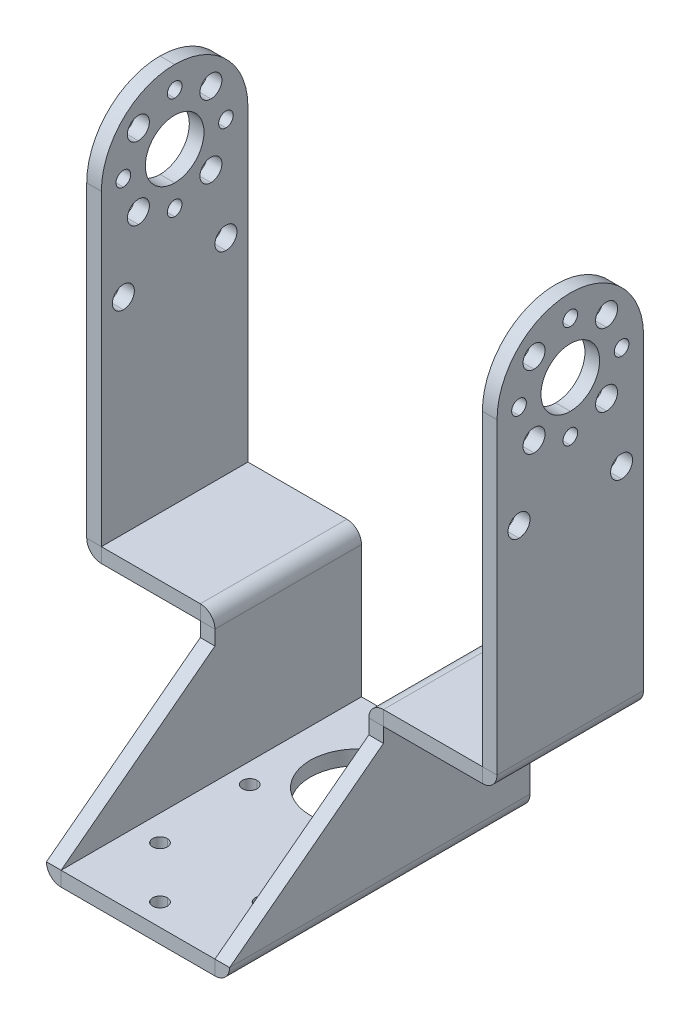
ISO-10303-21;
HEADER;
FILE_DESCRIPTION(('STEP AP214'),'2;1');
FILE_NAME('part.step','',(''),(''),'','','');
FILE_SCHEMA(('AUTOMOTIVE_DESIGN { 1 0 10303 214 1 1 1 1 }'));
ENDSEC;
DATA;
#1=APPLICATION_CONTEXT('core data for automotive mechanical design processes');
#2=APPLICATION_PROTOCOL_DEFINITION('international standard','automotive_design',2000,#1);
#3=PRODUCT_CONTEXT('',#1,'mechanical');
#4=PRODUCT('Part','Part','',(#3));
#5=PRODUCT_RELATED_PRODUCT_CATEGORY('part','',(#4));
#6=PRODUCT_DEFINITION_FORMATION('','',#4);
#7=PRODUCT_DEFINITION_CONTEXT('part definition',#1,'design');
#8=PRODUCT_DEFINITION('design','',#6,#7);
#9=PRODUCT_DEFINITION_SHAPE('','',#8);
#10=(LENGTH_UNIT() NAMED_UNIT(*) SI_UNIT(.MILLI.,.METRE.));
#11=(NAMED_UNIT(*) PLANE_ANGLE_UNIT() SI_UNIT($,.RADIAN.));
#12=(NAMED_UNIT(*) SI_UNIT($,.STERADIAN.) SOLID_ANGLE_UNIT());
#13=UNCERTAINTY_MEASURE_WITH_UNIT(LENGTH_MEASURE(1.E-05),#10,'distance_accuracy_value','');
#14=(GEOMETRIC_REPRESENTATION_CONTEXT(3) GLOBAL_UNCERTAINTY_ASSIGNED_CONTEXT((#13)) GLOBAL_UNIT_ASSIGNED_CONTEXT((#10,
#11,#12)) REPRESENTATION_CONTEXT('',''));
#15=CARTESIAN_POINT('',(0.,0.,0.));
#16=DIRECTION('',(0.,0.,1.));
#17=DIRECTION('',(1.,0.,0.));
#18=AXIS2_PLACEMENT_3D('',#15,#16,#17);
#19=CARTESIAN_POINT('',(-26.,62.,-10.));
#20=DIRECTION('',(1.,0.,0.));
#21=DIRECTION('',(0.,1.,0.));
#22=AXIS2_PLACEMENT_3D('',#19,#20,#21);
#23=CYLINDRICAL_SURFACE('',#22,4.);
#24=DIRECTION('',(-1.,0.,0.));
#25=VECTOR('',#24,1.);
#26=CARTESIAN_POINT('',(-26.,58.,-10.));
#27=LINE('',#26,#25);
#28=CARTESIAN_POINT('',(-26.,58.,-10.));
#29=VERTEX_POINT('',#28);
#30=CARTESIAN_POINT('',(-28.,58.,-10.));
#31=VERTEX_POINT('',#30);
#32=EDGE_CURVE('E11',#29,#31,#27,.T.);
#33=ORIENTED_EDGE('',*,*,#32,.F.);
#34=CARTESIAN_POINT('',(-26.,62.,-10.));
#35=DIRECTION('',(-1.,0.,0.));
#36=DIRECTION('',(0.,1.,0.));
#37=AXIS2_PLACEMENT_3D('',#34,#35,#36);
#38=CIRCLE('',#37,4.);
#39=CARTESIAN_POINT('',(-26.,66.,-10.));
#40=VERTEX_POINT('',#39);
#41=EDGE_CURVE('E1042',#40,#29,#38,.T.);
#42=ORIENTED_EDGE('',*,*,#41,.F.);
#43=DIRECTION('',(-1.,0.,0.));
#44=VECTOR('',#43,1.);
#45=CARTESIAN_POINT('',(-26.,66.,-10.));
#46=LINE('',#45,#44);
#47=CARTESIAN_POINT('',(-28.,66.,-10.));
#48=VERTEX_POINT('',#47);
#49=EDGE_CURVE('E28',#40,#48,#46,.T.);
#50=ORIENTED_EDGE('',*,*,#49,.T.);
#51=CARTESIAN_POINT('',(-28.,62.,-10.));
#52=DIRECTION('',(1.,0.,0.));
#53=DIRECTION('',(0.,-1.,0.));
#54=AXIS2_PLACEMENT_3D('',#51,#52,#53);
#55=CIRCLE('',#54,4.);
#56=EDGE_CURVE('E745',#31,#48,#55,.T.);
#57=ORIENTED_EDGE('',*,*,#56,.F.);
#58=EDGE_LOOP('',(#33,#42,#50,#57));
#59=FACE_BOUND('',#58,.T.);
#60=ADVANCED_FACE('F17',(#59),#23,.F.);
#61=CARTESIAN_POINT('',(-26.,62.,-10.));
#62=DIRECTION('',(1.,0.,0.));
#63=DIRECTION('',(0.,1.,0.));
#64=AXIS2_PLACEMENT_3D('',#61,#62,#63);
#65=CYLINDRICAL_SURFACE('',#64,4.);
#66=CARTESIAN_POINT('',(-28.,62.,-10.));
#67=DIRECTION('',(1.,0.,0.));
#68=DIRECTION('',(0.,1.,0.));
#69=AXIS2_PLACEMENT_3D('',#66,#67,#68);
#70=CIRCLE('',#69,4.);
#71=EDGE_CURVE('E749',#48,#31,#70,.T.);
#72=ORIENTED_EDGE('',*,*,#71,.F.);
#73=ORIENTED_EDGE('',*,*,#49,.F.);
#74=CARTESIAN_POINT('',(-26.,62.,-10.));
#75=DIRECTION('',(-1.,0.,0.));
#76=DIRECTION('',(0.,-1.,0.));
#77=AXIS2_PLACEMENT_3D('',#74,#75,#76);
#78=CIRCLE('',#77,4.);
#79=EDGE_CURVE('E1046',#29,#40,#78,.T.);
#80=ORIENTED_EDGE('',*,*,#79,.F.);
#81=ORIENTED_EDGE('',*,*,#32,.T.);
#82=EDGE_LOOP('',(#72,#73,#80,#81));
#83=FACE_BOUND('',#82,.T.);
#84=ADVANCED_FACE('F1694',(#83),#65,.F.);
#85=CARTESIAN_POINT('',(-26.,62.,-17.));
#86=DIRECTION('',(1.,0.,0.));
#87=DIRECTION('',(0.,1.,0.));
#88=AXIS2_PLACEMENT_3D('',#85,#86,#87);
#89=CYLINDRICAL_SURFACE('',#88,1.);
#90=DIRECTION('',(-1.,0.,0.));
#91=VECTOR('',#90,1.);
#92=CARTESIAN_POINT('',(-26.,61.,-17.));
#93=LINE('',#92,#91);
#94=CARTESIAN_POINT('',(-26.,61.,-17.));
#95=VERTEX_POINT('',#94);
#96=CARTESIAN_POINT('',(-28.,61.,-17.));
#97=VERTEX_POINT('',#96);
#98=EDGE_CURVE('E797',#95,#97,#93,.T.);
#99=ORIENTED_EDGE('',*,*,#98,.F.);
#100=CARTESIAN_POINT('',(-26.,62.,-17.));
#101=DIRECTION('',(-1.,0.,0.));
#102=DIRECTION('',(0.,1.,0.));
#103=AXIS2_PLACEMENT_3D('',#100,#101,#102);
#104=CIRCLE('',#103,1.);
#105=CARTESIAN_POINT('',(-26.,63.,-17.));
#106=VERTEX_POINT('',#105);
#107=EDGE_CURVE('E813',#106,#95,#104,.T.);
#108=ORIENTED_EDGE('',*,*,#107,.F.);
#109=DIRECTION('',(-1.,0.,0.));
#110=VECTOR('',#109,1.);
#111=CARTESIAN_POINT('',(-26.,63.,-17.));
#112=LINE('',#111,#110);
#113=CARTESIAN_POINT('',(-28.,63.,-17.));
#114=VERTEX_POINT('',#113);
#115=EDGE_CURVE('E984',#106,#114,#112,.T.);
#116=ORIENTED_EDGE('',*,*,#115,.T.);
#117=CARTESIAN_POINT('',(-28.,62.,-17.));
#118=DIRECTION('',(1.,0.,0.));
#119=DIRECTION('',(0.,-1.,0.));
#120=AXIS2_PLACEMENT_3D('',#117,#118,#119);
#121=CIRCLE('',#120,1.);
#122=EDGE_CURVE('E1088',#97,#114,#121,.T.);
#123=ORIENTED_EDGE('',*,*,#122,.F.);
#124=EDGE_LOOP('',(#99,#108,#116,#123));
#125=FACE_BOUND('',#124,.T.);
#126=ADVANCED_FACE('F1919',(#125),#89,.F.);
#127=CARTESIAN_POINT('',(-26.,62.,-17.));
#128=DIRECTION('',(1.,0.,0.));
#129=DIRECTION('',(0.,1.,0.));
#130=AXIS2_PLACEMENT_3D('',#127,#128,#129);
#131=CYLINDRICAL_SURFACE('',#130,1.);
#132=CARTESIAN_POINT('',(-28.,62.,-17.));
#133=DIRECTION('',(1.,0.,0.));
#134=DIRECTION('',(0.,1.,0.));
#135=AXIS2_PLACEMENT_3D('',#132,#133,#134);
#136=CIRCLE('',#135,1.);
#137=EDGE_CURVE('E750',#114,#97,#136,.T.);
#138=ORIENTED_EDGE('',*,*,#137,.F.);
#139=ORIENTED_EDGE('',*,*,#115,.F.);
#140=CARTESIAN_POINT('',(-26.,62.,-17.));
#141=DIRECTION('',(-1.,0.,0.));
#142=DIRECTION('',(0.,-1.,0.));
#143=AXIS2_PLACEMENT_3D('',#140,#141,#142);
#144=CIRCLE('',#143,1.);
#145=EDGE_CURVE('E1047',#95,#106,#144,.T.);
#146=ORIENTED_EDGE('',*,*,#145,.F.);
#147=ORIENTED_EDGE('',*,*,#98,.T.);
#148=EDGE_LOOP('',(#138,#139,#146,#147));
#149=FACE_BOUND('',#148,.T.);
#150=ADVANCED_FACE('F2078',(#149),#131,.F.);
#151=CARTESIAN_POINT('',(-26.,66.94974746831,-14.94974746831));
#152=DIRECTION('',(1.,0.,0.));
#153=DIRECTION('',(0.,1.,0.));
#154=AXIS2_PLACEMENT_3D('',#151,#152,#153);
#155=CYLINDRICAL_SURFACE('',#154,1.5);
#156=DIRECTION('',(-1.,0.,0.));
#157=VECTOR('',#156,1.);
#158=CARTESIAN_POINT('',(-26.,65.44974746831,-14.94974746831));
#159=LINE('',#158,#157);
#160=CARTESIAN_POINT('',(-26.,65.44974746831,-14.94974746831));
#161=VERTEX_POINT('',#160);
#162=CARTESIAN_POINT('',(-28.,65.44974746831,-14.94974746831));
#163=VERTEX_POINT('',#162);
#164=EDGE_CURVE('E982',#161,#163,#159,.T.);
#165=ORIENTED_EDGE('',*,*,#164,.F.);
#166=CARTESIAN_POINT('',(-26.,66.94974746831,-14.94974746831));
#167=DIRECTION('',(-1.,0.,0.));
#168=DIRECTION('',(0.,1.,0.));
#169=AXIS2_PLACEMENT_3D('',#166,#167,#168);
#170=CIRCLE('',#169,1.5);
#171=CARTESIAN_POINT('',(-26.,68.44974746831,-14.94974746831));
#172=VERTEX_POINT('',#171);
#173=EDGE_CURVE('E814',#172,#161,#170,.T.);
#174=ORIENTED_EDGE('',*,*,#173,.F.);
#175=DIRECTION('',(-1.,0.,0.));
#176=VECTOR('',#175,1.);
#177=CARTESIAN_POINT('',(-26.,68.44974746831,-14.94974746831));
#178=LINE('',#177,#176);
#179=CARTESIAN_POINT('',(-28.,68.44974746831,-14.94974746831));
#180=VERTEX_POINT('',#179);
#181=EDGE_CURVE('E770',#172,#180,#178,.T.);
#182=ORIENTED_EDGE('',*,*,#181,.T.);
#183=CARTESIAN_POINT('',(-28.,66.94974746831,-14.94974746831));
#184=DIRECTION('',(1.,0.,0.));
#185=DIRECTION('',(0.,-1.,0.));
#186=AXIS2_PLACEMENT_3D('',#183,#184,#185);
#187=CIRCLE('',#186,1.5);
#188=EDGE_CURVE('E1089',#163,#180,#187,.T.);
#189=ORIENTED_EDGE('',*,*,#188,.F.);
#190=EDGE_LOOP('',(#165,#174,#182,#189));
#191=FACE_BOUND('',#190,.T.);
#192=ADVANCED_FACE('F2045',(#191),#155,.F.);
#193=CARTESIAN_POINT('',(-26.,66.94974746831,-14.94974746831));
#194=DIRECTION('',(1.,0.,0.));
#195=DIRECTION('',(0.,1.,0.));
#196=AXIS2_PLACEMENT_3D('',#193,#194,#195);
#197=CYLINDRICAL_SURFACE('',#196,1.5);
#198=CARTESIAN_POINT('',(-28.,66.94974746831,-14.94974746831));
#199=DIRECTION('',(1.,0.,0.));
#200=DIRECTION('',(0.,1.,0.));
#201=AXIS2_PLACEMENT_3D('',#198,#199,#200);
#202=CIRCLE('',#201,1.5);
#203=EDGE_CURVE('E1084',#180,#163,#202,.T.);
#204=ORIENTED_EDGE('',*,*,#203,.F.);
#205=ORIENTED_EDGE('',*,*,#181,.F.);
#206=CARTESIAN_POINT('',(-26.,66.94974746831,-14.94974746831));
#207=DIRECTION('',(-1.,0.,0.));
#208=DIRECTION('',(0.,-1.,0.));
#209=AXIS2_PLACEMENT_3D('',#206,#207,#208);
#210=CIRCLE('',#209,1.5);
#211=EDGE_CURVE('E809',#161,#172,#210,.T.);
#212=ORIENTED_EDGE('',*,*,#211,.F.);
#213=ORIENTED_EDGE('',*,*,#164,.T.);
#214=EDGE_LOOP('',(#204,#205,#212,#213));
#215=FACE_BOUND('',#214,.T.);
#216=ADVANCED_FACE('F2042',(#215),#197,.F.);
#217=CARTESIAN_POINT('',(-26.,55.,-10.));
#218=DIRECTION('',(1.,0.,0.));
#219=DIRECTION('',(0.,1.,0.));
#220=AXIS2_PLACEMENT_3D('',#217,#218,#219);
#221=CYLINDRICAL_SURFACE('',#220,1.);
#222=DIRECTION('',(-1.,0.,0.));
#223=VECTOR('',#222,1.);
#224=CARTESIAN_POINT('',(-26.,54.,-10.));
#225=LINE('',#224,#223);
#226=CARTESIAN_POINT('',(-26.,54.,-10.));
#227=VERTEX_POINT('',#226);
#228=CARTESIAN_POINT('',(-28.,54.,-10.));
#229=VERTEX_POINT('',#228);
#230=EDGE_CURVE('E767',#227,#229,#225,.T.);
#231=ORIENTED_EDGE('',*,*,#230,.F.);
#232=CARTESIAN_POINT('',(-26.,55.,-10.));
#233=DIRECTION('',(-1.,0.,0.));
#234=DIRECTION('',(0.,1.,0.));
#235=AXIS2_PLACEMENT_3D('',#232,#233,#234);
#236=CIRCLE('',#235,1.);
#237=CARTESIAN_POINT('',(-26.,56.,-10.));
#238=VERTEX_POINT('',#237);
#239=EDGE_CURVE('E778',#238,#227,#236,.T.);
#240=ORIENTED_EDGE('',*,*,#239,.F.);
#241=DIRECTION('',(-1.,0.,0.));
#242=VECTOR('',#241,1.);
#243=CARTESIAN_POINT('',(-26.,56.,-10.));
#244=LINE('',#243,#242);
#245=CARTESIAN_POINT('',(-28.,56.,-10.));
#246=VERTEX_POINT('',#245);
#247=EDGE_CURVE('E771',#238,#246,#244,.T.);
#248=ORIENTED_EDGE('',*,*,#247,.T.);
#249=CARTESIAN_POINT('',(-28.,55.,-10.));
#250=DIRECTION('',(1.,0.,0.));
#251=DIRECTION('',(0.,-1.,0.));
#252=AXIS2_PLACEMENT_3D('',#249,#250,#251);
#253=CIRCLE('',#252,1.);
#254=EDGE_CURVE('E1110',#229,#246,#253,.T.);
#255=ORIENTED_EDGE('',*,*,#254,.F.);
#256=EDGE_LOOP('',(#231,#240,#248,#255));
#257=FACE_BOUND('',#256,.T.);
#258=ADVANCED_FACE('F1940',(#257),#221,.F.);
#259=CARTESIAN_POINT('',(-26.,55.,-10.));
#260=DIRECTION('',(1.,0.,0.));
#261=DIRECTION('',(0.,1.,0.));
#262=AXIS2_PLACEMENT_3D('',#259,#260,#261);
#263=CYLINDRICAL_SURFACE('',#262,1.);
#264=CARTESIAN_POINT('',(-28.,55.,-10.));
#265=DIRECTION('',(1.,0.,0.));
#266=DIRECTION('',(0.,1.,0.));
#267=AXIS2_PLACEMENT_3D('',#264,#265,#266);
#268=CIRCLE('',#267,1.);
#269=EDGE_CURVE('E1343',#246,#229,#268,.T.);
#270=ORIENTED_EDGE('',*,*,#269,.F.);
#271=ORIENTED_EDGE('',*,*,#247,.F.);
#272=CARTESIAN_POINT('',(-26.,55.,-10.));
#273=DIRECTION('',(-1.,0.,0.));
#274=DIRECTION('',(0.,-1.,0.));
#275=AXIS2_PLACEMENT_3D('',#272,#273,#274);
#276=CIRCLE('',#275,1.);
#277=EDGE_CURVE('E782',#227,#238,#276,.T.);
#278=ORIENTED_EDGE('',*,*,#277,.F.);
#279=ORIENTED_EDGE('',*,*,#230,.T.);
#280=EDGE_LOOP('',(#270,#271,#278,#279));
#281=FACE_BOUND('',#280,.T.);
#282=ADVANCED_FACE('F1936',(#281),#263,.F.);
#283=CARTESIAN_POINT('',(-26.,62.,-3.));
#284=DIRECTION('',(1.,0.,0.));
#285=DIRECTION('',(0.,1.,0.));
#286=AXIS2_PLACEMENT_3D('',#283,#284,#285);
#287=CYLINDRICAL_SURFACE('',#286,1.);
#288=DIRECTION('',(-1.,0.,0.));
#289=VECTOR('',#288,1.);
#290=CARTESIAN_POINT('',(-26.,61.,-3.));
#291=LINE('',#290,#289);
#292=CARTESIAN_POINT('',(-26.,61.,-3.));
#293=VERTEX_POINT('',#292);
#294=CARTESIAN_POINT('',(-28.,61.,-3.));
#295=VERTEX_POINT('',#294);
#296=EDGE_CURVE('E898',#293,#295,#291,.T.);
#297=ORIENTED_EDGE('',*,*,#296,.F.);
#298=CARTESIAN_POINT('',(-26.,62.,-3.));
#299=DIRECTION('',(-1.,0.,0.));
#300=DIRECTION('',(0.,1.,0.));
#301=AXIS2_PLACEMENT_3D('',#298,#299,#300);
#302=CIRCLE('',#301,1.);
#303=CARTESIAN_POINT('',(-26.,63.,-3.));
#304=VERTEX_POINT('',#303);
#305=EDGE_CURVE('E845',#304,#293,#302,.T.);
#306=ORIENTED_EDGE('',*,*,#305,.F.);
#307=DIRECTION('',(-1.,0.,0.));
#308=VECTOR('',#307,1.);
#309=CARTESIAN_POINT('',(-26.,63.,-3.));
#310=LINE('',#309,#308);
#311=CARTESIAN_POINT('',(-28.,63.,-3.));
#312=VERTEX_POINT('',#311);
#313=EDGE_CURVE('E1007',#304,#312,#310,.T.);
#314=ORIENTED_EDGE('',*,*,#313,.T.);
#315=CARTESIAN_POINT('',(-28.,62.,-3.));
#316=DIRECTION('',(1.,0.,0.));
#317=DIRECTION('',(0.,-1.,0.));
#318=AXIS2_PLACEMENT_3D('',#315,#316,#317);
#319=CIRCLE('',#318,1.);
#320=EDGE_CURVE('E1111',#295,#312,#319,.T.);
#321=ORIENTED_EDGE('',*,*,#320,.F.);
#322=EDGE_LOOP('',(#297,#306,#314,#321));
#323=FACE_BOUND('',#322,.T.);
#324=ADVANCED_FACE('F1939',(#323),#287,.F.);
#325=CARTESIAN_POINT('',(-26.,62.,-3.));
#326=DIRECTION('',(1.,0.,0.));
#327=DIRECTION('',(0.,1.,0.));
#328=AXIS2_PLACEMENT_3D('',#325,#326,#327);
#329=CYLINDRICAL_SURFACE('',#328,1.);
#330=CARTESIAN_POINT('',(-28.,62.,-3.));
#331=DIRECTION('',(1.,0.,0.));
#332=DIRECTION('',(0.,1.,0.));
#333=AXIS2_PLACEMENT_3D('',#330,#331,#332);
#334=CIRCLE('',#333,1.);
#335=EDGE_CURVE('E1106',#312,#295,#334,.T.);
#336=ORIENTED_EDGE('',*,*,#335,.F.);
#337=ORIENTED_EDGE('',*,*,#313,.F.);
#338=CARTESIAN_POINT('',(-26.,62.,-3.));
#339=DIRECTION('',(-1.,0.,0.));
#340=DIRECTION('',(0.,-1.,0.));
#341=AXIS2_PLACEMENT_3D('',#338,#339,#340);
#342=CIRCLE('',#341,1.);
#343=EDGE_CURVE('E783',#293,#304,#342,.T.);
#344=ORIENTED_EDGE('',*,*,#343,.F.);
#345=ORIENTED_EDGE('',*,*,#296,.T.);
#346=EDGE_LOOP('',(#336,#337,#344,#345));
#347=FACE_BOUND('',#346,.T.);
#348=ADVANCED_FACE('F1975',(#347),#329,.F.);
#349=CARTESIAN_POINT('',(-26.,69.,-10.));
#350=DIRECTION('',(1.,0.,0.));
#351=DIRECTION('',(0.,1.,0.));
#352=AXIS2_PLACEMENT_3D('',#349,#350,#351);
#353=CYLINDRICAL_SURFACE('',#352,1.);
#354=DIRECTION('',(-1.,0.,0.));
#355=VECTOR('',#354,1.);
#356=CARTESIAN_POINT('',(-26.,68.,-10.));
#357=LINE('',#356,#355);
#358=CARTESIAN_POINT('',(-26.,68.,-10.));
#359=VERTEX_POINT('',#358);
#360=CARTESIAN_POINT('',(-28.,68.,-10.));
#361=VERTEX_POINT('',#360);
#362=EDGE_CURVE('E1010',#359,#361,#357,.T.);
#363=ORIENTED_EDGE('',*,*,#362,.F.);
#364=CARTESIAN_POINT('',(-26.,69.,-10.));
#365=DIRECTION('',(-1.,0.,0.));
#366=DIRECTION('',(0.,1.,0.));
#367=AXIS2_PLACEMENT_3D('',#364,#365,#366);
#368=CIRCLE('',#367,1.);
#369=CARTESIAN_POINT('',(-26.,70.,-10.));
#370=VERTEX_POINT('',#369);
#371=EDGE_CURVE('E1093',#370,#359,#368,.T.);
#372=ORIENTED_EDGE('',*,*,#371,.F.);
#373=DIRECTION('',(-1.,0.,0.));
#374=VECTOR('',#373,1.);
#375=CARTESIAN_POINT('',(-26.,70.,-10.));
#376=LINE('',#375,#374);
#377=CARTESIAN_POINT('',(-28.,70.,-10.));
#378=VERTEX_POINT('',#377);
#379=EDGE_CURVE('E807',#370,#378,#376,.T.);
#380=ORIENTED_EDGE('',*,*,#379,.T.);
#381=CARTESIAN_POINT('',(-28.,69.,-10.));
#382=DIRECTION('',(1.,0.,0.));
#383=DIRECTION('',(0.,-1.,0.));
#384=AXIS2_PLACEMENT_3D('',#381,#382,#383);
#385=CIRCLE('',#384,1.);
#386=EDGE_CURVE('E820',#361,#378,#385,.T.);
#387=ORIENTED_EDGE('',*,*,#386,.F.);
#388=EDGE_LOOP('',(#363,#372,#380,#387));
#389=FACE_BOUND('',#388,.T.);
#390=ADVANCED_FACE('F1971',(#389),#353,.F.);
#391=CARTESIAN_POINT('',(-26.,69.,-10.));
#392=DIRECTION('',(1.,0.,0.));
#393=DIRECTION('',(0.,1.,0.));
#394=AXIS2_PLACEMENT_3D('',#391,#392,#393);
#395=CYLINDRICAL_SURFACE('',#394,1.);
#396=CARTESIAN_POINT('',(-28.,69.,-10.));
#397=DIRECTION('',(1.,0.,0.));
#398=DIRECTION('',(0.,1.,0.));
#399=AXIS2_PLACEMENT_3D('',#396,#397,#398);
#400=CIRCLE('',#399,1.);
#401=EDGE_CURVE('E824',#378,#361,#400,.T.);
#402=ORIENTED_EDGE('',*,*,#401,.F.);
#403=ORIENTED_EDGE('',*,*,#379,.F.);
#404=CARTESIAN_POINT('',(-26.,69.,-10.));
#405=DIRECTION('',(-1.,0.,0.));
#406=DIRECTION('',(0.,-1.,0.));
#407=AXIS2_PLACEMENT_3D('',#404,#405,#406);
#408=CIRCLE('',#407,1.);
#409=EDGE_CURVE('E849',#359,#370,#408,.T.);
#410=ORIENTED_EDGE('',*,*,#409,.F.);
#411=ORIENTED_EDGE('',*,*,#362,.T.);
#412=EDGE_LOOP('',(#402,#403,#410,#411));
#413=FACE_BOUND('',#412,.T.);
#414=ADVANCED_FACE('F1974',(#413),#395,.F.);
#415=CARTESIAN_POINT('',(-26.,48.,-17.));
#416=DIRECTION('',(1.,0.,0.));
#417=DIRECTION('',(0.,1.,0.));
#418=AXIS2_PLACEMENT_3D('',#415,#416,#417);
#419=CYLINDRICAL_SURFACE('',#418,1.5);
#420=DIRECTION('',(-1.,0.,0.));
#421=VECTOR('',#420,1.);
#422=CARTESIAN_POINT('',(-26.,46.5,-17.));
#423=LINE('',#422,#421);
#424=CARTESIAN_POINT('',(-26.,46.5,-17.));
#425=VERTEX_POINT('',#424);
#426=CARTESIAN_POINT('',(-28.,46.5,-17.));
#427=VERTEX_POINT('',#426);
#428=EDGE_CURVE('E804',#425,#427,#423,.T.);
#429=ORIENTED_EDGE('',*,*,#428,.F.);
#430=CARTESIAN_POINT('',(-26.,48.,-17.));
#431=DIRECTION('',(-1.,0.,0.));
#432=DIRECTION('',(0.,1.,0.));
#433=AXIS2_PLACEMENT_3D('',#430,#431,#432);
#434=CIRCLE('',#433,1.5);
#435=CARTESIAN_POINT('',(-26.,49.5,-17.));
#436=VERTEX_POINT('',#435);
#437=EDGE_CURVE('E1068',#436,#425,#434,.T.);
#438=ORIENTED_EDGE('',*,*,#437,.F.);
#439=DIRECTION('',(-1.,0.,0.));
#440=VECTOR('',#439,1.);
#441=CARTESIAN_POINT('',(-26.,49.5,-17.));
#442=LINE('',#441,#440);
#443=CARTESIAN_POINT('',(-28.,49.5,-17.));
#444=VERTEX_POINT('',#443);
#445=EDGE_CURVE('E808',#436,#444,#442,.T.);
#446=ORIENTED_EDGE('',*,*,#445,.T.);
#447=CARTESIAN_POINT('',(-28.,48.,-17.));
#448=DIRECTION('',(1.,0.,0.));
#449=DIRECTION('',(0.,-1.,0.));
#450=AXIS2_PLACEMENT_3D('',#447,#448,#449);
#451=CIRCLE('',#450,1.5);
#452=EDGE_CURVE('E1361',#427,#444,#451,.T.);
#453=ORIENTED_EDGE('',*,*,#452,.F.);
#454=EDGE_LOOP('',(#429,#438,#446,#453));
#455=FACE_BOUND('',#454,.T.);
#456=ADVANCED_FACE('F2112',(#455),#419,.F.);
#457=CARTESIAN_POINT('',(-26.,48.,-17.));
#458=DIRECTION('',(1.,0.,0.));
#459=DIRECTION('',(0.,1.,0.));
#460=AXIS2_PLACEMENT_3D('',#457,#458,#459);
#461=CYLINDRICAL_SURFACE('',#460,1.5);
#462=CARTESIAN_POINT('',(-28.,48.,-17.));
#463=DIRECTION('',(1.,0.,0.));
#464=DIRECTION('',(0.,1.,0.));
#465=AXIS2_PLACEMENT_3D('',#462,#463,#464);
#466=CIRCLE('',#465,1.5);
#467=EDGE_CURVE('E825',#444,#427,#466,.T.);
#468=ORIENTED_EDGE('',*,*,#467,.F.);
#469=ORIENTED_EDGE('',*,*,#445,.F.);
#470=CARTESIAN_POINT('',(-26.,48.,-17.));
#471=DIRECTION('',(-1.,0.,0.));
#472=DIRECTION('',(0.,-1.,0.));
#473=AXIS2_PLACEMENT_3D('',#470,#471,#472);
#474=CIRCLE('',#473,1.5);
#475=EDGE_CURVE('E1442',#425,#436,#474,.T.);
#476=ORIENTED_EDGE('',*,*,#475,.F.);
#477=ORIENTED_EDGE('',*,*,#428,.T.);
#478=EDGE_LOOP('',(#468,#469,#476,#477));
#479=FACE_BOUND('',#478,.T.);
#480=ADVANCED_FACE('F2102',(#479),#461,.F.);
#481=CARTESIAN_POINT('',(-26.,48.,-3.));
#482=DIRECTION('',(1.,0.,0.));
#483=DIRECTION('',(0.,1.,0.));
#484=AXIS2_PLACEMENT_3D('',#481,#482,#483);
#485=CYLINDRICAL_SURFACE('',#484,1.5);
#486=DIRECTION('',(-1.,0.,0.));
#487=VECTOR('',#486,1.);
#488=CARTESIAN_POINT('',(-26.,46.5,-3.));
#489=LINE('',#488,#487);
#490=CARTESIAN_POINT('',(-26.,46.5,-3.));
#491=VERTEX_POINT('',#490);
#492=CARTESIAN_POINT('',(-28.,46.5,-3.));
#493=VERTEX_POINT('',#492);
#494=EDGE_CURVE('E818',#491,#493,#489,.T.);
#495=ORIENTED_EDGE('',*,*,#494,.F.);
#496=CARTESIAN_POINT('',(-26.,48.,-3.));
#497=DIRECTION('',(-1.,0.,0.));
#498=DIRECTION('',(0.,1.,0.));
#499=AXIS2_PLACEMENT_3D('',#496,#497,#498);
#500=CIRCLE('',#499,1.5);
#501=CARTESIAN_POINT('',(-26.,49.5,-3.));
#502=VERTEX_POINT('',#501);
#503=EDGE_CURVE('E1069',#502,#491,#500,.T.);
#504=ORIENTED_EDGE('',*,*,#503,.F.);
#505=DIRECTION('',(-1.,0.,0.));
#506=VECTOR('',#505,1.);
#507=CARTESIAN_POINT('',(-26.,49.5,-3.));
#508=LINE('',#507,#506);
#509=CARTESIAN_POINT('',(-28.,49.5,-3.));
#510=VERTEX_POINT('',#509);
#511=EDGE_CURVE('E815',#502,#510,#508,.T.);
#512=ORIENTED_EDGE('',*,*,#511,.T.);
#513=CARTESIAN_POINT('',(-28.,48.,-3.));
#514=DIRECTION('',(1.,0.,0.));
#515=DIRECTION('',(0.,-1.,0.));
#516=AXIS2_PLACEMENT_3D('',#513,#514,#515);
#517=CIRCLE('',#516,1.5);
#518=EDGE_CURVE('E1362',#493,#510,#517,.T.);
#519=ORIENTED_EDGE('',*,*,#518,.F.);
#520=EDGE_LOOP('',(#495,#504,#512,#519));
#521=FACE_BOUND('',#520,.T.);
#522=ADVANCED_FACE('F2099',(#521),#485,.F.);
#523=CARTESIAN_POINT('',(-26.,48.,-3.));
#524=DIRECTION('',(1.,0.,0.));
#525=DIRECTION('',(0.,1.,0.));
#526=AXIS2_PLACEMENT_3D('',#523,#524,#525);
#527=CYLINDRICAL_SURFACE('',#526,1.5);
#528=CARTESIAN_POINT('',(-28.,48.,-3.));
#529=DIRECTION('',(1.,0.,0.));
#530=DIRECTION('',(0.,1.,0.));
#531=AXIS2_PLACEMENT_3D('',#528,#529,#530);
#532=CIRCLE('',#531,1.5);
#533=EDGE_CURVE('E1357',#510,#493,#532,.T.);
#534=ORIENTED_EDGE('',*,*,#533,.F.);
#535=ORIENTED_EDGE('',*,*,#511,.F.);
#536=CARTESIAN_POINT('',(-26.,48.,-3.));
#537=DIRECTION('',(-1.,0.,0.));
#538=DIRECTION('',(0.,-1.,0.));
#539=AXIS2_PLACEMENT_3D('',#536,#537,#538);
#540=CIRCLE('',#539,1.5);
#541=EDGE_CURVE('E1064',#491,#502,#540,.T.);
#542=ORIENTED_EDGE('',*,*,#541,.F.);
#543=ORIENTED_EDGE('',*,*,#494,.T.);
#544=EDGE_LOOP('',(#534,#535,#542,#543));
#545=FACE_BOUND('',#544,.T.);
#546=ADVANCED_FACE('F2101',(#545),#527,.F.);
#547=CARTESIAN_POINT('',(-26.,57.05025253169,-5.050252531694));
#548=DIRECTION('',(1.,0.,0.));
#549=DIRECTION('',(0.,1.,0.));
#550=AXIS2_PLACEMENT_3D('',#547,#548,#549);
#551=CYLINDRICAL_SURFACE('',#550,1.5);
#552=DIRECTION('',(-1.,0.,0.));
#553=VECTOR('',#552,1.);
#554=CARTESIAN_POINT('',(-26.,55.55025253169,-5.050252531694));
#555=LINE('',#554,#553);
#556=CARTESIAN_POINT('',(-26.,55.55025253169,-5.050252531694));
#557=VERTEX_POINT('',#556);
#558=CARTESIAN_POINT('',(-28.,55.55025253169,-5.050252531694));
#559=VERTEX_POINT('',#558);
#560=EDGE_CURVE('E819',#557,#559,#555,.T.);
#561=ORIENTED_EDGE('',*,*,#560,.F.);
#562=CARTESIAN_POINT('',(-26.,57.05025253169,-5.050252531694));
#563=DIRECTION('',(-1.,0.,0.));
#564=DIRECTION('',(0.,1.,0.));
#565=AXIS2_PLACEMENT_3D('',#562,#563,#564);
#566=CIRCLE('',#565,1.5);
#567=CARTESIAN_POINT('',(-26.,58.55025253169,-5.050252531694));
#568=VERTEX_POINT('',#567);
#569=EDGE_CURVE('E1429',#568,#557,#566,.T.);
#570=ORIENTED_EDGE('',*,*,#569,.F.);
#571=DIRECTION('',(-1.,0.,0.));
#572=VECTOR('',#571,1.);
#573=CARTESIAN_POINT('',(-26.,58.55025253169,-5.050252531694));
#574=LINE('',#573,#572);
#575=CARTESIAN_POINT('',(-28.,58.55025253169,-5.050252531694));
#576=VERTEX_POINT('',#575);
#577=EDGE_CURVE('E908',#568,#576,#574,.T.);
#578=ORIENTED_EDGE('',*,*,#577,.T.);
#579=CARTESIAN_POINT('',(-28.,57.05025253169,-5.050252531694));
#580=DIRECTION('',(1.,0.,0.));
#581=DIRECTION('',(0.,-1.,0.));
#582=AXIS2_PLACEMENT_3D('',#579,#580,#581);
#583=CIRCLE('',#582,1.5);
#584=EDGE_CURVE('E1123',#559,#576,#583,.T.);
#585=ORIENTED_EDGE('',*,*,#584,.F.);
#586=EDGE_LOOP('',(#561,#570,#578,#585));
#587=FACE_BOUND('',#586,.T.);
#588=ADVANCED_FACE('F1923',(#587),#551,.F.);
#589=CARTESIAN_POINT('',(-26.,57.05025253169,-5.050252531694));
#590=DIRECTION('',(1.,0.,0.));
#591=DIRECTION('',(0.,1.,0.));
#592=AXIS2_PLACEMENT_3D('',#589,#590,#591);
#593=CYLINDRICAL_SURFACE('',#592,1.5);
#594=CARTESIAN_POINT('',(-28.,57.05025253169,-5.050252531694));
#595=DIRECTION('',(1.,0.,0.));
#596=DIRECTION('',(0.,1.,0.));
#597=AXIS2_PLACEMENT_3D('',#594,#595,#596);
#598=CIRCLE('',#597,1.5);
#599=EDGE_CURVE('E1127',#576,#559,#598,.T.);
#600=ORIENTED_EDGE('',*,*,#599,.F.);
#601=ORIENTED_EDGE('',*,*,#577,.F.);
#602=CARTESIAN_POINT('',(-26.,57.05025253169,-5.050252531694));
#603=DIRECTION('',(-1.,0.,0.));
#604=DIRECTION('',(0.,-1.,0.));
#605=AXIS2_PLACEMENT_3D('',#602,#603,#604);
#606=CIRCLE('',#605,1.5);
#607=EDGE_CURVE('E1174',#557,#568,#606,.T.);
#608=ORIENTED_EDGE('',*,*,#607,.F.);
#609=ORIENTED_EDGE('',*,*,#560,.T.);
#610=EDGE_LOOP('',(#600,#601,#608,#609));
#611=FACE_BOUND('',#610,.T.);
#612=ADVANCED_FACE('F2189',(#611),#593,.F.);
#613=CARTESIAN_POINT('',(-26.,57.05025253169,-14.94974746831));
#614=DIRECTION('',(1.,0.,0.));
#615=DIRECTION('',(0.,1.,0.));
#616=AXIS2_PLACEMENT_3D('',#613,#614,#615);
#617=CYLINDRICAL_SURFACE('',#616,1.5);
#618=DIRECTION('',(-1.,0.,0.));
#619=VECTOR('',#618,1.);
#620=CARTESIAN_POINT('',(-26.,55.55025253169,-14.94974746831));
#621=LINE('',#620,#619);
#622=CARTESIAN_POINT('',(-26.,55.55025253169,-14.94974746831));
#623=VERTEX_POINT('',#622);
#624=CARTESIAN_POINT('',(-28.,55.55025253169,-14.94974746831));
#625=VERTEX_POINT('',#624);
#626=EDGE_CURVE('E1474',#623,#625,#621,.T.);
#627=ORIENTED_EDGE('',*,*,#626,.F.);
#628=CARTESIAN_POINT('',(-26.,57.05025253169,-14.94974746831));
#629=DIRECTION('',(-1.,0.,0.));
#630=DIRECTION('',(0.,1.,0.));
#631=AXIS2_PLACEMENT_3D('',#628,#629,#630);
#632=CIRCLE('',#631,1.5);
#633=CARTESIAN_POINT('',(-26.,58.55025253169,-14.94974746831));
#634=VERTEX_POINT('',#633);
#635=EDGE_CURVE('E1405',#634,#623,#632,.T.);
#636=ORIENTED_EDGE('',*,*,#635,.F.);
#637=DIRECTION('',(-1.,0.,0.));
#638=VECTOR('',#637,1.);
#639=CARTESIAN_POINT('',(-26.,58.55025253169,-14.94974746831));
#640=LINE('',#639,#638);
#641=CARTESIAN_POINT('',(-28.,58.55025253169,-14.94974746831));
#642=VERTEX_POINT('',#641);
#643=EDGE_CURVE('E1477',#634,#642,#640,.T.);
#644=ORIENTED_EDGE('',*,*,#643,.T.);
#645=CARTESIAN_POINT('',(-28.,57.05025253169,-14.94974746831));
#646=DIRECTION('',(1.,0.,0.));
#647=DIRECTION('',(0.,-1.,0.));
#648=AXIS2_PLACEMENT_3D('',#645,#646,#647);
#649=CIRCLE('',#648,1.5);
#650=EDGE_CURVE('E990',#625,#642,#649,.T.);
#651=ORIENTED_EDGE('',*,*,#650,.F.);
#652=EDGE_LOOP('',(#627,#636,#644,#651));
#653=FACE_BOUND('',#652,.T.);
#654=ADVANCED_FACE('F1648',(#653),#617,.F.);
#655=CARTESIAN_POINT('',(-26.,57.05025253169,-14.94974746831));
#656=DIRECTION('',(1.,0.,0.));
#657=DIRECTION('',(0.,1.,0.));
#658=AXIS2_PLACEMENT_3D('',#655,#656,#657);
#659=CYLINDRICAL_SURFACE('',#658,1.5);
#660=CARTESIAN_POINT('',(-28.,57.05025253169,-14.94974746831));
#661=DIRECTION('',(1.,0.,0.));
#662=DIRECTION('',(0.,1.,0.));
#663=AXIS2_PLACEMENT_3D('',#660,#661,#662);
#664=CIRCLE('',#663,1.5);
#665=EDGE_CURVE('E994',#642,#625,#664,.T.);
#666=ORIENTED_EDGE('',*,*,#665,.F.);
#667=ORIENTED_EDGE('',*,*,#643,.F.);
#668=CARTESIAN_POINT('',(-26.,57.05025253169,-14.94974746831));
#669=DIRECTION('',(-1.,0.,0.));
#670=DIRECTION('',(0.,-1.,0.));
#671=AXIS2_PLACEMENT_3D('',#668,#669,#670);
#672=CIRCLE('',#671,1.5);
#673=EDGE_CURVE('E1409',#623,#634,#672,.T.);
#674=ORIENTED_EDGE('',*,*,#673,.F.);
#675=ORIENTED_EDGE('',*,*,#626,.T.);
#676=EDGE_LOOP('',(#666,#667,#674,#675));
#677=FACE_BOUND('',#676,.T.);
#678=ADVANCED_FACE('F1651',(#677),#659,.F.);
#679=CARTESIAN_POINT('',(-12.5,20.,0.));
#680=DIRECTION('',(0.,0.,-1.));
#681=DIRECTION('',(0.,-1.,0.));
#682=AXIS2_PLACEMENT_3D('',#679,#680,#681);
#683=PLANE('',#682);
#684=DIRECTION('',(0.,1.,0.));
#685=VECTOR('',#684,1.);
#686=CARTESIAN_POINT('',(-12.5,18.,0.));
#687=LINE('',#686,#685);
#688=CARTESIAN_POINT('',(-12.5,18.,0.));
#689=VERTEX_POINT('',#688);
#690=CARTESIAN_POINT('',(-12.5,20.,0.));
#691=VERTEX_POINT('',#690);
#692=EDGE_CURVE('E970',#689,#691,#687,.T.);
#693=ORIENTED_EDGE('',*,*,#692,.T.);
#694=DIRECTION('',(-1.,0.,0.));
#695=VECTOR('',#694,1.);
#696=CARTESIAN_POINT('',(-12.5,20.,0.));
#697=LINE('',#696,#695);
#698=CARTESIAN_POINT('',(-26.,20.,0.));
#699=VERTEX_POINT('',#698);
#700=EDGE_CURVE('E1259',#691,#699,#697,.T.);
#701=ORIENTED_EDGE('',*,*,#700,.T.);
#702=DIRECTION('',(0.,1.,0.));
#703=VECTOR('',#702,1.);
#704=CARTESIAN_POINT('',(-26.,18.,0.));
#705=LINE('',#704,#703);
#706=CARTESIAN_POINT('',(-26.,18.,0.));
#707=VERTEX_POINT('',#706);
#708=EDGE_CURVE('E1281',#707,#699,#705,.T.);
#709=ORIENTED_EDGE('',*,*,#708,.F.);
#710=DIRECTION('',(-1.,0.,0.));
#711=VECTOR('',#710,1.);
#712=CARTESIAN_POINT('',(-12.5,18.,0.));
#713=LINE('',#712,#711);
#714=EDGE_CURVE('E909',#689,#707,#713,.T.);
#715=ORIENTED_EDGE('',*,*,#714,.F.);
#716=EDGE_LOOP('',(#693,#701,#709,#715));
#717=FACE_BOUND('',#716,.T.);
#718=ADVANCED_FACE('F2056',(#717),#683,.F.);
#719=CARTESIAN_POINT('',(-7.,-2.,11.));
#720=DIRECTION('',(0.,1.,0.));
#721=DIRECTION('',(0.,0.,1.));
#722=AXIS2_PLACEMENT_3D('',#719,#720,#721);
#723=CYLINDRICAL_SURFACE('',#722,1.);
#724=DIRECTION('',(0.,-1.,0.));
#725=VECTOR('',#724,1.);
#726=CARTESIAN_POINT('',(-7.,0.,10.));
#727=LINE('',#726,#725);
#728=CARTESIAN_POINT('',(-7.,0.,10.));
#729=VERTEX_POINT('',#728);
#730=CARTESIAN_POINT('',(-7.,-2.,10.));
#731=VERTEX_POINT('',#730);
#732=EDGE_CURVE('E1375',#729,#731,#727,.T.);
#733=ORIENTED_EDGE('',*,*,#732,.F.);
#734=CARTESIAN_POINT('',(-7.,0.,11.));
#735=DIRECTION('',(0.,-1.,0.));
#736=DIRECTION('',(0.,0.,1.));
#737=AXIS2_PLACEMENT_3D('',#734,#735,#736);
#738=CIRCLE('',#737,1.);
#739=CARTESIAN_POINT('',(-7.,0.,12.));
#740=VERTEX_POINT('',#739);
#741=EDGE_CURVE('E1356',#740,#729,#738,.T.);
#742=ORIENTED_EDGE('',*,*,#741,.F.);
#743=DIRECTION('',(0.,-1.,0.));
#744=VECTOR('',#743,1.);
#745=CARTESIAN_POINT('',(-7.,0.,12.));
#746=LINE('',#745,#744);
#747=CARTESIAN_POINT('',(-7.,-2.,12.));
#748=VERTEX_POINT('',#747);
#749=EDGE_CURVE('E42',#740,#748,#746,.T.);
#750=ORIENTED_EDGE('',*,*,#749,.T.);
#751=CARTESIAN_POINT('',(-7.,-2.,11.));
#752=DIRECTION('',(0.,1.,0.));
#753=DIRECTION('',(0.,0.,-1.));
#754=AXIS2_PLACEMENT_3D('',#751,#752,#753);
#755=CIRCLE('',#754,1.);
#756=EDGE_CURVE('E927',#731,#748,#755,.T.);
#757=ORIENTED_EDGE('',*,*,#756,.F.);
#758=EDGE_LOOP('',(#733,#742,#750,#757));
#759=FACE_BOUND('',#758,.T.);
#760=ADVANCED_FACE('F1876',(#759),#723,.F.);
#761=CARTESIAN_POINT('',(-7.,-2.,11.));
#762=DIRECTION('',(0.,1.,0.));
#763=DIRECTION('',(0.,0.,1.));
#764=AXIS2_PLACEMENT_3D('',#761,#762,#763);
#765=CYLINDRICAL_SURFACE('',#764,1.);
#766=CARTESIAN_POINT('',(-7.,-2.,11.));
#767=DIRECTION('',(0.,1.,0.));
#768=DIRECTION('',(0.,0.,1.));
#769=AXIS2_PLACEMENT_3D('',#766,#767,#768);
#770=CIRCLE('',#769,1.);
#771=EDGE_CURVE('E697',#748,#731,#770,.T.);
#772=ORIENTED_EDGE('',*,*,#771,.F.);
#773=ORIENTED_EDGE('',*,*,#749,.F.);
#774=CARTESIAN_POINT('',(-7.,0.,11.));
#775=DIRECTION('',(0.,-1.,0.));
#776=DIRECTION('',(0.,0.,-1.));
#777=AXIS2_PLACEMENT_3D('',#774,#775,#776);
#778=CIRCLE('',#777,1.);
#779=EDGE_CURVE('E1351',#729,#740,#778,.T.);
#780=ORIENTED_EDGE('',*,*,#779,.F.);
#781=ORIENTED_EDGE('',*,*,#732,.T.);
#782=EDGE_LOOP('',(#772,#773,#780,#781));
#783=FACE_BOUND('',#782,.T.);
#784=ADVANCED_FACE('F1879',(#783),#765,.F.);
#785=CARTESIAN_POINT('',(0.,-2.,18.));
#786=DIRECTION('',(0.,1.,0.));
#787=DIRECTION('',(0.,0.,1.));
#788=AXIS2_PLACEMENT_3D('',#785,#786,#787);
#789=CYLINDRICAL_SURFACE('',#788,1.);
#790=DIRECTION('',(0.,-1.,0.));
#791=VECTOR('',#790,1.);
#792=CARTESIAN_POINT('',(0.,0.,17.));
#793=LINE('',#792,#791);
#794=CARTESIAN_POINT('',(0.,0.,17.));
#795=VERTEX_POINT('',#794);
#796=CARTESIAN_POINT('',(0.,-2.,17.));
#797=VERTEX_POINT('',#796);
#798=EDGE_CURVE('E1366',#795,#797,#793,.T.);
#799=ORIENTED_EDGE('',*,*,#798,.F.);
#800=CARTESIAN_POINT('',(0.,0.,18.));
#801=DIRECTION('',(0.,-1.,0.));
#802=DIRECTION('',(0.,0.,1.));
#803=AXIS2_PLACEMENT_3D('',#800,#801,#802);
#804=CIRCLE('',#803,1.);
#805=CARTESIAN_POINT('',(0.,0.,19.));
#806=VERTEX_POINT('',#805);
#807=EDGE_CURVE('E751',#806,#795,#804,.T.);
#808=ORIENTED_EDGE('',*,*,#807,.F.);
#809=DIRECTION('',(0.,-1.,0.));
#810=VECTOR('',#809,1.);
#811=CARTESIAN_POINT('',(0.,0.,19.));
#812=LINE('',#811,#810);
#813=CARTESIAN_POINT('',(0.,-2.,19.));
#814=VERTEX_POINT('',#813);
#815=EDGE_CURVE('E1053',#806,#814,#812,.T.);
#816=ORIENTED_EDGE('',*,*,#815,.T.);
#817=CARTESIAN_POINT('',(0.,-2.,18.));
#818=DIRECTION('',(0.,1.,0.));
#819=DIRECTION('',(0.,0.,-1.));
#820=AXIS2_PLACEMENT_3D('',#817,#818,#819);
#821=CIRCLE('',#820,1.);
#822=EDGE_CURVE('E1268',#797,#814,#821,.T.);
#823=ORIENTED_EDGE('',*,*,#822,.F.);
#824=EDGE_LOOP('',(#799,#808,#816,#823));
#825=FACE_BOUND('',#824,.T.);
#826=ADVANCED_FACE('F2129',(#825),#789,.F.);
#827=CARTESIAN_POINT('',(0.,-2.,18.));
#828=DIRECTION('',(0.,1.,0.));
#829=DIRECTION('',(0.,0.,1.));
#830=AXIS2_PLACEMENT_3D('',#827,#828,#829);
#831=CYLINDRICAL_SURFACE('',#830,1.);
#832=CARTESIAN_POINT('',(0.,-2.,18.));
#833=DIRECTION('',(0.,1.,0.));
#834=DIRECTION('',(0.,0.,1.));
#835=AXIS2_PLACEMENT_3D('',#832,#833,#834);
#836=CIRCLE('',#835,1.);
#837=EDGE_CURVE('E1272',#814,#797,#836,.T.);
#838=ORIENTED_EDGE('',*,*,#837,.F.);
#839=ORIENTED_EDGE('',*,*,#815,.F.);
#840=CARTESIAN_POINT('',(0.,0.,18.));
#841=DIRECTION('',(0.,-1.,0.));
#842=DIRECTION('',(0.,0.,-1.));
#843=AXIS2_PLACEMENT_3D('',#840,#841,#842);
#844=CIRCLE('',#843,1.);
#845=EDGE_CURVE('E755',#795,#806,#844,.T.);
#846=ORIENTED_EDGE('',*,*,#845,.F.);
#847=ORIENTED_EDGE('',*,*,#798,.T.);
#848=EDGE_LOOP('',(#838,#839,#846,#847));
#849=FACE_BOUND('',#848,.T.);
#850=ADVANCED_FACE('F2140',(#849),#831,.F.);
#851=CARTESIAN_POINT('',(7.,-2.,11.));
#852=DIRECTION('',(0.,1.,0.));
#853=DIRECTION('',(0.,0.,1.));
#854=AXIS2_PLACEMENT_3D('',#851,#852,#853);
#855=CYLINDRICAL_SURFACE('',#854,1.);
#856=DIRECTION('',(0.,-1.,0.));
#857=VECTOR('',#856,1.);
#858=CARTESIAN_POINT('',(7.,0.,10.));
#859=LINE('',#858,#857);
#860=CARTESIAN_POINT('',(7.,0.,10.));
#861=VERTEX_POINT('',#860);
#862=CARTESIAN_POINT('',(7.,-2.,10.));
#863=VERTEX_POINT('',#862);
#864=EDGE_CURVE('E1050',#861,#863,#859,.T.);
#865=ORIENTED_EDGE('',*,*,#864,.F.);
#866=CARTESIAN_POINT('',(7.,0.,11.));
#867=DIRECTION('',(0.,-1.,0.));
#868=DIRECTION('',(0.,0.,1.));
#869=AXIS2_PLACEMENT_3D('',#866,#867,#868);
#870=CIRCLE('',#869,1.);
#871=CARTESIAN_POINT('',(7.,0.,12.));
#872=VERTEX_POINT('',#871);
#873=EDGE_CURVE('E918',#872,#861,#870,.T.);
#874=ORIENTED_EDGE('',*,*,#873,.F.);
#875=DIRECTION('',(0.,-1.,0.));
#876=VECTOR('',#875,1.);
#877=CARTESIAN_POINT('',(7.,0.,12.));
#878=LINE('',#877,#876);
#879=CARTESIAN_POINT('',(7.,-2.,12.));
#880=VERTEX_POINT('',#879);
#881=EDGE_CURVE('E1054',#872,#880,#878,.T.);
#882=ORIENTED_EDGE('',*,*,#881,.T.);
#883=CARTESIAN_POINT('',(7.,-2.,11.));
#884=DIRECTION('',(0.,1.,0.));
#885=DIRECTION('',(0.,0.,-1.));
#886=AXIS2_PLACEMENT_3D('',#883,#884,#885);
#887=CIRCLE('',#886,1.);
#888=EDGE_CURVE('E1615',#863,#880,#887,.T.);
#889=ORIENTED_EDGE('',*,*,#888,.F.);
#890=EDGE_LOOP('',(#865,#874,#882,#889));
#891=FACE_BOUND('',#890,.T.);
#892=ADVANCED_FACE('F2073',(#891),#855,.F.);
#893=CARTESIAN_POINT('',(7.,-2.,11.));
#894=DIRECTION('',(0.,1.,0.));
#895=DIRECTION('',(0.,0.,1.));
#896=AXIS2_PLACEMENT_3D('',#893,#894,#895);
#897=CYLINDRICAL_SURFACE('',#896,1.);
#898=CARTESIAN_POINT('',(7.,-2.,11.));
#899=DIRECTION('',(0.,1.,0.));
#900=DIRECTION('',(0.,0.,1.));
#901=AXIS2_PLACEMENT_3D('',#898,#899,#900);
#902=CIRCLE('',#901,1.);
#903=EDGE_CURVE('E1273',#880,#863,#902,.T.);
#904=ORIENTED_EDGE('',*,*,#903,.F.);
#905=ORIENTED_EDGE('',*,*,#881,.F.);
#906=CARTESIAN_POINT('',(7.,0.,11.));
#907=DIRECTION('',(0.,-1.,0.));
#908=DIRECTION('',(0.,0.,-1.));
#909=AXIS2_PLACEMENT_3D('',#906,#907,#908);
#910=CIRCLE('',#909,1.);
#911=EDGE_CURVE('E756',#861,#872,#910,.T.);
#912=ORIENTED_EDGE('',*,*,#911,.F.);
#913=ORIENTED_EDGE('',*,*,#864,.T.);
#914=EDGE_LOOP('',(#904,#905,#912,#913));
#915=FACE_BOUND('',#914,.T.);
#916=ADVANCED_FACE('F2069',(#915),#897,.F.);
#917=CARTESIAN_POINT('',(0.,0.,-9.));
#918=DIRECTION('',(0.,-1.,0.));
#919=DIRECTION('',(0.,0.,-1.));
#920=AXIS2_PLACEMENT_3D('',#917,#918,#919);
#921=CYLINDRICAL_SURFACE('',#920,6.5);
#922=DIRECTION('',(0.,1.,0.));
#923=VECTOR('',#922,1.);
#924=CARTESIAN_POINT('',(0.,-2.,-2.5));
#925=LINE('',#924,#923);
#926=CARTESIAN_POINT('',(0.,-2.,-2.5));
#927=VERTEX_POINT('',#926);
#928=CARTESIAN_POINT('',(0.,0.,-2.5));
#929=VERTEX_POINT('',#928);
#930=EDGE_CURVE('E1183',#927,#929,#925,.T.);
#931=ORIENTED_EDGE('',*,*,#930,.F.);
#932=CARTESIAN_POINT('',(0.,-2.,-9.));
#933=DIRECTION('',(0.,1.,0.));
#934=DIRECTION('',(0.,0.,-1.));
#935=AXIS2_PLACEMENT_3D('',#932,#933,#934);
#936=CIRCLE('',#935,6.5);
#937=CARTESIAN_POINT('',(0.,-2.,-15.5));
#938=VERTEX_POINT('',#937);
#939=EDGE_CURVE('E1140',#938,#927,#936,.T.);
#940=ORIENTED_EDGE('',*,*,#939,.F.);
#941=DIRECTION('',(0.,1.,0.));
#942=VECTOR('',#941,1.);
#943=CARTESIAN_POINT('',(0.,-2.,-15.5));
#944=LINE('',#943,#942);
#945=CARTESIAN_POINT('',(0.,0.,-15.5));
#946=VERTEX_POINT('',#945);
#947=EDGE_CURVE('E1180',#938,#946,#944,.T.);
#948=ORIENTED_EDGE('',*,*,#947,.T.);
#949=CARTESIAN_POINT('',(0.,0.,-9.));
#950=DIRECTION('',(0.,-1.,0.));
#951=DIRECTION('',(0.,0.,1.));
#952=AXIS2_PLACEMENT_3D('',#949,#950,#951);
#953=CIRCLE('',#952,6.5);
#954=EDGE_CURVE('E1150',#929,#946,#953,.T.);
#955=ORIENTED_EDGE('',*,*,#954,.F.);
#956=EDGE_LOOP('',(#931,#940,#948,#955));
#957=FACE_BOUND('',#956,.T.);
#958=ADVANCED_FACE('F2072',(#957),#921,.F.);
#959=CARTESIAN_POINT('',(0.,0.,-9.));
#960=DIRECTION('',(0.,-1.,0.));
#961=DIRECTION('',(0.,0.,-1.));
#962=AXIS2_PLACEMENT_3D('',#959,#960,#961);
#963=CYLINDRICAL_SURFACE('',#962,6.5);
#964=CARTESIAN_POINT('',(0.,0.,-9.));
#965=DIRECTION('',(0.,-1.,0.));
#966=DIRECTION('',(0.,0.,-1.));
#967=AXIS2_PLACEMENT_3D('',#964,#965,#966);
#968=CIRCLE('',#967,6.5);
#969=EDGE_CURVE('E1078',#946,#929,#968,.T.);
#970=ORIENTED_EDGE('',*,*,#969,.F.);
#971=ORIENTED_EDGE('',*,*,#947,.F.);
#972=CARTESIAN_POINT('',(0.,-2.,-9.));
#973=DIRECTION('',(0.,1.,0.));
#974=DIRECTION('',(0.,0.,1.));
#975=AXIS2_PLACEMENT_3D('',#972,#973,#974);
#976=CIRCLE('',#975,6.5);
#977=EDGE_CURVE('E1144',#927,#938,#976,.T.);
#978=ORIENTED_EDGE('',*,*,#977,.F.);
#979=ORIENTED_EDGE('',*,*,#930,.T.);
#980=EDGE_LOOP('',(#970,#971,#978,#979));
#981=FACE_BOUND('',#980,.T.);
#982=ADVANCED_FACE('F2122',(#981),#963,.F.);
#983=CARTESIAN_POINT('',(-7.75,8.,-2.));
#984=DIRECTION('',(0.,-1.,0.));
#985=DIRECTION('',(0.,0.,-1.));
#986=AXIS2_PLACEMENT_3D('',#983,#984,#985);
#987=CYLINDRICAL_SURFACE('',#986,1.);
#988=DIRECTION('',(0.,1.,0.));
#989=VECTOR('',#988,1.);
#990=CARTESIAN_POINT('',(-7.75,-2.,-1.));
#991=LINE('',#990,#989);
#992=CARTESIAN_POINT('',(-7.75,-2.,-1.));
#993=VERTEX_POINT('',#992);
#994=CARTESIAN_POINT('',(-7.75,0.,-1.));
#995=VERTEX_POINT('',#994);
#996=EDGE_CURVE('E1184',#993,#995,#991,.T.);
#997=ORIENTED_EDGE('',*,*,#996,.F.);
#998=CARTESIAN_POINT('',(-7.75,-2.,-2.));
#999=DIRECTION('',(0.,1.,0.));
#1000=DIRECTION('',(0.,0.,-1.));
#1001=AXIS2_PLACEMENT_3D('',#998,#999,#1000);
#1002=CIRCLE('',#1001,1.);
#1003=CARTESIAN_POINT('',(-7.75,-2.,-3.));
#1004=VERTEX_POINT('',#1003);
#1005=EDGE_CURVE('E704',#1004,#993,#1002,.T.);
#1006=ORIENTED_EDGE('',*,*,#1005,.F.);
#1007=DIRECTION('',(0.,1.,0.));
#1008=VECTOR('',#1007,1.);
#1009=CARTESIAN_POINT('',(-7.75,-2.,-3.));
#1010=LINE('',#1009,#1008);
#1011=CARTESIAN_POINT('',(-7.75,0.,-3.));
#1012=VERTEX_POINT('',#1011);
#1013=EDGE_CURVE('E721',#1004,#1012,#1010,.T.);
#1014=ORIENTED_EDGE('',*,*,#1013,.T.);
#1015=CARTESIAN_POINT('',(-7.75,0.,-2.));
#1016=DIRECTION('',(0.,-1.,0.));
#1017=DIRECTION('',(0.,0.,1.));
#1018=AXIS2_PLACEMENT_3D('',#1015,#1016,#1017);
#1019=CIRCLE('',#1018,1.);
#1020=EDGE_CURVE('E1146',#995,#1012,#1019,.T.);
#1021=ORIENTED_EDGE('',*,*,#1020,.F.);
#1022=EDGE_LOOP('',(#997,#1006,#1014,#1021));
#1023=FACE_BOUND('',#1022,.T.);
#1024=ADVANCED_FACE('F1898',(#1023),#987,.F.);
#1025=CARTESIAN_POINT('',(-7.75,8.,-2.));
#1026=DIRECTION('',(0.,-1.,0.));
#1027=DIRECTION('',(0.,0.,-1.));
#1028=AXIS2_PLACEMENT_3D('',#1025,#1026,#1027);
#1029=CYLINDRICAL_SURFACE('',#1028,1.);
#1030=CARTESIAN_POINT('',(-7.75,0.,-2.));
#1031=DIRECTION('',(0.,-1.,0.));
#1032=DIRECTION('',(0.,0.,-1.));
#1033=AXIS2_PLACEMENT_3D('',#1030,#1031,#1032);
#1034=CIRCLE('',#1033,1.);
#1035=EDGE_CURVE('E1151',#1012,#995,#1034,.T.);
#1036=ORIENTED_EDGE('',*,*,#1035,.F.);
#1037=ORIENTED_EDGE('',*,*,#1013,.F.);
#1038=CARTESIAN_POINT('',(-7.75,-2.,-2.));
#1039=DIRECTION('',(0.,1.,0.));
#1040=DIRECTION('',(0.,0.,1.));
#1041=AXIS2_PLACEMENT_3D('',#1038,#1039,#1040);
#1042=CIRCLE('',#1041,1.);
#1043=EDGE_CURVE('E1145',#993,#1004,#1042,.T.);
#1044=ORIENTED_EDGE('',*,*,#1043,.F.);
#1045=ORIENTED_EDGE('',*,*,#996,.T.);
#1046=EDGE_LOOP('',(#1036,#1037,#1044,#1045));
#1047=FACE_BOUND('',#1046,.T.);
#1048=ADVANCED_FACE('F1894',(#1047),#1029,.F.);
#1049=CARTESIAN_POINT('',(7.75,8.,-2.));
#1050=DIRECTION('',(0.,-1.,0.));
#1051=DIRECTION('',(0.,0.,-1.));
#1052=AXIS2_PLACEMENT_3D('',#1049,#1050,#1051);
#1053=CYLINDRICAL_SURFACE('',#1052,1.);
#1054=DIRECTION('',(0.,1.,0.));
#1055=VECTOR('',#1054,1.);
#1056=CARTESIAN_POINT('',(7.75,-2.,-1.));
#1057=LINE('',#1056,#1055);
#1058=CARTESIAN_POINT('',(7.75,-2.,-1.));
#1059=VERTEX_POINT('',#1058);
#1060=CARTESIAN_POINT('',(7.75,0.,-1.));
#1061=VERTEX_POINT('',#1060);
#1062=EDGE_CURVE('E696',#1059,#1061,#1057,.T.);
#1063=ORIENTED_EDGE('',*,*,#1062,.F.);
#1064=CARTESIAN_POINT('',(7.75,-2.,-2.));
#1065=DIRECTION('',(0.,1.,0.));
#1066=DIRECTION('',(0.,0.,-1.));
#1067=AXIS2_PLACEMENT_3D('',#1064,#1065,#1066);
#1068=CIRCLE('',#1067,1.);
#1069=CARTESIAN_POINT('',(7.75,-2.,-3.));
#1070=VERTEX_POINT('',#1069);
#1071=EDGE_CURVE('E702',#1070,#1059,#1068,.T.);
#1072=ORIENTED_EDGE('',*,*,#1071,.F.);
#1073=DIRECTION('',(0.,1.,0.));
#1074=VECTOR('',#1073,1.);
#1075=CARTESIAN_POINT('',(7.75,-2.,-3.));
#1076=LINE('',#1075,#1074);
#1077=CARTESIAN_POINT('',(7.75,0.,-3.));
#1078=VERTEX_POINT('',#1077);
#1079=EDGE_CURVE('E684',#1070,#1078,#1076,.T.);
#1080=ORIENTED_EDGE('',*,*,#1079,.T.);
#1081=CARTESIAN_POINT('',(7.75,0.,-2.));
#1082=DIRECTION('',(0.,-1.,0.));
#1083=DIRECTION('',(0.,0.,1.));
#1084=AXIS2_PLACEMENT_3D('',#1081,#1082,#1083);
#1085=CIRCLE('',#1084,1.);
#1086=EDGE_CURVE('E792',#1061,#1078,#1085,.T.);
#1087=ORIENTED_EDGE('',*,*,#1086,.F.);
#1088=EDGE_LOOP('',(#1063,#1072,#1080,#1087));
#1089=FACE_BOUND('',#1088,.T.);
#1090=ADVANCED_FACE('F706',(#1089),#1053,.F.);
#1091=CARTESIAN_POINT('',(7.75,8.,-2.));
#1092=DIRECTION('',(0.,-1.,0.));
#1093=DIRECTION('',(0.,0.,-1.));
#1094=AXIS2_PLACEMENT_3D('',#1091,#1092,#1093);
#1095=CYLINDRICAL_SURFACE('',#1094,1.);
#1096=CARTESIAN_POINT('',(7.75,0.,-2.));
#1097=DIRECTION('',(0.,-1.,0.));
#1098=DIRECTION('',(0.,0.,-1.));
#1099=AXIS2_PLACEMENT_3D('',#1096,#1097,#1098);
#1100=CIRCLE('',#1099,1.);
#1101=EDGE_CURVE('E690',#1078,#1061,#1100,.T.);
#1102=ORIENTED_EDGE('',*,*,#1101,.F.);
#1103=ORIENTED_EDGE('',*,*,#1079,.F.);
#1104=CARTESIAN_POINT('',(7.75,-2.,-2.));
#1105=DIRECTION('',(0.,1.,0.));
#1106=DIRECTION('',(0.,0.,1.));
#1107=AXIS2_PLACEMENT_3D('',#1104,#1105,#1106);
#1108=CIRCLE('',#1107,1.);
#1109=EDGE_CURVE('E687',#1059,#1070,#1108,.T.);
#1110=ORIENTED_EDGE('',*,*,#1109,.F.);
#1111=ORIENTED_EDGE('',*,*,#1062,.T.);
#1112=EDGE_LOOP('',(#1102,#1103,#1110,#1111));
#1113=FACE_BOUND('',#1112,.T.);
#1114=ADVANCED_FACE('F686',(#1113),#1095,.F.);
#1115=CARTESIAN_POINT('',(0.,-2.,0.));
#1116=DIRECTION('',(0.,1.,0.));
#1117=DIRECTION('',(1.,0.,0.));
#1118=AXIS2_PLACEMENT_3D('',#1115,#1116,#1117);
#1119=PLANE('',#1118);
#1120=ORIENTED_EDGE('',*,*,#756,.T.);
#1121=ORIENTED_EDGE('',*,*,#771,.T.);
#1122=EDGE_LOOP('',(#1120,#1121));
#1123=FACE_BOUND('',#1122,.T.);
#1124=ORIENTED_EDGE('',*,*,#822,.T.);
#1125=ORIENTED_EDGE('',*,*,#837,.T.);
#1126=EDGE_LOOP('',(#1124,#1125));
#1127=FACE_BOUND('',#1126,.T.);
#1128=ORIENTED_EDGE('',*,*,#888,.T.);
#1129=ORIENTED_EDGE('',*,*,#903,.T.);
#1130=EDGE_LOOP('',(#1128,#1129));
#1131=FACE_BOUND('',#1130,.T.);
#1132=ORIENTED_EDGE('',*,*,#939,.T.);
#1133=ORIENTED_EDGE('',*,*,#977,.T.);
#1134=EDGE_LOOP('',(#1132,#1133));
#1135=FACE_BOUND('',#1134,.T.);
#1136=ORIENTED_EDGE('',*,*,#1005,.T.);
#1137=ORIENTED_EDGE('',*,*,#1043,.T.);
#1138=EDGE_LOOP('',(#1136,#1137));
#1139=FACE_BOUND('',#1138,.T.);
#1140=ORIENTED_EDGE('',*,*,#1071,.T.);
#1141=ORIENTED_EDGE('',*,*,#1109,.T.);
#1142=EDGE_LOOP('',(#1140,#1141));
#1143=FACE_BOUND('',#1142,.T.);
#1144=DIRECTION('',(1.,0.,0.));
#1145=VECTOR('',#1144,1.);
#1146=CARTESIAN_POINT('',(-10.5,-2.,-20.));
#1147=LINE('',#1146,#1145);
#1148=CARTESIAN_POINT('',(-10.5,-2.,-20.));
#1149=VERTEX_POINT('',#1148);
#1150=CARTESIAN_POINT('',(10.5,-2.,-20.));
#1151=VERTEX_POINT('',#1150);
#1152=EDGE_CURVE('E1398',#1149,#1151,#1147,.T.);
#1153=ORIENTED_EDGE('',*,*,#1152,.T.);
#1154=DIRECTION('',(0.,0.,-1.));
#1155=VECTOR('',#1154,1.);
#1156=CARTESIAN_POINT('',(10.5,-2.,21.));
#1157=LINE('',#1156,#1155);
#1158=CARTESIAN_POINT('',(10.5,-2.,21.));
#1159=VERTEX_POINT('',#1158);
#1160=EDGE_CURVE('E1020',#1159,#1151,#1157,.T.);
#1161=ORIENTED_EDGE('',*,*,#1160,.F.);
#1162=DIRECTION('',(-1.,0.,0.));
#1163=VECTOR('',#1162,1.);
#1164=CARTESIAN_POINT('',(10.5,-2.,21.));
#1165=LINE('',#1164,#1163);
#1166=CARTESIAN_POINT('',(-10.5,-2.,21.));
#1167=VERTEX_POINT('',#1166);
#1168=EDGE_CURVE('E932',#1159,#1167,#1165,.T.);
#1169=ORIENTED_EDGE('',*,*,#1168,.T.);
#1170=DIRECTION('',(0.,0.,1.));
#1171=VECTOR('',#1170,1.);
#1172=CARTESIAN_POINT('',(-10.5,-2.,-20.));
#1173=LINE('',#1172,#1171);
#1174=EDGE_CURVE('E737',#1149,#1167,#1173,.T.);
#1175=ORIENTED_EDGE('',*,*,#1174,.F.);
#1176=EDGE_LOOP('',(#1153,#1161,#1169,#1175));
#1177=FACE_BOUND('',#1176,.T.);
#1178=ADVANCED_FACE('F700',(#1123,#1127,#1131,#1135,#1139,#1143,#1177),#1119,.F.);
#1179=CARTESIAN_POINT('',(26.,62.,-17.));
#1180=DIRECTION('',(-1.,0.,0.));
#1181=DIRECTION('',(0.,-1.,0.));
#1182=AXIS2_PLACEMENT_3D('',#1179,#1180,#1181);
#1183=CYLINDRICAL_SURFACE('',#1182,1.);
#1184=DIRECTION('',(1.,0.,0.));
#1185=VECTOR('',#1184,1.);
#1186=CARTESIAN_POINT('',(26.,63.,-17.));
#1187=LINE('',#1186,#1185);
#1188=CARTESIAN_POINT('',(26.,63.,-17.));
#1189=VERTEX_POINT('',#1188);
#1190=CARTESIAN_POINT('',(28.,63.,-17.));
#1191=VERTEX_POINT('',#1190);
#1192=EDGE_CURVE('E708',#1189,#1191,#1187,.T.);
#1193=ORIENTED_EDGE('',*,*,#1192,.F.);
#1194=CARTESIAN_POINT('',(26.,62.,-17.));
#1195=DIRECTION('',(1.,0.,0.));
#1196=DIRECTION('',(0.,-1.,0.));
#1197=AXIS2_PLACEMENT_3D('',#1194,#1195,#1196);
#1198=CIRCLE('',#1197,1.);
#1199=CARTESIAN_POINT('',(26.,61.,-17.));
#1200=VERTEX_POINT('',#1199);
#1201=EDGE_CURVE('E1104',#1200,#1189,#1198,.T.);
#1202=ORIENTED_EDGE('',*,*,#1201,.F.);
#1203=DIRECTION('',(1.,0.,0.));
#1204=VECTOR('',#1203,1.);
#1205=CARTESIAN_POINT('',(26.,61.,-17.));
#1206=LINE('',#1205,#1204);
#1207=CARTESIAN_POINT('',(28.,61.,-17.));
#1208=VERTEX_POINT('',#1207);
#1209=EDGE_CURVE('E714',#1200,#1208,#1206,.T.);
#1210=ORIENTED_EDGE('',*,*,#1209,.T.);
#1211=CARTESIAN_POINT('',(28.,62.,-17.));
#1212=DIRECTION('',(-1.,0.,0.));
#1213=DIRECTION('',(0.,1.,0.));
#1214=AXIS2_PLACEMENT_3D('',#1211,#1212,#1213);
#1215=CIRCLE('',#1214,1.);
#1216=EDGE_CURVE('E798',#1191,#1208,#1215,.T.);
#1217=ORIENTED_EDGE('',*,*,#1216,.F.);
#1218=EDGE_LOOP('',(#1193,#1202,#1210,#1217));
#1219=FACE_BOUND('',#1218,.T.);
#1220=ADVANCED_FACE('F1901',(#1219),#1183,.F.);
#1221=CARTESIAN_POINT('',(26.,62.,-17.));
#1222=DIRECTION('',(-1.,0.,0.));
#1223=DIRECTION('',(0.,-1.,0.));
#1224=AXIS2_PLACEMENT_3D('',#1221,#1222,#1223);
#1225=CYLINDRICAL_SURFACE('',#1224,1.);
#1226=CARTESIAN_POINT('',(28.,62.,-17.));
#1227=DIRECTION('',(-1.,0.,0.));
#1228=DIRECTION('',(0.,-1.,0.));
#1229=AXIS2_PLACEMENT_3D('',#1226,#1227,#1228);
#1230=CIRCLE('',#1229,1.);
#1231=EDGE_CURVE('E802',#1208,#1191,#1230,.T.);
#1232=ORIENTED_EDGE('',*,*,#1231,.F.);
#1233=ORIENTED_EDGE('',*,*,#1209,.F.);
#1234=CARTESIAN_POINT('',(26.,62.,-17.));
#1235=DIRECTION('',(1.,0.,0.));
#1236=DIRECTION('',(0.,1.,0.));
#1237=AXIS2_PLACEMENT_3D('',#1234,#1235,#1236);
#1238=CIRCLE('',#1237,1.);
#1239=EDGE_CURVE('E1288',#1189,#1200,#1238,.T.);
#1240=ORIENTED_EDGE('',*,*,#1239,.F.);
#1241=ORIENTED_EDGE('',*,*,#1192,.T.);
#1242=EDGE_LOOP('',(#1232,#1233,#1240,#1241));
#1243=FACE_BOUND('',#1242,.T.);
#1244=ADVANCED_FACE('F1908',(#1243),#1225,.F.);
#1245=CARTESIAN_POINT('',(26.,66.94974746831,-14.94974746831));
#1246=DIRECTION('',(-1.,0.,0.));
#1247=DIRECTION('',(0.,-1.,0.));
#1248=AXIS2_PLACEMENT_3D('',#1245,#1246,#1247);
#1249=CYLINDRICAL_SURFACE('',#1248,1.5);
#1250=DIRECTION('',(1.,0.,0.));
#1251=VECTOR('',#1250,1.);
#1252=CARTESIAN_POINT('',(26.,68.44974746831,-14.94974746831));
#1253=LINE('',#1252,#1251);
#1254=CARTESIAN_POINT('',(26.,68.44974746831,-14.94974746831));
#1255=VERTEX_POINT('',#1254);
#1256=CARTESIAN_POINT('',(28.,68.44974746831,-14.94974746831));
#1257=VERTEX_POINT('',#1256);
#1258=EDGE_CURVE('E763',#1255,#1257,#1253,.T.);
#1259=ORIENTED_EDGE('',*,*,#1258,.F.);
#1260=CARTESIAN_POINT('',(26.,66.94974746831,-14.94974746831));
#1261=DIRECTION('',(1.,0.,0.));
#1262=DIRECTION('',(0.,-1.,0.));
#1263=AXIS2_PLACEMENT_3D('',#1260,#1261,#1262);
#1264=CIRCLE('',#1263,1.5);
#1265=CARTESIAN_POINT('',(26.,65.44974746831,-14.94974746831));
#1266=VERTEX_POINT('',#1265);
#1267=EDGE_CURVE('E1105',#1266,#1255,#1264,.T.);
#1268=ORIENTED_EDGE('',*,*,#1267,.F.);
#1269=DIRECTION('',(1.,0.,0.));
#1270=VECTOR('',#1269,1.);
#1271=CARTESIAN_POINT('',(26.,65.44974746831,-14.94974746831));
#1272=LINE('',#1271,#1270);
#1273=CARTESIAN_POINT('',(28.,65.44974746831,-14.94974746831));
#1274=VERTEX_POINT('',#1273);
#1275=EDGE_CURVE('E766',#1266,#1274,#1272,.T.);
#1276=ORIENTED_EDGE('',*,*,#1275,.T.);
#1277=CARTESIAN_POINT('',(28.,66.94974746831,-14.94974746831));
#1278=DIRECTION('',(-1.,0.,0.));
#1279=DIRECTION('',(0.,1.,0.));
#1280=AXIS2_PLACEMENT_3D('',#1277,#1278,#1279);
#1281=CIRCLE('',#1280,1.5);
#1282=EDGE_CURVE('E1157',#1257,#1274,#1281,.T.);
#1283=ORIENTED_EDGE('',*,*,#1282,.F.);
#1284=EDGE_LOOP('',(#1259,#1268,#1276,#1283));
#1285=FACE_BOUND('',#1284,.T.);
#1286=ADVANCED_FACE('F1954',(#1285),#1249,.F.);
#1287=CARTESIAN_POINT('',(26.,66.94974746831,-14.94974746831));
#1288=DIRECTION('',(-1.,0.,0.));
#1289=DIRECTION('',(0.,-1.,0.));
#1290=AXIS2_PLACEMENT_3D('',#1287,#1288,#1289);
#1291=CYLINDRICAL_SURFACE('',#1290,1.5);
#1292=CARTESIAN_POINT('',(28.,66.94974746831,-14.94974746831));
#1293=DIRECTION('',(-1.,0.,0.));
#1294=DIRECTION('',(0.,-1.,0.));
#1295=AXIS2_PLACEMENT_3D('',#1292,#1293,#1294);
#1296=CIRCLE('',#1295,1.5);
#1297=EDGE_CURVE('E803',#1274,#1257,#1296,.T.);
#1298=ORIENTED_EDGE('',*,*,#1297,.F.);
#1299=ORIENTED_EDGE('',*,*,#1275,.F.);
#1300=CARTESIAN_POINT('',(26.,66.94974746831,-14.94974746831));
#1301=DIRECTION('',(1.,0.,0.));
#1302=DIRECTION('',(0.,1.,0.));
#1303=AXIS2_PLACEMENT_3D('',#1300,#1301,#1302);
#1304=CIRCLE('',#1303,1.5);
#1305=EDGE_CURVE('E1100',#1255,#1266,#1304,.T.);
#1306=ORIENTED_EDGE('',*,*,#1305,.F.);
#1307=ORIENTED_EDGE('',*,*,#1258,.T.);
#1308=EDGE_LOOP('',(#1298,#1299,#1306,#1307));
#1309=FACE_BOUND('',#1308,.T.);
#1310=ADVANCED_FACE('F2059',(#1309),#1291,.F.);
#1311=CARTESIAN_POINT('',(26.,55.,-10.));
#1312=DIRECTION('',(-1.,0.,0.));
#1313=DIRECTION('',(0.,-1.,0.));
#1314=AXIS2_PLACEMENT_3D('',#1311,#1312,#1313);
#1315=CYLINDRICAL_SURFACE('',#1314,1.);
#1316=DIRECTION('',(1.,0.,0.));
#1317=VECTOR('',#1316,1.);
#1318=CARTESIAN_POINT('',(26.,56.,-10.));
#1319=LINE('',#1318,#1317);
#1320=CARTESIAN_POINT('',(26.,56.,-10.));
#1321=VERTEX_POINT('',#1320);
#1322=CARTESIAN_POINT('',(28.,56.,-10.));
#1323=VERTEX_POINT('',#1322);
#1324=EDGE_CURVE('E888',#1321,#1323,#1319,.T.);
#1325=ORIENTED_EDGE('',*,*,#1324,.F.);
#1326=CARTESIAN_POINT('',(26.,55.,-10.));
#1327=DIRECTION('',(1.,0.,0.));
#1328=DIRECTION('',(0.,-1.,0.));
#1329=AXIS2_PLACEMENT_3D('',#1326,#1327,#1328);
#1330=CIRCLE('',#1329,1.);
#1331=CARTESIAN_POINT('',(26.,54.,-10.));
#1332=VERTEX_POINT('',#1331);
#1333=EDGE_CURVE('E1036',#1332,#1321,#1330,.T.);
#1334=ORIENTED_EDGE('',*,*,#1333,.F.);
#1335=DIRECTION('',(1.,0.,0.));
#1336=VECTOR('',#1335,1.);
#1337=CARTESIAN_POINT('',(26.,54.,-10.));
#1338=LINE('',#1337,#1336);
#1339=CARTESIAN_POINT('',(28.,54.,-10.));
#1340=VERTEX_POINT('',#1339);
#1341=EDGE_CURVE('E884',#1332,#1340,#1338,.T.);
#1342=ORIENTED_EDGE('',*,*,#1341,.T.);
#1343=CARTESIAN_POINT('',(28.,55.,-10.));
#1344=DIRECTION('',(-1.,0.,0.));
#1345=DIRECTION('',(0.,1.,0.));
#1346=AXIS2_PLACEMENT_3D('',#1343,#1344,#1345);
#1347=CIRCLE('',#1346,1.);
#1348=EDGE_CURVE('E1239',#1323,#1340,#1347,.T.);
#1349=ORIENTED_EDGE('',*,*,#1348,.F.);
#1350=EDGE_LOOP('',(#1325,#1334,#1342,#1349));
#1351=FACE_BOUND('',#1350,.T.);
#1352=ADVANCED_FACE('F1928',(#1351),#1315,.F.);
#1353=CARTESIAN_POINT('',(26.,55.,-10.));
#1354=DIRECTION('',(-1.,0.,0.));
#1355=DIRECTION('',(0.,-1.,0.));
#1356=AXIS2_PLACEMENT_3D('',#1353,#1354,#1355);
#1357=CYLINDRICAL_SURFACE('',#1356,1.);
#1358=CARTESIAN_POINT('',(28.,55.,-10.));
#1359=DIRECTION('',(-1.,0.,0.));
#1360=DIRECTION('',(0.,-1.,0.));
#1361=AXIS2_PLACEMENT_3D('',#1358,#1359,#1360);
#1362=CIRCLE('',#1361,1.);
#1363=EDGE_CURVE('E1161',#1340,#1323,#1362,.T.);
#1364=ORIENTED_EDGE('',*,*,#1363,.F.);
#1365=ORIENTED_EDGE('',*,*,#1341,.F.);
#1366=CARTESIAN_POINT('',(26.,55.,-10.));
#1367=DIRECTION('',(1.,0.,0.));
#1368=DIRECTION('',(0.,1.,0.));
#1369=AXIS2_PLACEMENT_3D('',#1366,#1367,#1368);
#1370=CIRCLE('',#1369,1.);
#1371=EDGE_CURVE('E1040',#1321,#1332,#1370,.T.);
#1372=ORIENTED_EDGE('',*,*,#1371,.F.);
#1373=ORIENTED_EDGE('',*,*,#1324,.T.);
#1374=EDGE_LOOP('',(#1364,#1365,#1372,#1373));
#1375=FACE_BOUND('',#1374,.T.);
#1376=ADVANCED_FACE('F1925',(#1375),#1357,.F.);
#1377=CARTESIAN_POINT('',(26.,62.,-10.));
#1378=DIRECTION('',(-1.,0.,0.));
#1379=DIRECTION('',(0.,-1.,0.));
#1380=AXIS2_PLACEMENT_3D('',#1377,#1378,#1379);
#1381=CYLINDRICAL_SURFACE('',#1380,4.);
#1382=DIRECTION('',(1.,0.,0.));
#1383=VECTOR('',#1382,1.);
#1384=CARTESIAN_POINT('',(26.,66.,-10.));
#1385=LINE('',#1384,#1383);
#1386=CARTESIAN_POINT('',(26.,66.,-10.));
#1387=VERTEX_POINT('',#1386);
#1388=CARTESIAN_POINT('',(28.,66.,-10.));
#1389=VERTEX_POINT('',#1388);
#1390=EDGE_CURVE('E889',#1387,#1389,#1385,.T.);
#1391=ORIENTED_EDGE('',*,*,#1390,.F.);
#1392=CARTESIAN_POINT('',(26.,62.,-10.));
#1393=DIRECTION('',(1.,0.,0.));
#1394=DIRECTION('',(0.,-1.,0.));
#1395=AXIS2_PLACEMENT_3D('',#1392,#1393,#1394);
#1396=CIRCLE('',#1395,4.);
#1397=CARTESIAN_POINT('',(26.,58.,-10.));
#1398=VERTEX_POINT('',#1397);
#1399=EDGE_CURVE('E1260',#1398,#1387,#1396,.T.);
#1400=ORIENTED_EDGE('',*,*,#1399,.F.);
#1401=DIRECTION('',(1.,0.,0.));
#1402=VECTOR('',#1401,1.);
#1403=CARTESIAN_POINT('',(26.,58.,-10.));
#1404=LINE('',#1403,#1402);
#1405=CARTESIAN_POINT('',(28.,58.,-10.));
#1406=VERTEX_POINT('',#1405);
#1407=EDGE_CURVE('E899',#1398,#1406,#1404,.T.);
#1408=ORIENTED_EDGE('',*,*,#1407,.T.);
#1409=CARTESIAN_POINT('',(28.,62.,-10.));
#1410=DIRECTION('',(-1.,0.,0.));
#1411=DIRECTION('',(0.,1.,0.));
#1412=AXIS2_PLACEMENT_3D('',#1409,#1410,#1411);
#1413=CIRCLE('',#1412,4.);
#1414=EDGE_CURVE('E1011',#1389,#1406,#1413,.T.);
#1415=ORIENTED_EDGE('',*,*,#1414,.F.);
#1416=EDGE_LOOP('',(#1391,#1400,#1408,#1415));
#1417=FACE_BOUND('',#1416,.T.);
#1418=ADVANCED_FACE('F1927',(#1417),#1381,.F.);
#1419=CARTESIAN_POINT('',(26.,62.,-10.));
#1420=DIRECTION('',(-1.,0.,0.));
#1421=DIRECTION('',(0.,-1.,0.));
#1422=AXIS2_PLACEMENT_3D('',#1419,#1420,#1421);
#1423=CYLINDRICAL_SURFACE('',#1422,4.);
#1424=CARTESIAN_POINT('',(28.,62.,-10.));
#1425=DIRECTION('',(-1.,0.,0.));
#1426=DIRECTION('',(0.,-1.,0.));
#1427=AXIS2_PLACEMENT_3D('',#1424,#1425,#1426);
#1428=CIRCLE('',#1427,4.);
#1429=EDGE_CURVE('E1015',#1406,#1389,#1428,.T.);
#1430=ORIENTED_EDGE('',*,*,#1429,.F.);
#1431=ORIENTED_EDGE('',*,*,#1407,.F.);
#1432=CARTESIAN_POINT('',(26.,62.,-10.));
#1433=DIRECTION('',(1.,0.,0.));
#1434=DIRECTION('',(0.,1.,0.));
#1435=AXIS2_PLACEMENT_3D('',#1432,#1433,#1434);
#1436=CIRCLE('',#1435,4.);
#1437=EDGE_CURVE('E1041',#1387,#1398,#1436,.T.);
#1438=ORIENTED_EDGE('',*,*,#1437,.F.);
#1439=ORIENTED_EDGE('',*,*,#1390,.T.);
#1440=EDGE_LOOP('',(#1430,#1431,#1438,#1439));
#1441=FACE_BOUND('',#1440,.T.);
#1442=ADVANCED_FACE('F2144',(#1441),#1423,.F.);
#1443=CARTESIAN_POINT('',(26.,62.,-3.));
#1444=DIRECTION('',(-1.,0.,0.));
#1445=DIRECTION('',(0.,-1.,0.));
#1446=AXIS2_PLACEMENT_3D('',#1443,#1444,#1445);
#1447=CYLINDRICAL_SURFACE('',#1446,1.);
#1448=DIRECTION('',(1.,0.,0.));
#1449=VECTOR('',#1448,1.);
#1450=CARTESIAN_POINT('',(26.,63.,-3.));
#1451=LINE('',#1450,#1449);
#1452=CARTESIAN_POINT('',(26.,63.,-3.));
#1453=VERTEX_POINT('',#1452);
#1454=CARTESIAN_POINT('',(28.,63.,-3.));
#1455=VERTEX_POINT('',#1454);
#1456=EDGE_CURVE('E834',#1453,#1455,#1451,.T.);
#1457=ORIENTED_EDGE('',*,*,#1456,.F.);
#1458=CARTESIAN_POINT('',(26.,62.,-3.));
#1459=DIRECTION('',(1.,0.,0.));
#1460=DIRECTION('',(0.,-1.,0.));
#1461=AXIS2_PLACEMENT_3D('',#1458,#1459,#1460);
#1462=CIRCLE('',#1461,1.);
#1463=CARTESIAN_POINT('',(26.,61.,-3.));
#1464=VERTEX_POINT('',#1463);
#1465=EDGE_CURVE('E1525',#1464,#1453,#1462,.T.);
#1466=ORIENTED_EDGE('',*,*,#1465,.F.);
#1467=DIRECTION('',(1.,0.,0.));
#1468=VECTOR('',#1467,1.);
#1469=CARTESIAN_POINT('',(26.,61.,-3.));
#1470=LINE('',#1469,#1468);
#1471=CARTESIAN_POINT('',(28.,61.,-3.));
#1472=VERTEX_POINT('',#1471);
#1473=EDGE_CURVE('E831',#1464,#1472,#1470,.T.);
#1474=ORIENTED_EDGE('',*,*,#1473,.T.);
#1475=CARTESIAN_POINT('',(28.,62.,-3.));
#1476=DIRECTION('',(-1.,0.,0.));
#1477=DIRECTION('',(0.,1.,0.));
#1478=AXIS2_PLACEMENT_3D('',#1475,#1476,#1477);
#1479=CIRCLE('',#1478,1.);
#1480=EDGE_CURVE('E1612',#1455,#1472,#1479,.T.);
#1481=ORIENTED_EDGE('',*,*,#1480,.F.);
#1482=EDGE_LOOP('',(#1457,#1466,#1474,#1481));
#1483=FACE_BOUND('',#1482,.T.);
#1484=ADVANCED_FACE('F1960',(#1483),#1447,.F.);
#1485=CARTESIAN_POINT('',(26.,62.,-3.));
#1486=DIRECTION('',(-1.,0.,0.));
#1487=DIRECTION('',(0.,-1.,0.));
#1488=AXIS2_PLACEMENT_3D('',#1485,#1486,#1487);
#1489=CYLINDRICAL_SURFACE('',#1488,1.);
#1490=CARTESIAN_POINT('',(28.,62.,-3.));
#1491=DIRECTION('',(-1.,0.,0.));
#1492=DIRECTION('',(0.,-1.,0.));
#1493=AXIS2_PLACEMENT_3D('',#1490,#1491,#1492);
#1494=CIRCLE('',#1493,1.);
#1495=EDGE_CURVE('E1016',#1472,#1455,#1494,.T.);
#1496=ORIENTED_EDGE('',*,*,#1495,.F.);
#1497=ORIENTED_EDGE('',*,*,#1473,.F.);
#1498=CARTESIAN_POINT('',(26.,62.,-3.));
#1499=DIRECTION('',(1.,0.,0.));
#1500=DIRECTION('',(0.,1.,0.));
#1501=AXIS2_PLACEMENT_3D('',#1498,#1499,#1500);
#1502=CIRCLE('',#1501,1.);
#1503=EDGE_CURVE('E1264',#1453,#1464,#1502,.T.);
#1504=ORIENTED_EDGE('',*,*,#1503,.F.);
#1505=ORIENTED_EDGE('',*,*,#1456,.T.);
#1506=EDGE_LOOP('',(#1496,#1497,#1504,#1505));
#1507=FACE_BOUND('',#1506,.T.);
#1508=ADVANCED_FACE('F1956',(#1507),#1489,.F.);
#1509=CARTESIAN_POINT('',(26.,69.,-10.));
#1510=DIRECTION('',(-1.,0.,0.));
#1511=DIRECTION('',(0.,-1.,0.));
#1512=AXIS2_PLACEMENT_3D('',#1509,#1510,#1511);
#1513=CYLINDRICAL_SURFACE('',#1512,1.);
#1514=DIRECTION('',(1.,0.,0.));
#1515=VECTOR('',#1514,1.);
#1516=CARTESIAN_POINT('',(26.,70.,-10.));
#1517=LINE('',#1516,#1515);
#1518=CARTESIAN_POINT('',(26.,70.,-10.));
#1519=VERTEX_POINT('',#1518);
#1520=CARTESIAN_POINT('',(28.,70.,-10.));
#1521=VERTEX_POINT('',#1520);
#1522=EDGE_CURVE('E835',#1519,#1521,#1517,.T.);
#1523=ORIENTED_EDGE('',*,*,#1522,.F.);
#1524=CARTESIAN_POINT('',(26.,69.,-10.));
#1525=DIRECTION('',(1.,0.,0.));
#1526=DIRECTION('',(0.,-1.,0.));
#1527=AXIS2_PLACEMENT_3D('',#1524,#1525,#1526);
#1528=CIRCLE('',#1527,1.);
#1529=CARTESIAN_POINT('',(26.,68.,-10.));
#1530=VERTEX_POINT('',#1529);
#1531=EDGE_CURVE('E1221',#1530,#1519,#1528,.T.);
#1532=ORIENTED_EDGE('',*,*,#1531,.F.);
#1533=DIRECTION('',(1.,0.,0.));
#1534=VECTOR('',#1533,1.);
#1535=CARTESIAN_POINT('',(26.,68.,-10.));
#1536=LINE('',#1535,#1534);
#1537=CARTESIAN_POINT('',(28.,68.,-10.));
#1538=VERTEX_POINT('',#1537);
#1539=EDGE_CURVE('E370',#1530,#1538,#1536,.T.);
#1540=ORIENTED_EDGE('',*,*,#1539,.T.);
#1541=CARTESIAN_POINT('',(28.,69.,-10.));
#1542=DIRECTION('',(-1.,0.,0.));
#1543=DIRECTION('',(0.,1.,0.));
#1544=AXIS2_PLACEMENT_3D('',#1541,#1542,#1543);
#1545=CIRCLE('',#1544,1.);
#1546=EDGE_CURVE('E1201',#1521,#1538,#1545,.T.);
#1547=ORIENTED_EDGE('',*,*,#1546,.F.);
#1548=EDGE_LOOP('',(#1523,#1532,#1540,#1547));
#1549=FACE_BOUND('',#1548,.T.);
#1550=ADVANCED_FACE('F1959',(#1549),#1513,.F.);
#1551=CARTESIAN_POINT('',(26.,69.,-10.));
#1552=DIRECTION('',(-1.,0.,0.));
#1553=DIRECTION('',(0.,-1.,0.));
#1554=AXIS2_PLACEMENT_3D('',#1551,#1552,#1553);
#1555=CYLINDRICAL_SURFACE('',#1554,1.);
#1556=CARTESIAN_POINT('',(28.,69.,-10.));
#1557=DIRECTION('',(-1.,0.,0.));
#1558=DIRECTION('',(0.,-1.,0.));
#1559=AXIS2_PLACEMENT_3D('',#1556,#1557,#1558);
#1560=CIRCLE('',#1559,1.);
#1561=EDGE_CURVE('E21',#1538,#1521,#1560,.T.);
#1562=ORIENTED_EDGE('',*,*,#1561,.F.);
#1563=ORIENTED_EDGE('',*,*,#1539,.F.);
#1564=CARTESIAN_POINT('',(26.,69.,-10.));
#1565=DIRECTION('',(1.,0.,0.));
#1566=DIRECTION('',(0.,1.,0.));
#1567=AXIS2_PLACEMENT_3D('',#1564,#1565,#1566);
#1568=CIRCLE('',#1567,1.);
#1569=EDGE_CURVE('E1522',#1519,#1530,#1568,.T.);
#1570=ORIENTED_EDGE('',*,*,#1569,.F.);
#1571=ORIENTED_EDGE('',*,*,#1522,.T.);
#1572=EDGE_LOOP('',(#1562,#1563,#1570,#1571));
#1573=FACE_BOUND('',#1572,.T.);
#1574=ADVANCED_FACE('F2051',(#1573),#1555,.F.);
#1575=CARTESIAN_POINT('',(26.,48.,-17.));
#1576=DIRECTION('',(-1.,0.,0.));
#1577=DIRECTION('',(0.,-1.,0.));
#1578=AXIS2_PLACEMENT_3D('',#1575,#1576,#1577);
#1579=CYLINDRICAL_SURFACE('',#1578,1.5);
#1580=DIRECTION('',(1.,0.,0.));
#1581=VECTOR('',#1580,1.);
#1582=CARTESIAN_POINT('',(26.,49.5,-17.));
#1583=LINE('',#1582,#1581);
#1584=CARTESIAN_POINT('',(26.,49.5,-17.));
#1585=VERTEX_POINT('',#1584);
#1586=CARTESIAN_POINT('',(28.,49.5,-17.));
#1587=VERTEX_POINT('',#1586);
#1588=EDGE_CURVE('E381',#1585,#1587,#1583,.T.);
#1589=ORIENTED_EDGE('',*,*,#1588,.F.);
#1590=CARTESIAN_POINT('',(26.,48.,-17.));
#1591=DIRECTION('',(1.,0.,0.));
#1592=DIRECTION('',(0.,-1.,0.));
#1593=AXIS2_PLACEMENT_3D('',#1590,#1591,#1592);
#1594=CIRCLE('',#1593,1.5);
#1595=CARTESIAN_POINT('',(26.,46.5,-17.));
#1596=VERTEX_POINT('',#1595);
#1597=EDGE_CURVE('E1024',#1596,#1585,#1594,.T.);
#1598=ORIENTED_EDGE('',*,*,#1597,.F.);
#1599=DIRECTION('',(1.,0.,0.));
#1600=VECTOR('',#1599,1.);
#1601=CARTESIAN_POINT('',(26.,46.5,-17.));
#1602=LINE('',#1601,#1600);
#1603=CARTESIAN_POINT('',(28.,46.5,-17.));
#1604=VERTEX_POINT('',#1603);
#1605=EDGE_CURVE('E1329',#1596,#1604,#1602,.T.);
#1606=ORIENTED_EDGE('',*,*,#1605,.T.);
#1607=CARTESIAN_POINT('',(28.,48.,-17.));
#1608=DIRECTION('',(-1.,0.,0.));
#1609=DIRECTION('',(0.,1.,0.));
#1610=AXIS2_PLACEMENT_3D('',#1607,#1608,#1609);
#1611=CIRCLE('',#1610,1.5);
#1612=EDGE_CURVE('E1134',#1587,#1604,#1611,.T.);
#1613=ORIENTED_EDGE('',*,*,#1612,.F.);
#1614=EDGE_LOOP('',(#1589,#1598,#1606,#1613));
#1615=FACE_BOUND('',#1614,.T.);
#1616=ADVANCED_FACE('F1758',(#1615),#1579,.F.);
#1617=CARTESIAN_POINT('',(26.,48.,-17.));
#1618=DIRECTION('',(-1.,0.,0.));
#1619=DIRECTION('',(0.,-1.,0.));
#1620=AXIS2_PLACEMENT_3D('',#1617,#1618,#1619);
#1621=CYLINDRICAL_SURFACE('',#1620,1.5);
#1622=CARTESIAN_POINT('',(28.,48.,-17.));
#1623=DIRECTION('',(-1.,0.,0.));
#1624=DIRECTION('',(0.,-1.,0.));
#1625=AXIS2_PLACEMENT_3D('',#1622,#1623,#1624);
#1626=CIRCLE('',#1625,1.5);
#1627=EDGE_CURVE('E1138',#1604,#1587,#1626,.T.);
#1628=ORIENTED_EDGE('',*,*,#1627,.F.);
#1629=ORIENTED_EDGE('',*,*,#1605,.F.);
#1630=CARTESIAN_POINT('',(26.,48.,-17.));
#1631=DIRECTION('',(1.,0.,0.));
#1632=DIRECTION('',(0.,1.,0.));
#1633=AXIS2_PLACEMENT_3D('',#1630,#1631,#1632);
#1634=CIRCLE('',#1633,1.5);
#1635=EDGE_CURVE('E1217',#1585,#1596,#1634,.T.);
#1636=ORIENTED_EDGE('',*,*,#1635,.F.);
#1637=ORIENTED_EDGE('',*,*,#1588,.T.);
#1638=EDGE_LOOP('',(#1628,#1629,#1636,#1637));
#1639=FACE_BOUND('',#1638,.T.);
#1640=ADVANCED_FACE('F1754',(#1639),#1621,.F.);
#1641=CARTESIAN_POINT('',(26.,48.,-3.));
#1642=DIRECTION('',(-1.,0.,0.));
#1643=DIRECTION('',(0.,-1.,0.));
#1644=AXIS2_PLACEMENT_3D('',#1641,#1642,#1643);
#1645=CYLINDRICAL_SURFACE('',#1644,1.5);
#1646=DIRECTION('',(1.,0.,0.));
#1647=VECTOR('',#1646,1.);
#1648=CARTESIAN_POINT('',(26.,49.5,-3.));
#1649=LINE('',#1648,#1647);
#1650=CARTESIAN_POINT('',(26.,49.5,-3.));
#1651=VERTEX_POINT('',#1650);
#1652=CARTESIAN_POINT('',(28.,49.5,-3.));
#1653=VERTEX_POINT('',#1652);
#1654=EDGE_CURVE('E1326',#1651,#1653,#1649,.T.);
#1655=ORIENTED_EDGE('',*,*,#1654,.F.);
#1656=CARTESIAN_POINT('',(26.,48.,-3.));
#1657=DIRECTION('',(1.,0.,0.));
#1658=DIRECTION('',(0.,-1.,0.));
#1659=AXIS2_PLACEMENT_3D('',#1656,#1657,#1658);
#1660=CIRCLE('',#1659,1.5);
#1661=CARTESIAN_POINT('',(26.,46.5,-3.));
#1662=VERTEX_POINT('',#1661);
#1663=EDGE_CURVE('E772',#1662,#1651,#1660,.T.);
#1664=ORIENTED_EDGE('',*,*,#1663,.F.);
#1665=DIRECTION('',(1.,0.,0.));
#1666=VECTOR('',#1665,1.);
#1667=CARTESIAN_POINT('',(26.,46.5,-3.));
#1668=LINE('',#1667,#1666);
#1669=CARTESIAN_POINT('',(28.,46.5,-3.));
#1670=VERTEX_POINT('',#1669);
#1671=EDGE_CURVE('E1330',#1662,#1670,#1668,.T.);
#1672=ORIENTED_EDGE('',*,*,#1671,.T.);
#1673=CARTESIAN_POINT('',(28.,48.,-3.));
#1674=DIRECTION('',(-1.,0.,0.));
#1675=DIRECTION('',(0.,1.,0.));
#1676=AXIS2_PLACEMENT_3D('',#1673,#1674,#1675);
#1677=CIRCLE('',#1676,1.5);
#1678=EDGE_CURVE('E1235',#1653,#1670,#1677,.T.);
#1679=ORIENTED_EDGE('',*,*,#1678,.F.);
#1680=EDGE_LOOP('',(#1655,#1664,#1672,#1679));
#1681=FACE_BOUND('',#1680,.T.);
#1682=ADVANCED_FACE('F2191',(#1681),#1645,.F.);
#1683=CARTESIAN_POINT('',(26.,48.,-3.));
#1684=DIRECTION('',(-1.,0.,0.));
#1685=DIRECTION('',(0.,-1.,0.));
#1686=AXIS2_PLACEMENT_3D('',#1683,#1684,#1685);
#1687=CYLINDRICAL_SURFACE('',#1686,1.5);
#1688=CARTESIAN_POINT('',(28.,48.,-3.));
#1689=DIRECTION('',(-1.,0.,0.));
#1690=DIRECTION('',(0.,-1.,0.));
#1691=AXIS2_PLACEMENT_3D('',#1688,#1689,#1690);
#1692=CIRCLE('',#1691,1.5);
#1693=EDGE_CURVE('E1139',#1670,#1653,#1692,.T.);
#1694=ORIENTED_EDGE('',*,*,#1693,.F.);
#1695=ORIENTED_EDGE('',*,*,#1671,.F.);
#1696=CARTESIAN_POINT('',(26.,48.,-3.));
#1697=DIRECTION('',(1.,0.,0.));
#1698=DIRECTION('',(0.,1.,0.));
#1699=AXIS2_PLACEMENT_3D('',#1696,#1697,#1698);
#1700=CIRCLE('',#1699,1.5);
#1701=EDGE_CURVE('E776',#1651,#1662,#1700,.T.);
#1702=ORIENTED_EDGE('',*,*,#1701,.F.);
#1703=ORIENTED_EDGE('',*,*,#1654,.T.);
#1704=EDGE_LOOP('',(#1694,#1695,#1702,#1703));
#1705=FACE_BOUND('',#1704,.T.);
#1706=ADVANCED_FACE('F2086',(#1705),#1687,.F.);
#1707=CARTESIAN_POINT('',(26.,57.05025253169,-5.050252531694));
#1708=DIRECTION('',(-1.,0.,0.));
#1709=DIRECTION('',(0.,-1.,0.));
#1710=AXIS2_PLACEMENT_3D('',#1707,#1708,#1709);
#1711=CYLINDRICAL_SURFACE('',#1710,1.5);
#1712=DIRECTION('',(1.,0.,0.));
#1713=VECTOR('',#1712,1.);
#1714=CARTESIAN_POINT('',(26.,58.55025253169,-5.050252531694));
#1715=LINE('',#1714,#1713);
#1716=CARTESIAN_POINT('',(26.,58.55025253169,-5.050252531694));
#1717=VERTEX_POINT('',#1716);
#1718=CARTESIAN_POINT('',(28.,58.55025253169,-5.050252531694));
#1719=VERTEX_POINT('',#1718);
#1720=EDGE_CURVE('E1322',#1717,#1719,#1715,.T.);
#1721=ORIENTED_EDGE('',*,*,#1720,.F.);
#1722=CARTESIAN_POINT('',(26.,57.05025253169,-5.050252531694));
#1723=DIRECTION('',(1.,0.,0.));
#1724=DIRECTION('',(0.,-1.,0.));
#1725=AXIS2_PLACEMENT_3D('',#1722,#1723,#1724);
#1726=CIRCLE('',#1725,1.5);
#1727=CARTESIAN_POINT('',(26.,55.55025253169,-5.050252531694));
#1728=VERTEX_POINT('',#1727);
#1729=EDGE_CURVE('E1031',#1728,#1717,#1726,.T.);
#1730=ORIENTED_EDGE('',*,*,#1729,.F.);
#1731=DIRECTION('',(1.,0.,0.));
#1732=VECTOR('',#1731,1.);
#1733=CARTESIAN_POINT('',(26.,55.55025253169,-5.050252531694));
#1734=LINE('',#1733,#1732);
#1735=CARTESIAN_POINT('',(28.,55.55025253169,-5.050252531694));
#1736=VERTEX_POINT('',#1735);
#1737=EDGE_CURVE('E1318',#1728,#1736,#1734,.T.);
#1738=ORIENTED_EDGE('',*,*,#1737,.T.);
#1739=CARTESIAN_POINT('',(28.,57.05025253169,-5.050252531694));
#1740=DIRECTION('',(-1.,0.,0.));
#1741=DIRECTION('',(0.,1.,0.));
#1742=AXIS2_PLACEMENT_3D('',#1739,#1740,#1741);
#1743=CIRCLE('',#1742,1.5);
#1744=EDGE_CURVE('E743',#1719,#1736,#1743,.T.);
#1745=ORIENTED_EDGE('',*,*,#1744,.F.);
#1746=EDGE_LOOP('',(#1721,#1730,#1738,#1745));
#1747=FACE_BOUND('',#1746,.T.);
#1748=ADVANCED_FACE('F2082',(#1747),#1711,.F.);
#1749=CARTESIAN_POINT('',(26.,57.05025253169,-5.050252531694));
#1750=DIRECTION('',(-1.,0.,0.));
#1751=DIRECTION('',(0.,-1.,0.));
#1752=AXIS2_PLACEMENT_3D('',#1749,#1750,#1751);
#1753=CYLINDRICAL_SURFACE('',#1752,1.5);
#1754=CARTESIAN_POINT('',(28.,57.05025253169,-5.050252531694));
#1755=DIRECTION('',(-1.,0.,0.));
#1756=DIRECTION('',(0.,-1.,0.));
#1757=AXIS2_PLACEMENT_3D('',#1754,#1755,#1756);
#1758=CIRCLE('',#1757,1.5);
#1759=EDGE_CURVE('E1231',#1736,#1719,#1758,.T.);
#1760=ORIENTED_EDGE('',*,*,#1759,.F.);
#1761=ORIENTED_EDGE('',*,*,#1737,.F.);
#1762=CARTESIAN_POINT('',(26.,57.05025253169,-5.050252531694));
#1763=DIRECTION('',(1.,0.,0.));
#1764=DIRECTION('',(0.,1.,0.));
#1765=AXIS2_PLACEMENT_3D('',#1762,#1763,#1764);
#1766=CIRCLE('',#1765,1.5);
#1767=EDGE_CURVE('E777',#1717,#1728,#1766,.T.);
#1768=ORIENTED_EDGE('',*,*,#1767,.F.);
#1769=ORIENTED_EDGE('',*,*,#1720,.T.);
#1770=EDGE_LOOP('',(#1760,#1761,#1768,#1769));
#1771=FACE_BOUND('',#1770,.T.);
#1772=ADVANCED_FACE('F2085',(#1771),#1753,.F.);
#1773=CARTESIAN_POINT('',(26.,66.94974746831,-5.050252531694));
#1774=DIRECTION('',(-1.,0.,0.));
#1775=DIRECTION('',(0.,-1.,0.));
#1776=AXIS2_PLACEMENT_3D('',#1773,#1774,#1775);
#1777=CYLINDRICAL_SURFACE('',#1776,1.5);
#1778=DIRECTION('',(1.,0.,0.));
#1779=VECTOR('',#1778,1.);
#1780=CARTESIAN_POINT('',(26.,68.44974746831,-5.050252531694));
#1781=LINE('',#1780,#1779);
#1782=CARTESIAN_POINT('',(26.,68.44974746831,-5.050252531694));
#1783=VERTEX_POINT('',#1782);
#1784=CARTESIAN_POINT('',(28.,68.44974746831,-5.050252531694));
#1785=VERTEX_POINT('',#1784);
#1786=EDGE_CURVE('E1154',#1783,#1785,#1781,.T.);
#1787=ORIENTED_EDGE('',*,*,#1786,.F.);
#1788=CARTESIAN_POINT('',(26.,66.94974746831,-5.050252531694));
#1789=DIRECTION('',(1.,0.,0.));
#1790=DIRECTION('',(0.,-1.,0.));
#1791=AXIS2_PLACEMENT_3D('',#1788,#1789,#1790);
#1792=CIRCLE('',#1791,1.5);
#1793=CARTESIAN_POINT('',(26.,65.44974746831,-5.050252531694));
#1794=VERTEX_POINT('',#1793);
#1795=EDGE_CURVE('E1314',#1794,#1783,#1792,.T.);
#1796=ORIENTED_EDGE('',*,*,#1795,.F.);
#1797=DIRECTION('',(1.,0.,0.));
#1798=VECTOR('',#1797,1.);
#1799=CARTESIAN_POINT('',(26.,65.44974746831,-5.050252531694));
#1800=LINE('',#1799,#1798);
#1801=CARTESIAN_POINT('',(28.,65.44974746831,-5.050252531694));
#1802=VERTEX_POINT('',#1801);
#1803=EDGE_CURVE('E1152',#1794,#1802,#1800,.T.);
#1804=ORIENTED_EDGE('',*,*,#1803,.T.);
#1805=CARTESIAN_POINT('',(28.,66.94974746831,-5.050252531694));
#1806=DIRECTION('',(-1.,0.,0.));
#1807=DIRECTION('',(0.,1.,0.));
#1808=AXIS2_PLACEMENT_3D('',#1805,#1806,#1807);
#1809=CIRCLE('',#1808,1.5);
#1810=EDGE_CURVE('E744',#1785,#1802,#1809,.T.);
#1811=ORIENTED_EDGE('',*,*,#1810,.F.);
#1812=EDGE_LOOP('',(#1787,#1796,#1804,#1811));
#1813=FACE_BOUND('',#1812,.T.);
#1814=ADVANCED_FACE('F2088',(#1813),#1777,.F.);
#1815=CARTESIAN_POINT('',(26.,66.94974746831,-5.050252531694));
#1816=DIRECTION('',(-1.,0.,0.));
#1817=DIRECTION('',(0.,-1.,0.));
#1818=AXIS2_PLACEMENT_3D('',#1815,#1816,#1817);
#1819=CYLINDRICAL_SURFACE('',#1818,1.5);
#1820=CARTESIAN_POINT('',(28.,66.94974746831,-5.050252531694));
#1821=DIRECTION('',(-1.,0.,0.));
#1822=DIRECTION('',(0.,-1.,0.));
#1823=AXIS2_PLACEMENT_3D('',#1820,#1821,#1822);
#1824=CIRCLE('',#1823,1.5);
#1825=EDGE_CURVE('E739',#1802,#1785,#1824,.T.);
#1826=ORIENTED_EDGE('',*,*,#1825,.F.);
#1827=ORIENTED_EDGE('',*,*,#1803,.F.);
#1828=CARTESIAN_POINT('',(26.,66.94974746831,-5.050252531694));
#1829=DIRECTION('',(1.,0.,0.));
#1830=DIRECTION('',(0.,1.,0.));
#1831=AXIS2_PLACEMENT_3D('',#1828,#1829,#1830);
#1832=CIRCLE('',#1831,1.5);
#1833=EDGE_CURVE('E1035',#1783,#1794,#1832,.T.);
#1834=ORIENTED_EDGE('',*,*,#1833,.F.);
#1835=ORIENTED_EDGE('',*,*,#1786,.T.);
#1836=EDGE_LOOP('',(#1826,#1827,#1834,#1835));
#1837=FACE_BOUND('',#1836,.T.);
#1838=ADVANCED_FACE('F2091',(#1837),#1819,.F.);
#1839=CARTESIAN_POINT('',(26.,57.05025253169,-14.94974746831));
#1840=DIRECTION('',(-1.,0.,0.));
#1841=DIRECTION('',(0.,-1.,0.));
#1842=AXIS2_PLACEMENT_3D('',#1839,#1840,#1841);
#1843=CYLINDRICAL_SURFACE('',#1842,1.5);
#1844=DIRECTION('',(1.,0.,0.));
#1845=VECTOR('',#1844,1.);
#1846=CARTESIAN_POINT('',(26.,58.55025253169,-14.94974746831));
#1847=LINE('',#1846,#1845);
#1848=CARTESIAN_POINT('',(26.,58.55025253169,-14.94974746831));
#1849=VERTEX_POINT('',#1848);
#1850=CARTESIAN_POINT('',(28.,58.55025253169,-14.94974746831));
#1851=VERTEX_POINT('',#1850);
#1852=EDGE_CURVE('E1155',#1849,#1851,#1847,.T.);
#1853=ORIENTED_EDGE('',*,*,#1852,.F.);
#1854=CARTESIAN_POINT('',(26.,57.05025253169,-14.94974746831));
#1855=DIRECTION('',(1.,0.,0.));
#1856=DIRECTION('',(0.,-1.,0.));
#1857=AXIS2_PLACEMENT_3D('',#1854,#1855,#1856);
#1858=CIRCLE('',#1857,1.5);
#1859=CARTESIAN_POINT('',(26.,55.55025253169,-14.94974746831));
#1860=VERTEX_POINT('',#1859);
#1861=EDGE_CURVE('E718',#1860,#1849,#1858,.T.);
#1862=ORIENTED_EDGE('',*,*,#1861,.F.);
#1863=DIRECTION('',(1.,0.,0.));
#1864=VECTOR('',#1863,1.);
#1865=CARTESIAN_POINT('',(26.,55.55025253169,-14.94974746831));
#1866=LINE('',#1865,#1864);
#1867=CARTESIAN_POINT('',(28.,55.55025253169,-14.94974746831));
#1868=VERTEX_POINT('',#1867);
#1869=EDGE_CURVE('E961',#1860,#1868,#1866,.T.);
#1870=ORIENTED_EDGE('',*,*,#1869,.T.);
#1871=CARTESIAN_POINT('',(28.,57.05025253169,-14.94974746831));
#1872=DIRECTION('',(-1.,0.,0.));
#1873=DIRECTION('',(0.,1.,0.));
#1874=AXIS2_PLACEMENT_3D('',#1871,#1872,#1873);
#1875=CIRCLE('',#1874,1.5);
#1876=EDGE_CURVE('E880',#1851,#1868,#1875,.T.);
#1877=ORIENTED_EDGE('',*,*,#1876,.F.);
#1878=EDGE_LOOP('',(#1853,#1862,#1870,#1877));
#1879=FACE_BOUND('',#1878,.T.);
#1880=ADVANCED_FACE('F2063',(#1879),#1843,.F.);
#1881=CARTESIAN_POINT('',(26.,57.05025253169,-14.94974746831));
#1882=DIRECTION('',(-1.,0.,0.));
#1883=DIRECTION('',(0.,-1.,0.));
#1884=AXIS2_PLACEMENT_3D('',#1881,#1882,#1883);
#1885=CYLINDRICAL_SURFACE('',#1884,1.5);
#1886=CARTESIAN_POINT('',(28.,57.05025253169,-14.94974746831));
#1887=DIRECTION('',(-1.,0.,0.));
#1888=DIRECTION('',(0.,-1.,0.));
#1889=AXIS2_PLACEMENT_3D('',#1886,#1887,#1888);
#1890=CIRCLE('',#1889,1.5);
#1891=EDGE_CURVE('E1119',#1868,#1851,#1890,.T.);
#1892=ORIENTED_EDGE('',*,*,#1891,.F.);
#1893=ORIENTED_EDGE('',*,*,#1869,.F.);
#1894=CARTESIAN_POINT('',(26.,57.05025253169,-14.94974746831));
#1895=DIRECTION('',(1.,0.,0.));
#1896=DIRECTION('',(0.,1.,0.));
#1897=AXIS2_PLACEMENT_3D('',#1894,#1895,#1896);
#1898=CIRCLE('',#1897,1.5);
#1899=EDGE_CURVE('E1401',#1849,#1860,#1898,.T.);
#1900=ORIENTED_EDGE('',*,*,#1899,.F.);
#1901=ORIENTED_EDGE('',*,*,#1852,.T.);
#1902=EDGE_LOOP('',(#1892,#1893,#1900,#1901));
#1903=FACE_BOUND('',#1902,.T.);
#1904=ADVANCED_FACE('F2061',(#1903),#1885,.F.);
#1905=CARTESIAN_POINT('',(26.,18.,0.));
#1906=DIRECTION('',(0.,0.,-1.));
#1907=DIRECTION('',(0.,-1.,0.));
#1908=AXIS2_PLACEMENT_3D('',#1905,#1906,#1907);
#1909=PLANE('',#1908);
#1910=CARTESIAN_POINT('',(26.,20.,0.));
#1911=DIRECTION('',(0.,0.,1.));
#1912=DIRECTION('',(0.,-1.,0.));
#1913=AXIS2_PLACEMENT_3D('',#1910,#1911,#1912);
#1914=CIRCLE('',#1913,2.);
#1915=CARTESIAN_POINT('',(26.,18.,0.));
#1916=VERTEX_POINT('',#1915);
#1917=CARTESIAN_POINT('',(28.,20.,0.));
#1918=VERTEX_POINT('',#1917);
#1919=EDGE_CURVE('E958',#1916,#1918,#1914,.T.);
#1920=ORIENTED_EDGE('',*,*,#1919,.T.);
#1921=DIRECTION('',(1.,0.,0.));
#1922=VECTOR('',#1921,1.);
#1923=CARTESIAN_POINT('',(26.,20.,0.));
#1924=LINE('',#1923,#1922);
#1925=CARTESIAN_POINT('',(26.,20.,0.));
#1926=VERTEX_POINT('',#1925);
#1927=EDGE_CURVE('E895',#1926,#1918,#1924,.T.);
#1928=ORIENTED_EDGE('',*,*,#1927,.F.);
#1929=DIRECTION('',(0.,1.,0.));
#1930=VECTOR('',#1929,1.);
#1931=CARTESIAN_POINT('',(26.,18.,0.));
#1932=LINE('',#1931,#1930);
#1933=EDGE_CURVE('E865',#1916,#1926,#1932,.T.);
#1934=ORIENTED_EDGE('',*,*,#1933,.F.);
#1935=EDGE_LOOP('',(#1920,#1928,#1934));
#1936=FACE_BOUND('',#1935,.T.);
#1937=ADVANCED_FACE('F1816',(#1936),#1909,.F.);
#1938=CARTESIAN_POINT('',(26.,20.,0.));
#1939=DIRECTION('',(0.,0.,1.));
#1940=DIRECTION('',(1.,0.,0.));
#1941=AXIS2_PLACEMENT_3D('',#1938,#1939,#1940);
#1942=CYLINDRICAL_SURFACE('',#1941,2.);
#1943=DIRECTION('',(0.,0.,-1.));
#1944=VECTOR('',#1943,1.);
#1945=CARTESIAN_POINT('',(26.,18.,0.));
#1946=LINE('',#1945,#1944);
#1947=CARTESIAN_POINT('',(26.,18.,-20.));
#1948=VERTEX_POINT('',#1947);
#1949=EDGE_CURVE('E1094',#1916,#1948,#1946,.T.);
#1950=ORIENTED_EDGE('',*,*,#1949,.T.);
#1951=CARTESIAN_POINT('',(26.,20.,-20.));
#1952=DIRECTION('',(0.,0.,-1.));
#1953=DIRECTION('',(1.,0.,0.));
#1954=AXIS2_PLACEMENT_3D('',#1951,#1952,#1953);
#1955=CIRCLE('',#1954,2.);
#1956=CARTESIAN_POINT('',(28.,20.,-20.));
#1957=VERTEX_POINT('',#1956);
#1958=EDGE_CURVE('E962',#1957,#1948,#1955,.T.);
#1959=ORIENTED_EDGE('',*,*,#1958,.F.);
#1960=DIRECTION('',(0.,0.,1.));
#1961=VECTOR('',#1960,1.);
#1962=CARTESIAN_POINT('',(28.,20.,-20.));
#1963=LINE('',#1962,#1961);
#1964=EDGE_CURVE('E905',#1957,#1918,#1963,.T.);
#1965=ORIENTED_EDGE('',*,*,#1964,.T.);
#1966=ORIENTED_EDGE('',*,*,#1919,.F.);
#1967=EDGE_LOOP('',(#1950,#1959,#1965,#1966));
#1968=FACE_BOUND('',#1967,.T.);
#1969=ADVANCED_FACE('F1822',(#1968),#1942,.T.);
#1970=CARTESIAN_POINT('',(26.,18.,-20.));
#1971=DIRECTION('',(0.,0.,-1.));
#1972=DIRECTION('',(0.,-1.,0.));
#1973=AXIS2_PLACEMENT_3D('',#1970,#1971,#1972);
#1974=PLANE('',#1973);
#1975=DIRECTION('',(0.,1.,0.));
#1976=VECTOR('',#1975,1.);
#1977=CARTESIAN_POINT('',(26.,18.,-20.));
#1978=LINE('',#1977,#1976);
#1979=CARTESIAN_POINT('',(26.,20.,-20.));
#1980=VERTEX_POINT('',#1979);
#1981=EDGE_CURVE('E1422',#1948,#1980,#1978,.T.);
#1982=ORIENTED_EDGE('',*,*,#1981,.T.);
#1983=DIRECTION('',(1.,0.,0.));
#1984=VECTOR('',#1983,1.);
#1985=CARTESIAN_POINT('',(26.,20.,-20.));
#1986=LINE('',#1985,#1984);
#1987=EDGE_CURVE('E876',#1980,#1957,#1986,.T.);
#1988=ORIENTED_EDGE('',*,*,#1987,.T.);
#1989=ORIENTED_EDGE('',*,*,#1958,.T.);
#1990=EDGE_LOOP('',(#1982,#1988,#1989));
#1991=FACE_BOUND('',#1990,.T.);
#1992=ADVANCED_FACE('F1792',(#1991),#1974,.T.);
#1993=CARTESIAN_POINT('',(28.,78.,-20.));
#1994=DIRECTION('',(0.,0.,1.));
#1995=DIRECTION('',(1.,0.,0.));
#1996=AXIS2_PLACEMENT_3D('',#1993,#1994,#1995);
#1997=PLANE('',#1996);
#1998=DIRECTION('',(0.,-1.,0.));
#1999=VECTOR('',#1998,1.);
#2000=CARTESIAN_POINT('',(28.,62.,-20.));
#2001=LINE('',#2000,#1999);
#2002=CARTESIAN_POINT('',(28.,62.,-20.));
#2003=VERTEX_POINT('',#2002);
#2004=EDGE_CURVE('E881',#2003,#1957,#2001,.T.);
#2005=ORIENTED_EDGE('',*,*,#2004,.T.);
#2006=ORIENTED_EDGE('',*,*,#1987,.F.);
#2007=DIRECTION('',(0.,-1.,0.));
#2008=VECTOR('',#2007,1.);
#2009=CARTESIAN_POINT('',(26.,62.,-20.));
#2010=LINE('',#2009,#2008);
#2011=CARTESIAN_POINT('',(26.,62.,-20.));
#2012=VERTEX_POINT('',#2011);
#2013=EDGE_CURVE('E947',#2012,#1980,#2010,.T.);
#2014=ORIENTED_EDGE('',*,*,#2013,.F.);
#2015=DIRECTION('',(-1.,0.,0.));
#2016=VECTOR('',#2015,1.);
#2017=CARTESIAN_POINT('',(28.,62.,-20.));
#2018=LINE('',#2017,#2016);
#2019=EDGE_CURVE('E873',#2003,#2012,#2018,.T.);
#2020=ORIENTED_EDGE('',*,*,#2019,.F.);
#2021=EDGE_LOOP('',(#2005,#2006,#2014,#2020));
#2022=FACE_BOUND('',#2021,.T.);
#2023=ADVANCED_FACE('F1785',(#2022),#1997,.F.);
#2024=CARTESIAN_POINT('',(26.,62.,-10.));
#2025=DIRECTION('',(-1.,0.,0.));
#2026=DIRECTION('',(0.,-1.,0.));
#2027=AXIS2_PLACEMENT_3D('',#2024,#2025,#2026);
#2028=CYLINDRICAL_SURFACE('',#2027,10.);
#2029=CARTESIAN_POINT('',(26.,62.,-10.));
#2030=DIRECTION('',(-1.,0.,0.));
#2031=DIRECTION('',(0.,0.,1.));
#2032=AXIS2_PLACEMENT_3D('',#2029,#2030,#2031);
#2033=CIRCLE('',#2032,10.);
#2034=CARTESIAN_POINT('',(26.,62.,0.));
#2035=VERTEX_POINT('',#2034);
#2036=CARTESIAN_POINT('',(26.,72.,-10.));
#2037=VERTEX_POINT('',#2036);
#2038=EDGE_CURVE('E981',#2035,#2037,#2033,.T.);
#2039=ORIENTED_EDGE('',*,*,#2038,.F.);
#2040=DIRECTION('',(1.,0.,0.));
#2041=VECTOR('',#2040,1.);
#2042=CARTESIAN_POINT('',(26.,62.,0.));
#2043=LINE('',#2042,#2041);
#2044=CARTESIAN_POINT('',(28.,62.,0.));
#2045=VERTEX_POINT('',#2044);
#2046=EDGE_CURVE('E1292',#2035,#2045,#2043,.T.);
#2047=ORIENTED_EDGE('',*,*,#2046,.T.);
#2048=CARTESIAN_POINT('',(28.,62.,-10.));
#2049=DIRECTION('',(1.,0.,0.));
#2050=DIRECTION('',(0.,1.,0.));
#2051=AXIS2_PLACEMENT_3D('',#2048,#2049,#2050);
#2052=CIRCLE('',#2051,10.);
#2053=CARTESIAN_POINT('',(28.,72.,-10.));
#2054=VERTEX_POINT('',#2053);
#2055=EDGE_CURVE('E894',#2054,#2045,#2052,.T.);
#2056=ORIENTED_EDGE('',*,*,#2055,.F.);
#2057=CARTESIAN_POINT('',(28.,62.,-10.));
#2058=DIRECTION('',(1.,0.,0.));
#2059=DIRECTION('',(0.,0.,-1.));
#2060=AXIS2_PLACEMENT_3D('',#2057,#2058,#2059);
#2061=CIRCLE('',#2060,10.);
#2062=EDGE_CURVE('E877',#2003,#2054,#2061,.T.);
#2063=ORIENTED_EDGE('',*,*,#2062,.F.);
#2064=ORIENTED_EDGE('',*,*,#2019,.T.);
#2065=CARTESIAN_POINT('',(26.,62.,-10.));
#2066=DIRECTION('',(-1.,0.,0.));
#2067=DIRECTION('',(0.,1.,0.));
#2068=AXIS2_PLACEMENT_3D('',#2065,#2066,#2067);
#2069=CIRCLE('',#2068,10.);
#2070=EDGE_CURVE('E1112',#2037,#2012,#2069,.T.);
#2071=ORIENTED_EDGE('',*,*,#2070,.F.);
#2072=EDGE_LOOP('',(#2039,#2047,#2056,#2063,#2064,#2071));
#2073=FACE_BOUND('',#2072,.T.);
#2074=ADVANCED_FACE('F1779',(#2073),#2028,.T.);
#2075=CARTESIAN_POINT('',(28.,0.,0.));
#2076=DIRECTION('',(-1.,0.,0.));
#2077=DIRECTION('',(0.,0.,1.));
#2078=AXIS2_PLACEMENT_3D('',#2075,#2076,#2077);
#2079=PLANE('',#2078);
#2080=ORIENTED_EDGE('',*,*,#1216,.T.);
#2081=ORIENTED_EDGE('',*,*,#1231,.T.);
#2082=EDGE_LOOP('',(#2080,#2081));
#2083=FACE_BOUND('',#2082,.T.);
#2084=ORIENTED_EDGE('',*,*,#1282,.T.);
#2085=ORIENTED_EDGE('',*,*,#1297,.T.);
#2086=EDGE_LOOP('',(#2084,#2085));
#2087=FACE_BOUND('',#2086,.T.);
#2088=ORIENTED_EDGE('',*,*,#1348,.T.);
#2089=ORIENTED_EDGE('',*,*,#1363,.T.);
#2090=EDGE_LOOP('',(#2088,#2089));
#2091=FACE_BOUND('',#2090,.T.);
#2092=ORIENTED_EDGE('',*,*,#1414,.T.);
#2093=ORIENTED_EDGE('',*,*,#1429,.T.);
#2094=EDGE_LOOP('',(#2092,#2093));
#2095=FACE_BOUND('',#2094,.T.);
#2096=ORIENTED_EDGE('',*,*,#1480,.T.);
#2097=ORIENTED_EDGE('',*,*,#1495,.T.);
#2098=EDGE_LOOP('',(#2096,#2097));
#2099=FACE_BOUND('',#2098,.T.);
#2100=ORIENTED_EDGE('',*,*,#1546,.T.);
#2101=ORIENTED_EDGE('',*,*,#1561,.T.);
#2102=EDGE_LOOP('',(#2100,#2101));
#2103=FACE_BOUND('',#2102,.T.);
#2104=ORIENTED_EDGE('',*,*,#1612,.T.);
#2105=ORIENTED_EDGE('',*,*,#1627,.T.);
#2106=EDGE_LOOP('',(#2104,#2105));
#2107=FACE_BOUND('',#2106,.T.);
#2108=ORIENTED_EDGE('',*,*,#1678,.T.);
#2109=ORIENTED_EDGE('',*,*,#1693,.T.);
#2110=EDGE_LOOP('',(#2108,#2109));
#2111=FACE_BOUND('',#2110,.T.);
#2112=ORIENTED_EDGE('',*,*,#1744,.T.);
#2113=ORIENTED_EDGE('',*,*,#1759,.T.);
#2114=EDGE_LOOP('',(#2112,#2113));
#2115=FACE_BOUND('',#2114,.T.);
#2116=ORIENTED_EDGE('',*,*,#1810,.T.);
#2117=ORIENTED_EDGE('',*,*,#1825,.T.);
#2118=EDGE_LOOP('',(#2116,#2117));
#2119=FACE_BOUND('',#2118,.T.);
#2120=ORIENTED_EDGE('',*,*,#1876,.T.);
#2121=ORIENTED_EDGE('',*,*,#1891,.T.);
#2122=EDGE_LOOP('',(#2120,#2121));
#2123=FACE_BOUND('',#2122,.T.);
#2124=ORIENTED_EDGE('',*,*,#2055,.T.);
#2125=DIRECTION('',(0.,1.,0.));
#2126=VECTOR('',#2125,1.);
#2127=CARTESIAN_POINT('',(28.,20.,0.));
#2128=LINE('',#2127,#2126);
#2129=EDGE_CURVE('E890',#1918,#2045,#2128,.T.);
#2130=ORIENTED_EDGE('',*,*,#2129,.F.);
#2131=ORIENTED_EDGE('',*,*,#1964,.F.);
#2132=ORIENTED_EDGE('',*,*,#2004,.F.);
#2133=ORIENTED_EDGE('',*,*,#2062,.T.);
#2134=EDGE_LOOP('',(#2124,#2130,#2131,#2132,#2133));
#2135=FACE_BOUND('',#2134,.T.);
#2136=ADVANCED_FACE('F1756',(#2083,#2087,#2091,#2095,#2099,#2103,#2107,#2111,#2115,#2119,#2123,
#2135),#2079,.F.);
#2137=CARTESIAN_POINT('',(28.,20.,0.));
#2138=DIRECTION('',(0.,0.,-1.));
#2139=DIRECTION('',(0.,-1.,0.));
#2140=AXIS2_PLACEMENT_3D('',#2137,#2138,#2139);
#2141=PLANE('',#2140);
#2142=ORIENTED_EDGE('',*,*,#2046,.F.);
#2143=DIRECTION('',(0.,1.,0.));
#2144=VECTOR('',#2143,1.);
#2145=CARTESIAN_POINT('',(26.,20.,0.));
#2146=LINE('',#2145,#2144);
#2147=EDGE_CURVE('E943',#1926,#2035,#2146,.T.);
#2148=ORIENTED_EDGE('',*,*,#2147,.F.);
#2149=ORIENTED_EDGE('',*,*,#1927,.T.);
#2150=ORIENTED_EDGE('',*,*,#2129,.T.);
#2151=EDGE_LOOP('',(#2142,#2148,#2149,#2150));
#2152=FACE_BOUND('',#2151,.T.);
#2153=ADVANCED_FACE('F1764',(#2152),#2141,.F.);
#2154=CARTESIAN_POINT('',(26.,0.,0.));
#2155=DIRECTION('',(-1.,0.,0.));
#2156=DIRECTION('',(0.,0.,1.));
#2157=AXIS2_PLACEMENT_3D('',#2154,#2155,#2156);
#2158=PLANE('',#2157);
#2159=ORIENTED_EDGE('',*,*,#1201,.T.);
#2160=ORIENTED_EDGE('',*,*,#1239,.T.);
#2161=EDGE_LOOP('',(#2159,#2160));
#2162=FACE_BOUND('',#2161,.T.);
#2163=ORIENTED_EDGE('',*,*,#1267,.T.);
#2164=ORIENTED_EDGE('',*,*,#1305,.T.);
#2165=EDGE_LOOP('',(#2163,#2164));
#2166=FACE_BOUND('',#2165,.T.);
#2167=ORIENTED_EDGE('',*,*,#1333,.T.);
#2168=ORIENTED_EDGE('',*,*,#1371,.T.);
#2169=EDGE_LOOP('',(#2167,#2168));
#2170=FACE_BOUND('',#2169,.T.);
#2171=ORIENTED_EDGE('',*,*,#1399,.T.);
#2172=ORIENTED_EDGE('',*,*,#1437,.T.);
#2173=EDGE_LOOP('',(#2171,#2172));
#2174=FACE_BOUND('',#2173,.T.);
#2175=ORIENTED_EDGE('',*,*,#1465,.T.);
#2176=ORIENTED_EDGE('',*,*,#1503,.T.);
#2177=EDGE_LOOP('',(#2175,#2176));
#2178=FACE_BOUND('',#2177,.T.);
#2179=ORIENTED_EDGE('',*,*,#1531,.T.);
#2180=ORIENTED_EDGE('',*,*,#1569,.T.);
#2181=EDGE_LOOP('',(#2179,#2180));
#2182=FACE_BOUND('',#2181,.T.);
#2183=ORIENTED_EDGE('',*,*,#1597,.T.);
#2184=ORIENTED_EDGE('',*,*,#1635,.T.);
#2185=EDGE_LOOP('',(#2183,#2184));
#2186=FACE_BOUND('',#2185,.T.);
#2187=ORIENTED_EDGE('',*,*,#1663,.T.);
#2188=ORIENTED_EDGE('',*,*,#1701,.T.);
#2189=EDGE_LOOP('',(#2187,#2188));
#2190=FACE_BOUND('',#2189,.T.);
#2191=ORIENTED_EDGE('',*,*,#1729,.T.);
#2192=ORIENTED_EDGE('',*,*,#1767,.T.);
#2193=EDGE_LOOP('',(#2191,#2192));
#2194=FACE_BOUND('',#2193,.T.);
#2195=ORIENTED_EDGE('',*,*,#1795,.T.);
#2196=ORIENTED_EDGE('',*,*,#1833,.T.);
#2197=EDGE_LOOP('',(#2195,#2196));
#2198=FACE_BOUND('',#2197,.T.);
#2199=ORIENTED_EDGE('',*,*,#1861,.T.);
#2200=ORIENTED_EDGE('',*,*,#1899,.T.);
#2201=EDGE_LOOP('',(#2199,#2200));
#2202=FACE_BOUND('',#2201,.T.);
#2203=ORIENTED_EDGE('',*,*,#2038,.T.);
#2204=ORIENTED_EDGE('',*,*,#2070,.T.);
#2205=ORIENTED_EDGE('',*,*,#2013,.T.);
#2206=DIRECTION('',(0.,0.,1.));
#2207=VECTOR('',#2206,1.);
#2208=CARTESIAN_POINT('',(26.,20.,-20.));
#2209=LINE('',#2208,#2207);
#2210=EDGE_CURVE('E864',#1980,#1926,#2209,.T.);
#2211=ORIENTED_EDGE('',*,*,#2210,.T.);
#2212=ORIENTED_EDGE('',*,*,#2147,.T.);
#2213=EDGE_LOOP('',(#2203,#2204,#2205,#2211,#2212));
#2214=FACE_BOUND('',#2213,.T.);
#2215=ADVANCED_FACE('F1760',(#2162,#2166,#2170,#2174,#2178,#2182,#2186,#2190,#2194,#2198,#2202,
#2214),#2158,.T.);
#2216=CARTESIAN_POINT('',(0.,20.,0.));
#2217=DIRECTION('',(0.,-1.,0.));
#2218=DIRECTION('',(0.,0.,-1.));
#2219=AXIS2_PLACEMENT_3D('',#2216,#2217,#2218);
#2220=PLANE('',#2219);
#2221=ORIENTED_EDGE('',*,*,#2210,.F.);
#2222=DIRECTION('',(1.,0.,0.));
#2223=VECTOR('',#2222,1.);
#2224=CARTESIAN_POINT('',(12.5,20.,-20.));
#2225=LINE('',#2224,#2223);
#2226=CARTESIAN_POINT('',(12.5,20.,-20.));
#2227=VERTEX_POINT('',#2226);
#2228=EDGE_CURVE('E1418',#2227,#1980,#2225,.T.);
#2229=ORIENTED_EDGE('',*,*,#2228,.F.);
#2230=DIRECTION('',(0.,0.,-1.));
#2231=VECTOR('',#2230,1.);
#2232=CARTESIAN_POINT('',(12.5,20.,0.));
#2233=LINE('',#2232,#2231);
#2234=CARTESIAN_POINT('',(12.5,20.,0.));
#2235=VERTEX_POINT('',#2234);
#2236=EDGE_CURVE('E1025',#2235,#2227,#2233,.T.);
#2237=ORIENTED_EDGE('',*,*,#2236,.F.);
#2238=DIRECTION('',(-1.,0.,0.));
#2239=VECTOR('',#2238,1.);
#2240=CARTESIAN_POINT('',(26.,20.,0.));
#2241=LINE('',#2240,#2239);
#2242=EDGE_CURVE('E861',#1926,#2235,#2241,.T.);
#2243=ORIENTED_EDGE('',*,*,#2242,.F.);
#2244=EDGE_LOOP('',(#2221,#2229,#2237,#2243));
#2245=FACE_BOUND('',#2244,.T.);
#2246=ADVANCED_FACE('F1763',(#2245),#2220,.F.);
#2247=CARTESIAN_POINT('',(26.,20.,0.));
#2248=DIRECTION('',(0.,0.,-1.));
#2249=DIRECTION('',(0.,-1.,0.));
#2250=AXIS2_PLACEMENT_3D('',#2247,#2248,#2249);
#2251=PLANE('',#2250);
#2252=ORIENTED_EDGE('',*,*,#1933,.T.);
#2253=ORIENTED_EDGE('',*,*,#2242,.T.);
#2254=DIRECTION('',(0.,1.,0.));
#2255=VECTOR('',#2254,1.);
#2256=CARTESIAN_POINT('',(12.5,18.,0.));
#2257=LINE('',#2256,#2255);
#2258=CARTESIAN_POINT('',(12.5,18.,0.));
#2259=VERTEX_POINT('',#2258);
#2260=EDGE_CURVE('E859',#2259,#2235,#2257,.T.);
#2261=ORIENTED_EDGE('',*,*,#2260,.F.);
#2262=DIRECTION('',(-1.,0.,0.));
#2263=VECTOR('',#2262,1.);
#2264=CARTESIAN_POINT('',(26.,18.,0.));
#2265=LINE('',#2264,#2263);
#2266=EDGE_CURVE('E1098',#1916,#2259,#2265,.T.);
#2267=ORIENTED_EDGE('',*,*,#2266,.F.);
#2268=EDGE_LOOP('',(#2252,#2253,#2261,#2267));
#2269=FACE_BOUND('',#2268,.T.);
#2270=ADVANCED_FACE('F1812',(#2269),#2251,.F.);
#2271=CARTESIAN_POINT('',(0.,18.,0.));
#2272=DIRECTION('',(0.,-1.,0.));
#2273=DIRECTION('',(0.,0.,-1.));
#2274=AXIS2_PLACEMENT_3D('',#2271,#2272,#2273);
#2275=PLANE('',#2274);
#2276=DIRECTION('',(0.,0.,1.));
#2277=VECTOR('',#2276,1.);
#2278=CARTESIAN_POINT('',(12.5,18.,-20.));
#2279=LINE('',#2278,#2277);
#2280=CARTESIAN_POINT('',(12.5,18.,-20.));
#2281=VERTEX_POINT('',#2280);
#2282=EDGE_CURVE('E965',#2281,#2259,#2279,.T.);
#2283=ORIENTED_EDGE('',*,*,#2282,.F.);
#2284=DIRECTION('',(1.,0.,0.));
#2285=VECTOR('',#2284,1.);
#2286=CARTESIAN_POINT('',(12.5,18.,-20.));
#2287=LINE('',#2286,#2285);
#2288=EDGE_CURVE('E1099',#2281,#1948,#2287,.T.);
#2289=ORIENTED_EDGE('',*,*,#2288,.T.);
#2290=ORIENTED_EDGE('',*,*,#1949,.F.);
#2291=ORIENTED_EDGE('',*,*,#2266,.T.);
#2292=EDGE_LOOP('',(#2283,#2289,#2290,#2291));
#2293=FACE_BOUND('',#2292,.T.);
#2294=ADVANCED_FACE('F1824',(#2293),#2275,.T.);
#2295=CARTESIAN_POINT('',(12.5,20.,-20.));
#2296=DIRECTION('',(0.,0.,1.));
#2297=DIRECTION('',(1.,0.,0.));
#2298=AXIS2_PLACEMENT_3D('',#2295,#2296,#2297);
#2299=PLANE('',#2298);
#2300=DIRECTION('',(0.,1.,0.));
#2301=VECTOR('',#2300,1.);
#2302=CARTESIAN_POINT('',(12.5,18.,-20.));
#2303=LINE('',#2302,#2301);
#2304=EDGE_CURVE('E1423',#2281,#2227,#2303,.T.);
#2305=ORIENTED_EDGE('',*,*,#2304,.T.);
#2306=ORIENTED_EDGE('',*,*,#2228,.T.);
#2307=ORIENTED_EDGE('',*,*,#1981,.F.);
#2308=ORIENTED_EDGE('',*,*,#2288,.F.);
#2309=EDGE_LOOP('',(#2305,#2306,#2307,#2308));
#2310=FACE_BOUND('',#2309,.T.);
#2311=ADVANCED_FACE('F1794',(#2310),#2299,.F.);
#2312=CARTESIAN_POINT('',(10.5,18.,-20.));
#2313=DIRECTION('',(0.,0.,1.));
#2314=DIRECTION('',(1.,0.,0.));
#2315=AXIS2_PLACEMENT_3D('',#2312,#2313,#2314);
#2316=PLANE('',#2315);
#2317=CARTESIAN_POINT('',(12.5,18.,-20.));
#2318=DIRECTION('',(0.,0.,-1.));
#2319=DIRECTION('',(-1.,0.,0.));
#2320=AXIS2_PLACEMENT_3D('',#2317,#2318,#2319);
#2321=CIRCLE('',#2320,2.);
#2322=CARTESIAN_POINT('',(10.5,18.,-20.));
#2323=VERTEX_POINT('',#2322);
#2324=EDGE_CURVE('E1029',#2323,#2227,#2321,.T.);
#2325=ORIENTED_EDGE('',*,*,#2324,.T.);
#2326=ORIENTED_EDGE('',*,*,#2304,.F.);
#2327=DIRECTION('',(1.,0.,0.));
#2328=VECTOR('',#2327,1.);
#2329=CARTESIAN_POINT('',(10.5,18.,-20.));
#2330=LINE('',#2329,#2328);
#2331=EDGE_CURVE('E941',#2323,#2281,#2330,.T.);
#2332=ORIENTED_EDGE('',*,*,#2331,.F.);
#2333=EDGE_LOOP('',(#2325,#2326,#2332));
#2334=FACE_BOUND('',#2333,.T.);
#2335=ADVANCED_FACE('F1799',(#2334),#2316,.F.);
#2336=CARTESIAN_POINT('',(12.5,18.,-20.));
#2337=DIRECTION('',(0.,0.,-1.));
#2338=DIRECTION('',(-1.,0.,0.));
#2339=AXIS2_PLACEMENT_3D('',#2336,#2337,#2338);
#2340=CYLINDRICAL_SURFACE('',#2339,2.);
#2341=DIRECTION('',(0.,0.,1.));
#2342=VECTOR('',#2341,1.);
#2343=CARTESIAN_POINT('',(10.5,18.,-20.));
#2344=LINE('',#2343,#2342);
#2345=CARTESIAN_POINT('',(10.5,18.,0.));
#2346=VERTEX_POINT('',#2345);
#2347=EDGE_CURVE('E942',#2323,#2346,#2344,.T.);
#2348=ORIENTED_EDGE('',*,*,#2347,.T.);
#2349=CARTESIAN_POINT('',(12.5,18.,0.));
#2350=DIRECTION('',(0.,0.,1.));
#2351=DIRECTION('',(0.,1.,0.));
#2352=AXIS2_PLACEMENT_3D('',#2349,#2350,#2351);
#2353=CIRCLE('',#2352,2.);
#2354=EDGE_CURVE('E1030',#2235,#2346,#2353,.T.);
#2355=ORIENTED_EDGE('',*,*,#2354,.F.);
#2356=ORIENTED_EDGE('',*,*,#2236,.T.);
#2357=ORIENTED_EDGE('',*,*,#2324,.F.);
#2358=EDGE_LOOP('',(#2348,#2355,#2356,#2357));
#2359=FACE_BOUND('',#2358,.T.);
#2360=ADVANCED_FACE('F1802',(#2359),#2340,.T.);
#2361=CARTESIAN_POINT('',(10.5,18.,0.));
#2362=DIRECTION('',(0.,0.,1.));
#2363=DIRECTION('',(1.,0.,0.));
#2364=AXIS2_PLACEMENT_3D('',#2361,#2362,#2363);
#2365=PLANE('',#2364);
#2366=DIRECTION('',(1.,0.,0.));
#2367=VECTOR('',#2366,1.);
#2368=CARTESIAN_POINT('',(10.5,18.,0.));
#2369=LINE('',#2368,#2367);
#2370=EDGE_CURVE('E855',#2346,#2259,#2369,.T.);
#2371=ORIENTED_EDGE('',*,*,#2370,.T.);
#2372=ORIENTED_EDGE('',*,*,#2260,.T.);
#2373=ORIENTED_EDGE('',*,*,#2354,.T.);
#2374=EDGE_LOOP('',(#2371,#2372,#2373));
#2375=FACE_BOUND('',#2374,.T.);
#2376=ADVANCED_FACE('F1808',(#2375),#2365,.T.);
#2377=CARTESIAN_POINT('',(12.5,18.,0.));
#2378=DIRECTION('',(0.,0.,1.));
#2379=DIRECTION('',(1.,0.,0.));
#2380=AXIS2_PLACEMENT_3D('',#2377,#2378,#2379);
#2381=PLANE('',#2380);
#2382=DIRECTION('',(1.,0.,0.));
#2383=VECTOR('',#2382,1.);
#2384=CARTESIAN_POINT('',(10.5,16.,0.));
#2385=LINE('',#2384,#2383);
#2386=CARTESIAN_POINT('',(10.5,16.,0.));
#2387=VERTEX_POINT('',#2386);
#2388=CARTESIAN_POINT('',(12.5,16.,0.));
#2389=VERTEX_POINT('',#2388);
#2390=EDGE_CURVE('E1059',#2387,#2389,#2385,.T.);
#2391=ORIENTED_EDGE('',*,*,#2390,.T.);
#2392=DIRECTION('',(0.,-1.,0.));
#2393=VECTOR('',#2392,1.);
#2394=CARTESIAN_POINT('',(12.5,18.,0.));
#2395=LINE('',#2394,#2393);
#2396=EDGE_CURVE('E860',#2259,#2389,#2395,.T.);
#2397=ORIENTED_EDGE('',*,*,#2396,.F.);
#2398=ORIENTED_EDGE('',*,*,#2370,.F.);
#2399=DIRECTION('',(0.,-1.,0.));
#2400=VECTOR('',#2399,1.);
#2401=CARTESIAN_POINT('',(10.5,18.,0.));
#2402=LINE('',#2401,#2400);
#2403=EDGE_CURVE('E977',#2346,#2387,#2402,.T.);
#2404=ORIENTED_EDGE('',*,*,#2403,.T.);
#2405=EDGE_LOOP('',(#2391,#2397,#2398,#2404));
#2406=FACE_BOUND('',#2405,.T.);
#2407=ADVANCED_FACE('F1836',(#2406),#2381,.T.);
#2408=CARTESIAN_POINT('',(12.5,0.,0.));
#2409=DIRECTION('',(-1.,0.,0.));
#2410=DIRECTION('',(0.,0.,1.));
#2411=AXIS2_PLACEMENT_3D('',#2408,#2409,#2410);
#2412=PLANE('',#2411);
#2413=DIRECTION('',(0.,0.,1.));
#2414=VECTOR('',#2413,1.);
#2415=CARTESIAN_POINT('',(12.5,0.,-20.));
#2416=LINE('',#2415,#2414);
#2417=CARTESIAN_POINT('',(12.5,0.,-20.));
#2418=VERTEX_POINT('',#2417);
#2419=CARTESIAN_POINT('',(12.5,0.,21.));
#2420=VERTEX_POINT('',#2419);
#2421=EDGE_CURVE('E1017',#2418,#2420,#2416,.T.);
#2422=ORIENTED_EDGE('',*,*,#2421,.F.);
#2423=DIRECTION('',(0.,1.,0.));
#2424=VECTOR('',#2423,1.);
#2425=CARTESIAN_POINT('',(12.5,0.,-20.));
#2426=LINE('',#2425,#2424);
#2427=EDGE_CURVE('E1277',#2418,#2281,#2426,.T.);
#2428=ORIENTED_EDGE('',*,*,#2427,.T.);
#2429=ORIENTED_EDGE('',*,*,#2282,.T.);
#2430=ORIENTED_EDGE('',*,*,#2396,.T.);
#2431=DIRECTION('',(0.,-0.606043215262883,0.795431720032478));
#2432=VECTOR('',#2431,1.);
#2433=CARTESIAN_POINT('',(12.5,16.,0.));
#2434=LINE('',#2433,#2432);
#2435=EDGE_CURVE('E1000',#2389,#2420,#2434,.T.);
#2436=ORIENTED_EDGE('',*,*,#2435,.T.);
#2437=EDGE_LOOP('',(#2422,#2428,#2429,#2430,#2436));
#2438=FACE_BOUND('',#2437,.T.);
#2439=ADVANCED_FACE('F1827',(#2438),#2412,.F.);
#2440=CARTESIAN_POINT('',(10.5,0.,21.));
#2441=DIRECTION('',(0.,0.,1.));
#2442=DIRECTION('',(1.,0.,0.));
#2443=AXIS2_PLACEMENT_3D('',#2440,#2441,#2442);
#2444=CYLINDRICAL_SURFACE('',#2443,2.);
#2445=ORIENTED_EDGE('',*,*,#1160,.T.);
#2446=CARTESIAN_POINT('',(10.5,0.,-20.));
#2447=DIRECTION('',(0.,0.,-1.));
#2448=DIRECTION('',(1.,0.,0.));
#2449=AXIS2_PLACEMENT_3D('',#2446,#2447,#2448);
#2450=CIRCLE('',#2449,2.);
#2451=EDGE_CURVE('E1079',#2418,#1151,#2450,.T.);
#2452=ORIENTED_EDGE('',*,*,#2451,.F.);
#2453=ORIENTED_EDGE('',*,*,#2421,.T.);
#2454=CARTESIAN_POINT('',(10.5,0.,21.));
#2455=DIRECTION('',(0.,0.,1.));
#2456=DIRECTION('',(0.,-1.,0.));
#2457=AXIS2_PLACEMENT_3D('',#2454,#2455,#2456);
#2458=CIRCLE('',#2457,2.);
#2459=EDGE_CURVE('E1001',#1159,#2420,#2458,.T.);
#2460=ORIENTED_EDGE('',*,*,#2459,.F.);
#2461=EDGE_LOOP('',(#2445,#2452,#2453,#2460));
#2462=FACE_BOUND('',#2461,.T.);
#2463=ADVANCED_FACE('F1847',(#2462),#2444,.T.);
#2464=CARTESIAN_POINT('',(10.5,-2.,-20.));
#2465=DIRECTION('',(0.,0.,-1.));
#2466=DIRECTION('',(0.,-1.,0.));
#2467=AXIS2_PLACEMENT_3D('',#2464,#2465,#2466);
#2468=PLANE('',#2467);
#2469=DIRECTION('',(0.,-1.,0.));
#2470=VECTOR('',#2469,1.);
#2471=CARTESIAN_POINT('',(10.5,0.,-20.));
#2472=LINE('',#2471,#2470);
#2473=CARTESIAN_POINT('',(10.5,0.,-20.));
#2474=VERTEX_POINT('',#2473);
#2475=EDGE_CURVE('E1355',#2474,#1151,#2472,.T.);
#2476=ORIENTED_EDGE('',*,*,#2475,.F.);
#2477=DIRECTION('',(1.,0.,0.));
#2478=VECTOR('',#2477,1.);
#2479=CARTESIAN_POINT('',(10.5,0.,-20.));
#2480=LINE('',#2479,#2478);
#2481=EDGE_CURVE('E1083',#2474,#2418,#2480,.T.);
#2482=ORIENTED_EDGE('',*,*,#2481,.T.);
#2483=ORIENTED_EDGE('',*,*,#2451,.T.);
#2484=EDGE_LOOP('',(#2476,#2482,#2483));
#2485=FACE_BOUND('',#2484,.T.);
#2486=ADVANCED_FACE('F1849',(#2485),#2468,.T.);
#2487=CARTESIAN_POINT('',(12.5,18.,-20.));
#2488=DIRECTION('',(0.,0.,-1.));
#2489=DIRECTION('',(0.,-1.,0.));
#2490=AXIS2_PLACEMENT_3D('',#2487,#2488,#2489);
#2491=PLANE('',#2490);
#2492=ORIENTED_EDGE('',*,*,#2331,.T.);
#2493=ORIENTED_EDGE('',*,*,#2427,.F.);
#2494=ORIENTED_EDGE('',*,*,#2481,.F.);
#2495=DIRECTION('',(0.,1.,0.));
#2496=VECTOR('',#2495,1.);
#2497=CARTESIAN_POINT('',(10.5,0.,-20.));
#2498=LINE('',#2497,#2496);
#2499=EDGE_CURVE('E937',#2474,#2323,#2498,.T.);
#2500=ORIENTED_EDGE('',*,*,#2499,.T.);
#2501=EDGE_LOOP('',(#2492,#2493,#2494,#2500));
#2502=FACE_BOUND('',#2501,.T.);
#2503=ADVANCED_FACE('F1830',(#2502),#2491,.T.);
#2504=CARTESIAN_POINT('',(10.5,0.,0.));
#2505=DIRECTION('',(-1.,0.,0.));
#2506=DIRECTION('',(0.,0.,1.));
#2507=AXIS2_PLACEMENT_3D('',#2504,#2505,#2506);
#2508=PLANE('',#2507);
#2509=ORIENTED_EDGE('',*,*,#2403,.F.);
#2510=ORIENTED_EDGE('',*,*,#2347,.F.);
#2511=ORIENTED_EDGE('',*,*,#2499,.F.);
#2512=DIRECTION('',(0.,0.,1.));
#2513=VECTOR('',#2512,1.);
#2514=CARTESIAN_POINT('',(10.5,0.,-20.));
#2515=LINE('',#2514,#2513);
#2516=CARTESIAN_POINT('',(10.5,0.,21.));
#2517=VERTEX_POINT('',#2516);
#2518=EDGE_CURVE('E1185',#2474,#2517,#2515,.T.);
#2519=ORIENTED_EDGE('',*,*,#2518,.T.);
#2520=DIRECTION('',(0.,0.606043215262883,-0.795431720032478));
#2521=VECTOR('',#2520,1.);
#2522=CARTESIAN_POINT('',(10.5,0.,21.));
#2523=LINE('',#2522,#2521);
#2524=EDGE_CURVE('E1063',#2517,#2387,#2523,.T.);
#2525=ORIENTED_EDGE('',*,*,#2524,.T.);
#2526=EDGE_LOOP('',(#2509,#2510,#2511,#2519,#2525));
#2527=FACE_BOUND('',#2526,.T.);
#2528=ADVANCED_FACE('F19',(#2527),#2508,.T.);
#2529=CARTESIAN_POINT('',(12.5,0.,21.));
#2530=DIRECTION('',(0.,0.795431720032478,0.606043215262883));
#2531=DIRECTION('',(1.,0.,0.));
#2532=AXIS2_PLACEMENT_3D('',#2529,#2530,#2531);
#2533=PLANE('',#2532);
#2534=DIRECTION('',(1.,0.,0.));
#2535=VECTOR('',#2534,1.);
#2536=CARTESIAN_POINT('',(10.5,0.,21.));
#2537=LINE('',#2536,#2535);
#2538=EDGE_CURVE('E996',#2517,#2420,#2537,.T.);
#2539=ORIENTED_EDGE('',*,*,#2538,.T.);
#2540=ORIENTED_EDGE('',*,*,#2435,.F.);
#2541=ORIENTED_EDGE('',*,*,#2390,.F.);
#2542=ORIENTED_EDGE('',*,*,#2524,.F.);
#2543=EDGE_LOOP('',(#2539,#2540,#2541,#2542));
#2544=FACE_BOUND('',#2543,.T.);
#2545=ADVANCED_FACE('F1840',(#2544),#2533,.T.);
#2546=CARTESIAN_POINT('',(10.5,-2.,21.));
#2547=DIRECTION('',(0.,0.,-1.));
#2548=DIRECTION('',(0.,-1.,0.));
#2549=AXIS2_PLACEMENT_3D('',#2546,#2547,#2548);
#2550=PLANE('',#2549);
#2551=ORIENTED_EDGE('',*,*,#2459,.T.);
#2552=ORIENTED_EDGE('',*,*,#2538,.F.);
#2553=DIRECTION('',(0.,-1.,0.));
#2554=VECTOR('',#2553,1.);
#2555=CARTESIAN_POINT('',(10.5,0.,21.));
#2556=LINE('',#2555,#2554);
#2557=EDGE_CURVE('E935',#2517,#1159,#2556,.T.);
#2558=ORIENTED_EDGE('',*,*,#2557,.T.);
#2559=EDGE_LOOP('',(#2551,#2552,#2558));
#2560=FACE_BOUND('',#2559,.T.);
#2561=ADVANCED_FACE('F1844',(#2560),#2550,.F.);
#2562=CARTESIAN_POINT('',(-10.5,-2.,21.));
#2563=DIRECTION('',(0.,0.,1.));
#2564=DIRECTION('',(1.,0.,0.));
#2565=AXIS2_PLACEMENT_3D('',#2562,#2563,#2564);
#2566=PLANE('',#2565);
#2567=DIRECTION('',(0.,-1.,0.));
#2568=VECTOR('',#2567,1.);
#2569=CARTESIAN_POINT('',(-10.5,0.,21.));
#2570=LINE('',#2569,#2568);
#2571=CARTESIAN_POINT('',(-10.5,0.,21.));
#2572=VERTEX_POINT('',#2571);
#2573=EDGE_CURVE('E854',#2572,#1167,#2570,.T.);
#2574=ORIENTED_EDGE('',*,*,#2573,.T.);
#2575=ORIENTED_EDGE('',*,*,#1168,.F.);
#2576=ORIENTED_EDGE('',*,*,#2557,.F.);
#2577=DIRECTION('',(-1.,0.,0.));
#2578=VECTOR('',#2577,1.);
#2579=CARTESIAN_POINT('',(10.5,0.,21.));
#2580=LINE('',#2579,#2578);
#2581=EDGE_CURVE('E1189',#2517,#2572,#2580,.T.);
#2582=ORIENTED_EDGE('',*,*,#2581,.T.);
#2583=EDGE_LOOP('',(#2574,#2575,#2576,#2582));
#2584=FACE_BOUND('',#2583,.T.);
#2585=ADVANCED_FACE('F1950',(#2584),#2566,.T.);
#2586=CARTESIAN_POINT('',(-12.5,0.,21.));
#2587=DIRECTION('',(0.,0.795431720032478,0.606043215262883));
#2588=DIRECTION('',(1.,0.,0.));
#2589=AXIS2_PLACEMENT_3D('',#2586,#2587,#2588);
#2590=PLANE('',#2589);
#2591=DIRECTION('',(-1.,0.,0.));
#2592=VECTOR('',#2591,1.);
#2593=CARTESIAN_POINT('',(-10.5,16.,0.));
#2594=LINE('',#2593,#2592);
#2595=CARTESIAN_POINT('',(-10.5,16.,0.));
#2596=VERTEX_POINT('',#2595);
#2597=CARTESIAN_POINT('',(-12.5,16.,0.));
#2598=VERTEX_POINT('',#2597);
#2599=EDGE_CURVE('E868',#2596,#2598,#2594,.T.);
#2600=ORIENTED_EDGE('',*,*,#2599,.T.);
#2601=DIRECTION('',(0.,0.606043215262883,-0.795431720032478));
#2602=VECTOR('',#2601,1.);
#2603=CARTESIAN_POINT('',(-12.5,0.,21.));
#2604=LINE('',#2603,#2602);
#2605=CARTESIAN_POINT('',(-12.5,0.,21.));
#2606=VERTEX_POINT('',#2605);
#2607=EDGE_CURVE('E738',#2606,#2598,#2604,.T.);
#2608=ORIENTED_EDGE('',*,*,#2607,.F.);
#2609=DIRECTION('',(-1.,0.,0.));
#2610=VECTOR('',#2609,1.);
#2611=CARTESIAN_POINT('',(-10.5,0.,21.));
#2612=LINE('',#2611,#2610);
#2613=EDGE_CURVE('E936',#2572,#2606,#2612,.T.);
#2614=ORIENTED_EDGE('',*,*,#2613,.F.);
#2615=DIRECTION('',(0.,-0.606043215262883,0.795431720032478));
#2616=VECTOR('',#2615,1.);
#2617=CARTESIAN_POINT('',(-10.5,16.,0.));
#2618=LINE('',#2617,#2616);
#2619=EDGE_CURVE('E788',#2596,#2572,#2618,.T.);
#2620=ORIENTED_EDGE('',*,*,#2619,.F.);
#2621=EDGE_LOOP('',(#2600,#2608,#2614,#2620));
#2622=FACE_BOUND('',#2621,.T.);
#2623=ADVANCED_FACE('F1946',(#2622),#2590,.T.);
#2624=CARTESIAN_POINT('',(-10.5,-2.,21.));
#2625=DIRECTION('',(0.,0.,1.));
#2626=DIRECTION('',(1.,0.,0.));
#2627=AXIS2_PLACEMENT_3D('',#2624,#2625,#2626);
#2628=PLANE('',#2627);
#2629=ORIENTED_EDGE('',*,*,#2573,.F.);
#2630=ORIENTED_EDGE('',*,*,#2613,.T.);
#2631=CARTESIAN_POINT('',(-10.5,0.,21.));
#2632=DIRECTION('',(0.,0.,1.));
#2633=DIRECTION('',(-1.,0.,0.));
#2634=AXIS2_PLACEMENT_3D('',#2631,#2632,#2633);
#2635=CIRCLE('',#2634,2.);
#2636=EDGE_CURVE('E850',#2606,#1167,#2635,.T.);
#2637=ORIENTED_EDGE('',*,*,#2636,.T.);
#2638=EDGE_LOOP('',(#2629,#2630,#2637));
#2639=FACE_BOUND('',#2638,.T.);
#2640=ADVANCED_FACE('F1942',(#2639),#2628,.T.);
#2641=CARTESIAN_POINT('',(-10.5,0.,-20.));
#2642=DIRECTION('',(0.,0.,-1.));
#2643=DIRECTION('',(-1.,0.,0.));
#2644=AXIS2_PLACEMENT_3D('',#2641,#2642,#2643);
#2645=CYLINDRICAL_SURFACE('',#2644,2.);
#2646=ORIENTED_EDGE('',*,*,#1174,.T.);
#2647=ORIENTED_EDGE('',*,*,#2636,.F.);
#2648=DIRECTION('',(0.,0.,-1.));
#2649=VECTOR('',#2648,1.);
#2650=CARTESIAN_POINT('',(-12.5,0.,21.));
#2651=LINE('',#2650,#2649);
#2652=CARTESIAN_POINT('',(-12.5,0.,-20.));
#2653=VERTEX_POINT('',#2652);
#2654=EDGE_CURVE('E734',#2606,#2653,#2651,.T.);
#2655=ORIENTED_EDGE('',*,*,#2654,.T.);
#2656=CARTESIAN_POINT('',(-10.5,0.,-20.));
#2657=DIRECTION('',(0.,0.,-1.));
#2658=DIRECTION('',(0.,-1.,0.));
#2659=AXIS2_PLACEMENT_3D('',#2656,#2657,#2658);
#2660=CIRCLE('',#2659,2.);
#2661=EDGE_CURVE('E953',#1149,#2653,#2660,.T.);
#2662=ORIENTED_EDGE('',*,*,#2661,.F.);
#2663=EDGE_LOOP('',(#2646,#2647,#2655,#2662));
#2664=FACE_BOUND('',#2663,.T.);
#2665=ADVANCED_FACE('F1945',(#2664),#2645,.T.);
#2666=CARTESIAN_POINT('',(-12.5,0.,0.));
#2667=DIRECTION('',(1.,0.,0.));
#2668=DIRECTION('',(0.,1.,0.));
#2669=AXIS2_PLACEMENT_3D('',#2666,#2667,#2668);
#2670=PLANE('',#2669);
#2671=ORIENTED_EDGE('',*,*,#2607,.T.);
#2672=DIRECTION('',(0.,1.,0.));
#2673=VECTOR('',#2672,1.);
#2674=CARTESIAN_POINT('',(-12.5,16.,0.));
#2675=LINE('',#2674,#2673);
#2676=EDGE_CURVE('E872',#2598,#689,#2675,.T.);
#2677=ORIENTED_EDGE('',*,*,#2676,.T.);
#2678=DIRECTION('',(0.,0.,-1.));
#2679=VECTOR('',#2678,1.);
#2680=CARTESIAN_POINT('',(-12.5,18.,0.));
#2681=LINE('',#2680,#2679);
#2682=CARTESIAN_POINT('',(-12.5,18.,-20.));
#2683=VERTEX_POINT('',#2682);
#2684=EDGE_CURVE('E914',#689,#2683,#2681,.T.);
#2685=ORIENTED_EDGE('',*,*,#2684,.T.);
#2686=DIRECTION('',(0.,-1.,0.));
#2687=VECTOR('',#2686,1.);
#2688=CARTESIAN_POINT('',(-12.5,18.,-20.));
#2689=LINE('',#2688,#2687);
#2690=EDGE_CURVE('E728',#2683,#2653,#2689,.T.);
#2691=ORIENTED_EDGE('',*,*,#2690,.T.);
#2692=ORIENTED_EDGE('',*,*,#2654,.F.);
#2693=EDGE_LOOP('',(#2671,#2677,#2685,#2691,#2692));
#2694=FACE_BOUND('',#2693,.T.);
#2695=ADVANCED_FACE('F1979',(#2694),#2670,.F.);
#2696=CARTESIAN_POINT('',(-10.5,18.,-20.));
#2697=DIRECTION('',(0.,0.,-1.));
#2698=DIRECTION('',(0.,-1.,0.));
#2699=AXIS2_PLACEMENT_3D('',#2696,#2697,#2698);
#2700=PLANE('',#2699);
#2701=DIRECTION('',(-1.,0.,0.));
#2702=VECTOR('',#2701,1.);
#2703=CARTESIAN_POINT('',(-10.5,18.,-20.));
#2704=LINE('',#2703,#2702);
#2705=CARTESIAN_POINT('',(-10.5,18.,-20.));
#2706=VERTEX_POINT('',#2705);
#2707=EDGE_CURVE('E732',#2706,#2683,#2704,.T.);
#2708=ORIENTED_EDGE('',*,*,#2707,.T.);
#2709=DIRECTION('',(0.,1.,0.));
#2710=VECTOR('',#2709,1.);
#2711=CARTESIAN_POINT('',(-12.5,18.,-20.));
#2712=LINE('',#2711,#2710);
#2713=CARTESIAN_POINT('',(-12.5,20.,-20.));
#2714=VERTEX_POINT('',#2713);
#2715=EDGE_CURVE('E1002',#2683,#2714,#2712,.T.);
#2716=ORIENTED_EDGE('',*,*,#2715,.T.);
#2717=CARTESIAN_POINT('',(-12.5,18.,-20.));
#2718=DIRECTION('',(0.,0.,-1.));
#2719=DIRECTION('',(0.,1.,0.));
#2720=AXIS2_PLACEMENT_3D('',#2717,#2718,#2719);
#2721=CIRCLE('',#2720,2.);
#2722=EDGE_CURVE('E1190',#2714,#2706,#2721,.T.);
#2723=ORIENTED_EDGE('',*,*,#2722,.T.);
#2724=EDGE_LOOP('',(#2708,#2716,#2723));
#2725=FACE_BOUND('',#2724,.T.);
#2726=ADVANCED_FACE('F1982',(#2725),#2700,.T.);
#2727=CARTESIAN_POINT('',(-12.5,18.,-20.));
#2728=DIRECTION('',(0.,0.,-1.));
#2729=DIRECTION('',(0.,-1.,0.));
#2730=AXIS2_PLACEMENT_3D('',#2727,#2728,#2729);
#2731=PLANE('',#2730);
#2732=DIRECTION('',(-1.,0.,0.));
#2733=VECTOR('',#2732,1.);
#2734=CARTESIAN_POINT('',(-10.5,0.,-20.));
#2735=LINE('',#2734,#2733);
#2736=CARTESIAN_POINT('',(-10.5,0.,-20.));
#2737=VERTEX_POINT('',#2736);
#2738=EDGE_CURVE('E733',#2737,#2653,#2735,.T.);
#2739=ORIENTED_EDGE('',*,*,#2738,.T.);
#2740=ORIENTED_EDGE('',*,*,#2690,.F.);
#2741=ORIENTED_EDGE('',*,*,#2707,.F.);
#2742=DIRECTION('',(0.,-1.,0.));
#2743=VECTOR('',#2742,1.);
#2744=CARTESIAN_POINT('',(-10.5,18.,-20.));
#2745=LINE('',#2744,#2743);
#2746=EDGE_CURVE('E784',#2706,#2737,#2745,.T.);
#2747=ORIENTED_EDGE('',*,*,#2746,.T.);
#2748=EDGE_LOOP('',(#2739,#2740,#2741,#2747));
#2749=FACE_BOUND('',#2748,.T.);
#2750=ADVANCED_FACE('F2020',(#2749),#2731,.T.);
#2751=CARTESIAN_POINT('',(-10.5,-2.,-20.));
#2752=DIRECTION('',(0.,0.,1.));
#2753=DIRECTION('',(1.,0.,0.));
#2754=AXIS2_PLACEMENT_3D('',#2751,#2752,#2753);
#2755=PLANE('',#2754);
#2756=ORIENTED_EDGE('',*,*,#2661,.T.);
#2757=ORIENTED_EDGE('',*,*,#2738,.F.);
#2758=DIRECTION('',(0.,-1.,0.));
#2759=VECTOR('',#2758,1.);
#2760=CARTESIAN_POINT('',(-10.5,0.,-20.));
#2761=LINE('',#2760,#2759);
#2762=EDGE_CURVE('E957',#2737,#1149,#2761,.T.);
#2763=ORIENTED_EDGE('',*,*,#2762,.T.);
#2764=EDGE_LOOP('',(#2756,#2757,#2763));
#2765=FACE_BOUND('',#2764,.T.);
#2766=ADVANCED_FACE('F2067',(#2765),#2755,.F.);
#2767=CARTESIAN_POINT('',(-10.5,-2.,-20.));
#2768=DIRECTION('',(0.,0.,-1.));
#2769=DIRECTION('',(0.,-1.,0.));
#2770=AXIS2_PLACEMENT_3D('',#2767,#2768,#2769);
#2771=PLANE('',#2770);
#2772=ORIENTED_EDGE('',*,*,#2475,.T.);
#2773=ORIENTED_EDGE('',*,*,#1152,.F.);
#2774=ORIENTED_EDGE('',*,*,#2762,.F.);
#2775=DIRECTION('',(1.,0.,0.));
#2776=VECTOR('',#2775,1.);
#2777=CARTESIAN_POINT('',(-10.5,0.,-20.));
#2778=LINE('',#2777,#2776);
#2779=EDGE_CURVE('E793',#2737,#2474,#2778,.T.);
#2780=ORIENTED_EDGE('',*,*,#2779,.T.);
#2781=EDGE_LOOP('',(#2772,#2773,#2774,#2780));
#2782=FACE_BOUND('',#2781,.T.);
#2783=ADVANCED_FACE('F1855',(#2782),#2771,.T.);
#2784=CARTESIAN_POINT('',(0.,0.,0.));
#2785=DIRECTION('',(0.,1.,0.));
#2786=DIRECTION('',(1.,0.,0.));
#2787=AXIS2_PLACEMENT_3D('',#2784,#2785,#2786);
#2788=PLANE('',#2787);
#2789=ORIENTED_EDGE('',*,*,#741,.T.);
#2790=ORIENTED_EDGE('',*,*,#779,.T.);
#2791=EDGE_LOOP('',(#2789,#2790));
#2792=FACE_BOUND('',#2791,.T.);
#2793=ORIENTED_EDGE('',*,*,#807,.T.);
#2794=ORIENTED_EDGE('',*,*,#845,.T.);
#2795=EDGE_LOOP('',(#2793,#2794));
#2796=FACE_BOUND('',#2795,.T.);
#2797=ORIENTED_EDGE('',*,*,#873,.T.);
#2798=ORIENTED_EDGE('',*,*,#911,.T.);
#2799=EDGE_LOOP('',(#2797,#2798));
#2800=FACE_BOUND('',#2799,.T.);
#2801=ORIENTED_EDGE('',*,*,#954,.T.);
#2802=ORIENTED_EDGE('',*,*,#969,.T.);
#2803=EDGE_LOOP('',(#2801,#2802));
#2804=FACE_BOUND('',#2803,.T.);
#2805=ORIENTED_EDGE('',*,*,#1035,.T.);
#2806=ORIENTED_EDGE('',*,*,#1020,.T.);
#2807=EDGE_LOOP('',(#2805,#2806));
#2808=FACE_BOUND('',#2807,.T.);
#2809=ORIENTED_EDGE('',*,*,#1101,.T.);
#2810=ORIENTED_EDGE('',*,*,#1086,.T.);
#2811=EDGE_LOOP('',(#2809,#2810));
#2812=FACE_BOUND('',#2811,.T.);
#2813=ORIENTED_EDGE('',*,*,#2581,.F.);
#2814=ORIENTED_EDGE('',*,*,#2518,.F.);
#2815=ORIENTED_EDGE('',*,*,#2779,.F.);
#2816=DIRECTION('',(0.,0.,-1.));
#2817=VECTOR('',#2816,1.);
#2818=CARTESIAN_POINT('',(-10.5,0.,21.));
#2819=LINE('',#2818,#2817);
#2820=EDGE_CURVE('E1216',#2572,#2737,#2819,.T.);
#2821=ORIENTED_EDGE('',*,*,#2820,.F.);
#2822=EDGE_LOOP('',(#2813,#2814,#2815,#2821));
#2823=FACE_BOUND('',#2822,.T.);
#2824=ADVANCED_FACE('F1859',(#2792,#2796,#2800,#2804,#2808,#2812,#2823),#2788,.T.);
#2825=CARTESIAN_POINT('',(-10.5,0.,0.));
#2826=DIRECTION('',(1.,0.,0.));
#2827=DIRECTION('',(0.,1.,0.));
#2828=AXIS2_PLACEMENT_3D('',#2825,#2826,#2827);
#2829=PLANE('',#2828);
#2830=ORIENTED_EDGE('',*,*,#2746,.F.);
#2831=DIRECTION('',(0.,0.,-1.));
#2832=VECTOR('',#2831,1.);
#2833=CARTESIAN_POINT('',(-10.5,18.,0.));
#2834=LINE('',#2833,#2832);
#2835=CARTESIAN_POINT('',(-10.5,18.,0.));
#2836=VERTEX_POINT('',#2835);
#2837=EDGE_CURVE('E1195',#2836,#2706,#2834,.T.);
#2838=ORIENTED_EDGE('',*,*,#2837,.F.);
#2839=DIRECTION('',(0.,1.,0.));
#2840=VECTOR('',#2839,1.);
#2841=CARTESIAN_POINT('',(-10.5,16.,0.));
#2842=LINE('',#2841,#2840);
#2843=EDGE_CURVE('E789',#2596,#2836,#2842,.T.);
#2844=ORIENTED_EDGE('',*,*,#2843,.F.);
#2845=ORIENTED_EDGE('',*,*,#2619,.T.);
#2846=ORIENTED_EDGE('',*,*,#2820,.T.);
#2847=EDGE_LOOP('',(#2830,#2838,#2844,#2845,#2846));
#2848=FACE_BOUND('',#2847,.T.);
#2849=ADVANCED_FACE('F1883',(#2848),#2829,.T.);
#2850=CARTESIAN_POINT('',(-12.5,18.,0.));
#2851=DIRECTION('',(0.,0.,1.));
#2852=DIRECTION('',(1.,0.,0.));
#2853=AXIS2_PLACEMENT_3D('',#2850,#2851,#2852);
#2854=PLANE('',#2853);
#2855=DIRECTION('',(-1.,0.,0.));
#2856=VECTOR('',#2855,1.);
#2857=CARTESIAN_POINT('',(-10.5,18.,0.));
#2858=LINE('',#2857,#2856);
#2859=EDGE_CURVE('E966',#2836,#689,#2858,.T.);
#2860=ORIENTED_EDGE('',*,*,#2859,.T.);
#2861=ORIENTED_EDGE('',*,*,#2676,.F.);
#2862=ORIENTED_EDGE('',*,*,#2599,.F.);
#2863=ORIENTED_EDGE('',*,*,#2843,.T.);
#2864=EDGE_LOOP('',(#2860,#2861,#2862,#2863));
#2865=FACE_BOUND('',#2864,.T.);
#2866=ADVANCED_FACE('F2151',(#2865),#2854,.T.);
#2867=CARTESIAN_POINT('',(-10.5,18.,0.));
#2868=DIRECTION('',(0.,0.,-1.));
#2869=DIRECTION('',(0.,-1.,0.));
#2870=AXIS2_PLACEMENT_3D('',#2867,#2868,#2869);
#2871=PLANE('',#2870);
#2872=CARTESIAN_POINT('',(-12.5,18.,0.));
#2873=DIRECTION('',(0.,0.,1.));
#2874=DIRECTION('',(1.,0.,0.));
#2875=AXIS2_PLACEMENT_3D('',#2872,#2873,#2874);
#2876=CIRCLE('',#2875,2.);
#2877=EDGE_CURVE('E1194',#2836,#691,#2876,.T.);
#2878=ORIENTED_EDGE('',*,*,#2877,.T.);
#2879=ORIENTED_EDGE('',*,*,#692,.F.);
#2880=ORIENTED_EDGE('',*,*,#2859,.F.);
#2881=EDGE_LOOP('',(#2878,#2879,#2880));
#2882=FACE_BOUND('',#2881,.T.);
#2883=ADVANCED_FACE('F2166',(#2882),#2871,.F.);
#2884=CARTESIAN_POINT('',(-12.5,18.,0.));
#2885=DIRECTION('',(0.,0.,1.));
#2886=DIRECTION('',(1.,0.,0.));
#2887=AXIS2_PLACEMENT_3D('',#2884,#2885,#2886);
#2888=CYLINDRICAL_SURFACE('',#2887,2.);
#2889=ORIENTED_EDGE('',*,*,#2837,.T.);
#2890=ORIENTED_EDGE('',*,*,#2722,.F.);
#2891=DIRECTION('',(0.,0.,1.));
#2892=VECTOR('',#2891,1.);
#2893=CARTESIAN_POINT('',(-12.5,20.,-20.));
#2894=LINE('',#2893,#2892);
#2895=EDGE_CURVE('E1255',#2714,#691,#2894,.T.);
#2896=ORIENTED_EDGE('',*,*,#2895,.T.);
#2897=ORIENTED_EDGE('',*,*,#2877,.F.);
#2898=EDGE_LOOP('',(#2889,#2890,#2896,#2897));
#2899=FACE_BOUND('',#2898,.T.);
#2900=ADVANCED_FACE('F1934',(#2899),#2888,.T.);
#2901=CARTESIAN_POINT('',(0.,20.,0.));
#2902=DIRECTION('',(0.,-1.,0.));
#2903=DIRECTION('',(0.,0.,-1.));
#2904=AXIS2_PLACEMENT_3D('',#2901,#2902,#2903);
#2905=PLANE('',#2904);
#2906=DIRECTION('',(0.,0.,-1.));
#2907=VECTOR('',#2906,1.);
#2908=CARTESIAN_POINT('',(-26.,20.,0.));
#2909=LINE('',#2908,#2907);
#2910=CARTESIAN_POINT('',(-26.,20.,-20.));
#2911=VERTEX_POINT('',#2910);
#2912=EDGE_CURVE('E726',#699,#2911,#2909,.T.);
#2913=ORIENTED_EDGE('',*,*,#2912,.F.);
#2914=ORIENTED_EDGE('',*,*,#700,.F.);
#2915=ORIENTED_EDGE('',*,*,#2895,.F.);
#2916=DIRECTION('',(1.,0.,0.));
#2917=VECTOR('',#2916,1.);
#2918=CARTESIAN_POINT('',(-26.,20.,-20.));
#2919=LINE('',#2918,#2917);
#2920=EDGE_CURVE('E1006',#2911,#2714,#2919,.T.);
#2921=ORIENTED_EDGE('',*,*,#2920,.F.);
#2922=EDGE_LOOP('',(#2913,#2914,#2915,#2921));
#2923=FACE_BOUND('',#2922,.T.);
#2924=ADVANCED_FACE('F1931',(#2923),#2905,.F.);
#2925=CARTESIAN_POINT('',(-26.,0.,0.));
#2926=DIRECTION('',(1.,0.,0.));
#2927=DIRECTION('',(0.,1.,0.));
#2928=AXIS2_PLACEMENT_3D('',#2925,#2926,#2927);
#2929=PLANE('',#2928);
#2930=ORIENTED_EDGE('',*,*,#41,.T.);
#2931=ORIENTED_EDGE('',*,*,#79,.T.);
#2932=EDGE_LOOP('',(#2930,#2931));
#2933=FACE_BOUND('',#2932,.T.);
#2934=ORIENTED_EDGE('',*,*,#107,.T.);
#2935=ORIENTED_EDGE('',*,*,#145,.T.);
#2936=EDGE_LOOP('',(#2934,#2935));
#2937=FACE_BOUND('',#2936,.T.);
#2938=ORIENTED_EDGE('',*,*,#173,.T.);
#2939=ORIENTED_EDGE('',*,*,#211,.T.);
#2940=EDGE_LOOP('',(#2938,#2939));
#2941=FACE_BOUND('',#2940,.T.);
#2942=ORIENTED_EDGE('',*,*,#239,.T.);
#2943=ORIENTED_EDGE('',*,*,#277,.T.);
#2944=EDGE_LOOP('',(#2942,#2943));
#2945=FACE_BOUND('',#2944,.T.);
#2946=ORIENTED_EDGE('',*,*,#305,.T.);
#2947=ORIENTED_EDGE('',*,*,#343,.T.);
#2948=EDGE_LOOP('',(#2946,#2947));
#2949=FACE_BOUND('',#2948,.T.);
#2950=ORIENTED_EDGE('',*,*,#371,.T.);
#2951=ORIENTED_EDGE('',*,*,#409,.T.);
#2952=EDGE_LOOP('',(#2950,#2951));
#2953=FACE_BOUND('',#2952,.T.);
#2954=ORIENTED_EDGE('',*,*,#437,.T.);
#2955=ORIENTED_EDGE('',*,*,#475,.T.);
#2956=EDGE_LOOP('',(#2954,#2955));
#2957=FACE_BOUND('',#2956,.T.);
#2958=ORIENTED_EDGE('',*,*,#503,.T.);
#2959=ORIENTED_EDGE('',*,*,#541,.T.);
#2960=EDGE_LOOP('',(#2958,#2959));
#2961=FACE_BOUND('',#2960,.T.);
#2962=ORIENTED_EDGE('',*,*,#569,.T.);
#2963=ORIENTED_EDGE('',*,*,#607,.T.);
#2964=EDGE_LOOP('',(#2962,#2963));
#2965=FACE_BOUND('',#2964,.T.);
#2966=CARTESIAN_POINT('',(-26.,66.94974746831,-5.050252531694));
#2967=DIRECTION('',(-1.,0.,0.));
#2968=DIRECTION('',(0.,1.,0.));
#2969=AXIS2_PLACEMENT_3D('',#2966,#2967,#2968);
#2970=CIRCLE('',#2969,1.5);
#2971=CARTESIAN_POINT('',(-26.,68.44974746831,-5.050252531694));
#2972=VERTEX_POINT('',#2971);
#2973=CARTESIAN_POINT('',(-26.,65.44974746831,-5.050252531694));
#2974=VERTEX_POINT('',#2973);
#2975=EDGE_CURVE('E1347',#2972,#2974,#2970,.T.);
#2976=ORIENTED_EDGE('',*,*,#2975,.T.);
#2977=CARTESIAN_POINT('',(-26.,66.94974746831,-5.050252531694));
#2978=DIRECTION('',(-1.,0.,0.));
#2979=DIRECTION('',(0.,-1.,0.));
#2980=AXIS2_PLACEMENT_3D('',#2977,#2978,#2979);
#2981=CIRCLE('',#2980,1.5);
#2982=EDGE_CURVE('E1070',#2974,#2972,#2981,.T.);
#2983=ORIENTED_EDGE('',*,*,#2982,.T.);
#2984=EDGE_LOOP('',(#2976,#2983));
#2985=FACE_BOUND('',#2984,.T.);
#2986=ORIENTED_EDGE('',*,*,#635,.T.);
#2987=ORIENTED_EDGE('',*,*,#673,.T.);
#2988=EDGE_LOOP('',(#2986,#2987));
#2989=FACE_BOUND('',#2988,.T.);
#2990=CARTESIAN_POINT('',(-26.,62.,-10.));
#2991=DIRECTION('',(1.,0.,0.));
#2992=DIRECTION('',(0.,0.,-1.));
#2993=AXIS2_PLACEMENT_3D('',#2990,#2991,#2992);
#2994=CIRCLE('',#2993,10.);
#2995=CARTESIAN_POINT('',(-26.,62.,-20.));
#2996=VERTEX_POINT('',#2995);
#2997=CARTESIAN_POINT('',(-26.,72.,-10.));
#2998=VERTEX_POINT('',#2997);
#2999=EDGE_CURVE('E826',#2996,#2998,#2994,.T.);
#3000=ORIENTED_EDGE('',*,*,#2999,.T.);
#3001=CARTESIAN_POINT('',(-26.,62.,-10.));
#3002=DIRECTION('',(1.,0.,0.));
#3003=DIRECTION('',(0.,1.,0.));
#3004=AXIS2_PLACEMENT_3D('',#3001,#3002,#3003);
#3005=CIRCLE('',#3004,10.);
#3006=CARTESIAN_POINT('',(-26.,62.,0.));
#3007=VERTEX_POINT('',#3006);
#3008=EDGE_CURVE('E919',#2998,#3007,#3005,.T.);
#3009=ORIENTED_EDGE('',*,*,#3008,.T.);
#3010=DIRECTION('',(0.,-1.,0.));
#3011=VECTOR('',#3010,1.);
#3012=CARTESIAN_POINT('',(-26.,62.,0.));
#3013=LINE('',#3012,#3011);
#3014=EDGE_CURVE('E722',#3007,#699,#3013,.T.);
#3015=ORIENTED_EDGE('',*,*,#3014,.T.);
#3016=ORIENTED_EDGE('',*,*,#2912,.T.);
#3017=DIRECTION('',(0.,1.,0.));
#3018=VECTOR('',#3017,1.);
#3019=CARTESIAN_POINT('',(-26.,20.,-20.));
#3020=LINE('',#3019,#3018);
#3021=EDGE_CURVE('E762',#2911,#2996,#3020,.T.);
#3022=ORIENTED_EDGE('',*,*,#3021,.T.);
#3023=EDGE_LOOP('',(#3000,#3009,#3015,#3016,#3022));
#3024=FACE_BOUND('',#3023,.T.);
#3025=ADVANCED_FACE('F1644',(#2933,#2937,#2941,#2945,#2949,#2953,#2957,#2961,#2965,#2985,#2989,
#3024),#2929,.T.);
#3026=CARTESIAN_POINT('',(-28.,78.,0.));
#3027=DIRECTION('',(0.,0.,-1.));
#3028=DIRECTION('',(0.,-1.,0.));
#3029=AXIS2_PLACEMENT_3D('',#3026,#3027,#3028);
#3030=PLANE('',#3029);
#3031=DIRECTION('',(0.,-1.,0.));
#3032=VECTOR('',#3031,1.);
#3033=CARTESIAN_POINT('',(-28.,62.,0.));
#3034=LINE('',#3033,#3032);
#3035=CARTESIAN_POINT('',(-28.,62.,0.));
#3036=VERTEX_POINT('',#3035);
#3037=CARTESIAN_POINT('',(-28.,20.,0.));
#3038=VERTEX_POINT('',#3037);
#3039=EDGE_CURVE('E840',#3036,#3038,#3034,.T.);
#3040=ORIENTED_EDGE('',*,*,#3039,.T.);
#3041=DIRECTION('',(-1.,0.,0.));
#3042=VECTOR('',#3041,1.);
#3043=CARTESIAN_POINT('',(-26.,20.,0.));
#3044=LINE('',#3043,#3042);
#3045=EDGE_CURVE('E727',#699,#3038,#3044,.T.);
#3046=ORIENTED_EDGE('',*,*,#3045,.F.);
#3047=ORIENTED_EDGE('',*,*,#3014,.F.);
#3048=DIRECTION('',(1.,0.,0.));
#3049=VECTOR('',#3048,1.);
#3050=CARTESIAN_POINT('',(-28.,62.,0.));
#3051=LINE('',#3050,#3049);
#3052=EDGE_CURVE('E923',#3036,#3007,#3051,.T.);
#3053=ORIENTED_EDGE('',*,*,#3052,.F.);
#3054=EDGE_LOOP('',(#3040,#3046,#3047,#3053));
#3055=FACE_BOUND('',#3054,.T.);
#3056=ADVANCED_FACE('F2028',(#3055),#3030,.F.);
#3057=CARTESIAN_POINT('',(-26.,18.,0.));
#3058=DIRECTION('',(0.,0.,1.));
#3059=DIRECTION('',(1.,0.,0.));
#3060=AXIS2_PLACEMENT_3D('',#3057,#3058,#3059);
#3061=PLANE('',#3060);
#3062=ORIENTED_EDGE('',*,*,#708,.T.);
#3063=ORIENTED_EDGE('',*,*,#3045,.T.);
#3064=CARTESIAN_POINT('',(-26.,20.,0.));
#3065=DIRECTION('',(0.,0.,1.));
#3066=DIRECTION('',(-1.,0.,0.));
#3067=AXIS2_PLACEMENT_3D('',#3064,#3065,#3066);
#3068=CIRCLE('',#3067,2.);
#3069=EDGE_CURVE('E1058',#3038,#707,#3068,.T.);
#3070=ORIENTED_EDGE('',*,*,#3069,.T.);
#3071=EDGE_LOOP('',(#3062,#3063,#3070));
#3072=FACE_BOUND('',#3071,.T.);
#3073=ADVANCED_FACE('F2038',(#3072),#3061,.T.);
#3074=CARTESIAN_POINT('',(-26.,20.,-20.));
#3075=DIRECTION('',(0.,0.,-1.));
#3076=DIRECTION('',(-1.,0.,0.));
#3077=AXIS2_PLACEMENT_3D('',#3074,#3075,#3076);
#3078=CYLINDRICAL_SURFACE('',#3077,2.);
#3079=DIRECTION('',(0.,0.,1.));
#3080=VECTOR('',#3079,1.);
#3081=CARTESIAN_POINT('',(-26.,18.,-20.));
#3082=LINE('',#3081,#3080);
#3083=CARTESIAN_POINT('',(-26.,18.,-20.));
#3084=VERTEX_POINT('',#3083);
#3085=EDGE_CURVE('E913',#3084,#707,#3082,.T.);
#3086=ORIENTED_EDGE('',*,*,#3085,.T.);
#3087=ORIENTED_EDGE('',*,*,#3069,.F.);
#3088=DIRECTION('',(0.,0.,-1.));
#3089=VECTOR('',#3088,1.);
#3090=CARTESIAN_POINT('',(-28.,20.,0.));
#3091=LINE('',#3090,#3089);
#3092=CARTESIAN_POINT('',(-28.,20.,-20.));
#3093=VERTEX_POINT('',#3092);
#3094=EDGE_CURVE('E836',#3038,#3093,#3091,.T.);
#3095=ORIENTED_EDGE('',*,*,#3094,.T.);
#3096=CARTESIAN_POINT('',(-26.,20.,-20.));
#3097=DIRECTION('',(0.,0.,-1.));
#3098=DIRECTION('',(0.,-1.,0.));
#3099=AXIS2_PLACEMENT_3D('',#3096,#3097,#3098);
#3100=CIRCLE('',#3099,2.);
#3101=EDGE_CURVE('E761',#3084,#3093,#3100,.T.);
#3102=ORIENTED_EDGE('',*,*,#3101,.F.);
#3103=EDGE_LOOP('',(#3086,#3087,#3095,#3102));
#3104=FACE_BOUND('',#3103,.T.);
#3105=ADVANCED_FACE('F1988',(#3104),#3078,.T.);
#3106=CARTESIAN_POINT('',(0.,18.,0.));
#3107=DIRECTION('',(0.,-1.,0.));
#3108=DIRECTION('',(0.,0.,-1.));
#3109=AXIS2_PLACEMENT_3D('',#3106,#3107,#3108);
#3110=PLANE('',#3109);
#3111=ORIENTED_EDGE('',*,*,#2684,.F.);
#3112=ORIENTED_EDGE('',*,*,#714,.T.);
#3113=ORIENTED_EDGE('',*,*,#3085,.F.);
#3114=DIRECTION('',(1.,0.,0.));
#3115=VECTOR('',#3114,1.);
#3116=CARTESIAN_POINT('',(-26.,18.,-20.));
#3117=LINE('',#3116,#3115);
#3118=EDGE_CURVE('E931',#3084,#2683,#3117,.T.);
#3119=ORIENTED_EDGE('',*,*,#3118,.T.);
#3120=EDGE_LOOP('',(#3111,#3112,#3113,#3119));
#3121=FACE_BOUND('',#3120,.T.);
#3122=ADVANCED_FACE('F1984',(#3121),#3110,.T.);
#3123=CARTESIAN_POINT('',(-26.,20.,-20.));
#3124=DIRECTION('',(0.,0.,1.));
#3125=DIRECTION('',(1.,0.,0.));
#3126=AXIS2_PLACEMENT_3D('',#3123,#3124,#3125);
#3127=PLANE('',#3126);
#3128=DIRECTION('',(0.,1.,0.));
#3129=VECTOR('',#3128,1.);
#3130=CARTESIAN_POINT('',(-26.,18.,-20.));
#3131=LINE('',#3130,#3129);
#3132=EDGE_CURVE('E844',#3084,#2911,#3131,.T.);
#3133=ORIENTED_EDGE('',*,*,#3132,.T.);
#3134=ORIENTED_EDGE('',*,*,#2920,.T.);
#3135=ORIENTED_EDGE('',*,*,#2715,.F.);
#3136=ORIENTED_EDGE('',*,*,#3118,.F.);
#3137=EDGE_LOOP('',(#3133,#3134,#3135,#3136));
#3138=FACE_BOUND('',#3137,.T.);
#3139=ADVANCED_FACE('F1987',(#3138),#3127,.F.);
#3140=CARTESIAN_POINT('',(-26.,18.,-20.));
#3141=DIRECTION('',(0.,0.,1.));
#3142=DIRECTION('',(1.,0.,0.));
#3143=AXIS2_PLACEMENT_3D('',#3140,#3141,#3142);
#3144=PLANE('',#3143);
#3145=ORIENTED_EDGE('',*,*,#3101,.T.);
#3146=DIRECTION('',(-1.,0.,0.));
#3147=VECTOR('',#3146,1.);
#3148=CARTESIAN_POINT('',(-26.,20.,-20.));
#3149=LINE('',#3148,#3147);
#3150=EDGE_CURVE('E757',#2911,#3093,#3149,.T.);
#3151=ORIENTED_EDGE('',*,*,#3150,.F.);
#3152=ORIENTED_EDGE('',*,*,#3132,.F.);
#3153=EDGE_LOOP('',(#3145,#3151,#3152));
#3154=FACE_BOUND('',#3153,.T.);
#3155=ADVANCED_FACE('F1994',(#3154),#3144,.F.);
#3156=CARTESIAN_POINT('',(-28.,20.,-20.));
#3157=DIRECTION('',(0.,0.,1.));
#3158=DIRECTION('',(1.,0.,0.));
#3159=AXIS2_PLACEMENT_3D('',#3156,#3157,#3158);
#3160=PLANE('',#3159);
#3161=DIRECTION('',(-1.,0.,0.));
#3162=VECTOR('',#3161,1.);
#3163=CARTESIAN_POINT('',(-26.,62.,-20.));
#3164=LINE('',#3163,#3162);
#3165=CARTESIAN_POINT('',(-28.,62.,-20.));
#3166=VERTEX_POINT('',#3165);
#3167=EDGE_CURVE('E829',#2996,#3166,#3164,.T.);
#3168=ORIENTED_EDGE('',*,*,#3167,.F.);
#3169=ORIENTED_EDGE('',*,*,#3021,.F.);
#3170=ORIENTED_EDGE('',*,*,#3150,.T.);
#3171=DIRECTION('',(0.,1.,0.));
#3172=VECTOR('',#3171,1.);
#3173=CARTESIAN_POINT('',(-28.,20.,-20.));
#3174=LINE('',#3173,#3172);
#3175=EDGE_CURVE('E841',#3093,#3166,#3174,.T.);
#3176=ORIENTED_EDGE('',*,*,#3175,.T.);
#3177=EDGE_LOOP('',(#3168,#3169,#3170,#3176));
#3178=FACE_BOUND('',#3177,.T.);
#3179=ADVANCED_FACE('F1999',(#3178),#3160,.F.);
#3180=CARTESIAN_POINT('',(-26.,62.,-10.));
#3181=DIRECTION('',(1.,0.,0.));
#3182=DIRECTION('',(0.,1.,0.));
#3183=AXIS2_PLACEMENT_3D('',#3180,#3181,#3182);
#3184=CYLINDRICAL_SURFACE('',#3183,10.);
#3185=DIRECTION('',(-1.,0.,0.));
#3186=VECTOR('',#3185,1.);
#3187=CARTESIAN_POINT('',(-26.,72.,-10.));
#3188=LINE('',#3187,#3186);
#3189=CARTESIAN_POINT('',(-28.,72.,-10.));
#3190=VERTEX_POINT('',#3189);
#3191=EDGE_CURVE('E830',#2998,#3190,#3188,.T.);
#3192=ORIENTED_EDGE('',*,*,#3191,.F.);
#3193=ORIENTED_EDGE('',*,*,#2999,.F.);
#3194=ORIENTED_EDGE('',*,*,#3167,.T.);
#3195=CARTESIAN_POINT('',(-28.,62.,-10.));
#3196=DIRECTION('',(-1.,0.,0.));
#3197=DIRECTION('',(0.,1.,0.));
#3198=AXIS2_PLACEMENT_3D('',#3195,#3196,#3197);
#3199=CIRCLE('',#3198,10.);
#3200=EDGE_CURVE('E989',#3190,#3166,#3199,.T.);
#3201=ORIENTED_EDGE('',*,*,#3200,.F.);
#3202=EDGE_LOOP('',(#3192,#3193,#3194,#3201));
#3203=FACE_BOUND('',#3202,.T.);
#3204=ADVANCED_FACE('F1667',(#3203),#3184,.T.);
#3205=CARTESIAN_POINT('',(-26.,62.,-10.));
#3206=DIRECTION('',(1.,0.,0.));
#3207=DIRECTION('',(0.,1.,0.));
#3208=AXIS2_PLACEMENT_3D('',#3205,#3206,#3207);
#3209=CYLINDRICAL_SURFACE('',#3208,10.);
#3210=CARTESIAN_POINT('',(-28.,62.,-10.));
#3211=DIRECTION('',(-1.,0.,0.));
#3212=DIRECTION('',(0.,0.,1.));
#3213=AXIS2_PLACEMENT_3D('',#3210,#3211,#3212);
#3214=CIRCLE('',#3213,10.);
#3215=EDGE_CURVE('E995',#3036,#3190,#3214,.T.);
#3216=ORIENTED_EDGE('',*,*,#3215,.F.);
#3217=ORIENTED_EDGE('',*,*,#3052,.T.);
#3218=ORIENTED_EDGE('',*,*,#3008,.F.);
#3219=ORIENTED_EDGE('',*,*,#3191,.T.);
#3220=EDGE_LOOP('',(#3216,#3217,#3218,#3219));
#3221=FACE_BOUND('',#3220,.T.);
#3222=ADVANCED_FACE('F1657',(#3221),#3209,.T.);
#3223=CARTESIAN_POINT('',(-28.,0.,0.));
#3224=DIRECTION('',(1.,0.,0.));
#3225=DIRECTION('',(0.,1.,0.));
#3226=AXIS2_PLACEMENT_3D('',#3223,#3224,#3225);
#3227=PLANE('',#3226);
#3228=ORIENTED_EDGE('',*,*,#56,.T.);
#3229=ORIENTED_EDGE('',*,*,#71,.T.);
#3230=EDGE_LOOP('',(#3228,#3229));
#3231=FACE_BOUND('',#3230,.T.);
#3232=ORIENTED_EDGE('',*,*,#122,.T.);
#3233=ORIENTED_EDGE('',*,*,#137,.T.);
#3234=EDGE_LOOP('',(#3232,#3233));
#3235=FACE_BOUND('',#3234,.T.);
#3236=ORIENTED_EDGE('',*,*,#188,.T.);
#3237=ORIENTED_EDGE('',*,*,#203,.T.);
#3238=EDGE_LOOP('',(#3236,#3237));
#3239=FACE_BOUND('',#3238,.T.);
#3240=ORIENTED_EDGE('',*,*,#254,.T.);
#3241=ORIENTED_EDGE('',*,*,#269,.T.);
#3242=EDGE_LOOP('',(#3240,#3241));
#3243=FACE_BOUND('',#3242,.T.);
#3244=ORIENTED_EDGE('',*,*,#320,.T.);
#3245=ORIENTED_EDGE('',*,*,#335,.T.);
#3246=EDGE_LOOP('',(#3244,#3245));
#3247=FACE_BOUND('',#3246,.T.);
#3248=ORIENTED_EDGE('',*,*,#386,.T.);
#3249=ORIENTED_EDGE('',*,*,#401,.T.);
#3250=EDGE_LOOP('',(#3248,#3249));
#3251=FACE_BOUND('',#3250,.T.);
#3252=ORIENTED_EDGE('',*,*,#452,.T.);
#3253=ORIENTED_EDGE('',*,*,#467,.T.);
#3254=EDGE_LOOP('',(#3252,#3253));
#3255=FACE_BOUND('',#3254,.T.);
#3256=ORIENTED_EDGE('',*,*,#518,.T.);
#3257=ORIENTED_EDGE('',*,*,#533,.T.);
#3258=EDGE_LOOP('',(#3256,#3257));
#3259=FACE_BOUND('',#3258,.T.);
#3260=ORIENTED_EDGE('',*,*,#584,.T.);
#3261=ORIENTED_EDGE('',*,*,#599,.T.);
#3262=EDGE_LOOP('',(#3260,#3261));
#3263=FACE_BOUND('',#3262,.T.);
#3264=CARTESIAN_POINT('',(-28.,66.94974746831,-5.050252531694));
#3265=DIRECTION('',(1.,0.,0.));
#3266=DIRECTION('',(0.,-1.,0.));
#3267=AXIS2_PLACEMENT_3D('',#3264,#3265,#3266);
#3268=CIRCLE('',#3267,1.5);
#3269=CARTESIAN_POINT('',(-28.,65.44974746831,-5.050252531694));
#3270=VERTEX_POINT('',#3269);
#3271=CARTESIAN_POINT('',(-28.,68.44974746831,-5.050252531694));
#3272=VERTEX_POINT('',#3271);
#3273=EDGE_CURVE('E1389',#3270,#3272,#3268,.T.);
#3274=ORIENTED_EDGE('',*,*,#3273,.T.);
#3275=CARTESIAN_POINT('',(-28.,66.94974746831,-5.050252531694));
#3276=DIRECTION('',(1.,0.,0.));
#3277=DIRECTION('',(0.,1.,0.));
#3278=AXIS2_PLACEMENT_3D('',#3275,#3276,#3277);
#3279=CIRCLE('',#3278,1.5);
#3280=EDGE_CURVE('E948',#3272,#3270,#3279,.T.);
#3281=ORIENTED_EDGE('',*,*,#3280,.T.);
#3282=EDGE_LOOP('',(#3274,#3281));
#3283=FACE_BOUND('',#3282,.T.);
#3284=ORIENTED_EDGE('',*,*,#650,.T.);
#3285=ORIENTED_EDGE('',*,*,#665,.T.);
#3286=EDGE_LOOP('',(#3284,#3285));
#3287=FACE_BOUND('',#3286,.T.);
#3288=ORIENTED_EDGE('',*,*,#3200,.T.);
#3289=ORIENTED_EDGE('',*,*,#3175,.F.);
#3290=ORIENTED_EDGE('',*,*,#3094,.F.);
#3291=ORIENTED_EDGE('',*,*,#3039,.F.);
#3292=ORIENTED_EDGE('',*,*,#3215,.T.);
#3293=EDGE_LOOP('',(#3288,#3289,#3290,#3291,#3292));
#3294=FACE_BOUND('',#3293,.T.);
#3295=ADVANCED_FACE('F1653',(#3231,#3235,#3239,#3243,#3247,#3251,#3255,#3259,#3263,#3283,#3287,
#3294),#3227,.F.);
#3296=CARTESIAN_POINT('',(-26.,66.94974746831,-5.050252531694));
#3297=DIRECTION('',(1.,0.,0.));
#3298=DIRECTION('',(0.,1.,0.));
#3299=AXIS2_PLACEMENT_3D('',#3296,#3297,#3298);
#3300=CYLINDRICAL_SURFACE('',#3299,1.5);
#3301=DIRECTION('',(-1.,0.,0.));
#3302=VECTOR('',#3301,1.);
#3303=CARTESIAN_POINT('',(-26.,65.44974746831,-5.050252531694));
#3304=LINE('',#3303,#3302);
#3305=EDGE_CURVE('E1074',#2974,#3270,#3304,.T.);
#3306=ORIENTED_EDGE('',*,*,#3305,.F.);
#3307=ORIENTED_EDGE('',*,*,#2975,.F.);
#3308=DIRECTION('',(-1.,0.,0.));
#3309=VECTOR('',#3308,1.);
#3310=CARTESIAN_POINT('',(-26.,68.44974746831,-5.050252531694));
#3311=LINE('',#3310,#3309);
#3312=EDGE_CURVE('E952',#2972,#3272,#3311,.T.);
#3313=ORIENTED_EDGE('',*,*,#3312,.T.);
#3314=ORIENTED_EDGE('',*,*,#3273,.F.);
#3315=EDGE_LOOP('',(#3306,#3307,#3313,#3314));
#3316=FACE_BOUND('',#3315,.T.);
#3317=ADVANCED_FACE('F1656',(#3316),#3300,.F.);
#3318=CARTESIAN_POINT('',(-26.,66.94974746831,-5.050252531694));
#3319=DIRECTION('',(1.,0.,0.));
#3320=DIRECTION('',(0.,1.,0.));
#3321=AXIS2_PLACEMENT_3D('',#3318,#3319,#3320);
#3322=CYLINDRICAL_SURFACE('',#3321,1.5);
#3323=ORIENTED_EDGE('',*,*,#3280,.F.);
#3324=ORIENTED_EDGE('',*,*,#3312,.F.);
#3325=ORIENTED_EDGE('',*,*,#2982,.F.);
#3326=ORIENTED_EDGE('',*,*,#3305,.T.);
#3327=EDGE_LOOP('',(#3323,#3324,#3325,#3326));
#3328=FACE_BOUND('',#3327,.T.);
#3329=ADVANCED_FACE('F1720',(#3328),#3322,.F.);
#3330=CLOSED_SHELL('',(#60,#84,#126,#150,#192,#216,#258,#282,#324,#348,#390,#414,#456,#480,#522,
#546,#588,#612,#654,#678,#718,#760,#784,#826,#850,#892,#916,#958,#982,#1024,#1048,#1090,#1114,
#1178,#1220,#1244,#1286,#1310,#1352,#1376,#1418,#1442,#1484,#1508,#1550,#1574,#1616,#1640,#1682,
#1706,#1748,#1772,#1814,#1838,#1880,#1904,#1937,#1969,#1992,#2023,#2074,#2136,#2153,#2215,#2246,
#2270,#2294,#2311,#2335,#2360,#2376,#2407,#2439,#2463,#2486,#2503,#2528,#2545,#2561,#2585,#2623,
#2640,#2665,#2695,#2726,#2750,#2766,#2783,#2824,#2849,#2866,#2883,#2900,#2924,#3025,#3056,#3073,
#3105,#3122,#3139,#3155,#3179,#3204,#3222,#3295,#3317,#3329));
#3331=MANIFOLD_SOLID_BREP('B1',#3330);
#3332=ADVANCED_BREP_SHAPE_REPRESENTATION('',(#18,#3331),#14);
#3333=SHAPE_DEFINITION_REPRESENTATION(#9,#3332);
ENDSEC;
END-ISO-10303-21;
